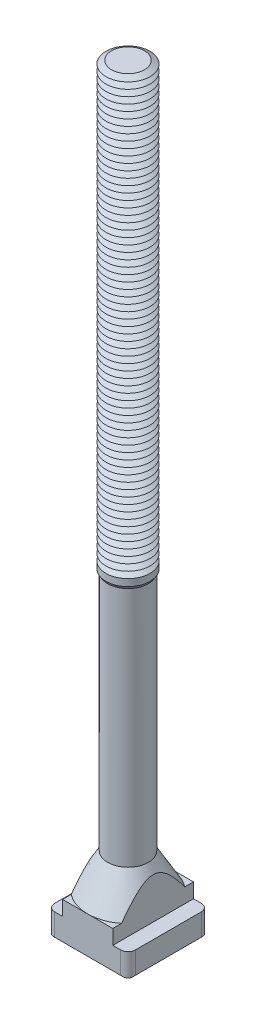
ISO-10303-21;
HEADER;
FILE_DESCRIPTION(('STEP AP214'),'2;1');
FILE_NAME('part.step','',(''),(''),'','','');
FILE_SCHEMA(('AUTOMOTIVE_DESIGN { 1 0 10303 214 1 1 1 1 }'));
ENDSEC;
DATA;
#1=APPLICATION_CONTEXT('core data for automotive mechanical design processes');
#2=APPLICATION_PROTOCOL_DEFINITION('international standard','automotive_design',2000,#1);
#3=PRODUCT_CONTEXT('',#1,'mechanical');
#4=PRODUCT('Part','Part','',(#3));
#5=PRODUCT_RELATED_PRODUCT_CATEGORY('part','',(#4));
#6=PRODUCT_DEFINITION_FORMATION('','',#4);
#7=PRODUCT_DEFINITION_CONTEXT('part definition',#1,'design');
#8=PRODUCT_DEFINITION('design','',#6,#7);
#9=PRODUCT_DEFINITION_SHAPE('','',#8);
#10=(LENGTH_UNIT() NAMED_UNIT(*) SI_UNIT(.MILLI.,.METRE.));
#11=(NAMED_UNIT(*) PLANE_ANGLE_UNIT() SI_UNIT($,.RADIAN.));
#12=(NAMED_UNIT(*) SI_UNIT($,.STERADIAN.) SOLID_ANGLE_UNIT());
#13=UNCERTAINTY_MEASURE_WITH_UNIT(LENGTH_MEASURE(1.E-05),#10,'distance_accuracy_value','');
#14=(GEOMETRIC_REPRESENTATION_CONTEXT(3) GLOBAL_UNCERTAINTY_ASSIGNED_CONTEXT((#13)) GLOBAL_UNIT_ASSIGNED_CONTEXT((#10,
#11,#12)) REPRESENTATION_CONTEXT('',''));
#15=CARTESIAN_POINT('',(0.,0.,0.));
#16=DIRECTION('',(0.,0.,1.));
#17=DIRECTION('',(1.,0.,0.));
#18=AXIS2_PLACEMENT_3D('',#15,#16,#17);
#19=CARTESIAN_POINT('',(0.,201.,0.));
#20=DIRECTION('',(0.,-1.,0.));
#21=DIRECTION('',(0.,0.,-1.));
#22=AXIS2_PLACEMENT_3D('',#19,#20,#21);
#23=CONICAL_SURFACE('',#22,4.48445554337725,1.04719755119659);
#24=CARTESIAN_POINT('',(0.,200.125,0.));
#25=DIRECTION('',(0.,-1.,0.));
#26=DIRECTION('',(0.,0.,-1.));
#27=AXIS2_PLACEMENT_3D('',#24,#25,#26);
#28=CIRCLE('',#27,6.00000000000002);
#29=CARTESIAN_POINT('',(0.,200.125,-6.00000000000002));
#30=VERTEX_POINT('',#29);
#31=EDGE_CURVE('E949',#30,#30,#28,.T.);
#32=ORIENTED_EDGE('',*,*,#31,.F.);
#33=EDGE_LOOP('',(#32));
#34=FACE_BOUND('',#33,.T.);
#35=CARTESIAN_POINT('',(0.,201.,0.));
#36=DIRECTION('',(0.,-1.,0.));
#37=DIRECTION('',(0.,0.,-1.));
#38=AXIS2_PLACEMENT_3D('',#35,#36,#37);
#39=CIRCLE('',#38,4.48445554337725);
#40=CARTESIAN_POINT('',(0.,201.,-4.48445554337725));
#41=VERTEX_POINT('',#40);
#42=EDGE_CURVE('E952',#41,#41,#39,.T.);
#43=ORIENTED_EDGE('',*,*,#42,.T.);
#44=EDGE_LOOP('',(#43));
#45=FACE_BOUND('',#44,.T.);
#46=ADVANCED_FACE('F39',(#34,#45),#23,.T.);
#47=CARTESIAN_POINT('',(0.,201.875,0.));
#48=DIRECTION('',(0.,1.,0.));
#49=DIRECTION('',(0.,0.,1.));
#50=AXIS2_PLACEMENT_3D('',#47,#48,#49);
#51=CONICAL_SURFACE('',#50,6.00000000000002,1.0471975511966);
#52=ORIENTED_EDGE('',*,*,#42,.F.);
#53=EDGE_LOOP('',(#52));
#54=FACE_BOUND('',#53,.T.);
#55=CARTESIAN_POINT('',(0.,201.875,0.));
#56=DIRECTION('',(0.,-1.,0.));
#57=DIRECTION('',(0.,0.,-1.));
#58=AXIS2_PLACEMENT_3D('',#55,#56,#57);
#59=CIRCLE('',#58,6.00000000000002);
#60=CARTESIAN_POINT('',(0.,201.875,-6.00000000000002));
#61=VERTEX_POINT('',#60);
#62=EDGE_CURVE('E1012',#61,#61,#59,.T.);
#63=ORIENTED_EDGE('',*,*,#62,.T.);
#64=EDGE_LOOP('',(#63));
#65=FACE_BOUND('',#64,.T.);
#66=ADVANCED_FACE('F448',(#54,#65),#51,.T.);
#67=CARTESIAN_POINT('',(2.99974228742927,208.,0.));
#68=DIRECTION('',(0.,-1.,0.));
#69=DIRECTION('',(1.,0.,0.));
#70=AXIS2_PLACEMENT_3D('',#67,#68,#69);
#71=PLANE('',#70);
#72=CARTESIAN_POINT('',(0.,208.,0.));
#73=DIRECTION('',(0.,-1.,0.));
#74=DIRECTION('',(0.,0.,-1.));
#75=AXIS2_PLACEMENT_3D('',#72,#73,#74);
#76=CIRCLE('',#75,4.48445554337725);
#77=CARTESIAN_POINT('',(0.,208.,-4.48445554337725));
#78=VERTEX_POINT('',#77);
#79=EDGE_CURVE('E956',#78,#78,#76,.T.);
#80=ORIENTED_EDGE('',*,*,#79,.F.);
#81=EDGE_LOOP('',(#80));
#82=FACE_BOUND('',#81,.T.);
#83=ADVANCED_FACE('F454',(#82),#71,.F.);
#84=CARTESIAN_POINT('',(0.,208.,0.));
#85=DIRECTION('',(0.,-1.,0.));
#86=DIRECTION('',(0.,0.,-1.));
#87=AXIS2_PLACEMENT_3D('',#84,#85,#86);
#88=CONICAL_SURFACE('',#87,4.48445554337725,1.04719755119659);
#89=CARTESIAN_POINT('',(0.,207.125,0.));
#90=DIRECTION('',(0.,-1.,0.));
#91=DIRECTION('',(0.,0.,-1.));
#92=AXIS2_PLACEMENT_3D('',#89,#90,#91);
#93=CIRCLE('',#92,6.00000000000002);
#94=CARTESIAN_POINT('',(0.,207.125,-6.00000000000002));
#95=VERTEX_POINT('',#94);
#96=EDGE_CURVE('E707',#95,#95,#93,.T.);
#97=ORIENTED_EDGE('',*,*,#96,.F.);
#98=EDGE_LOOP('',(#97));
#99=FACE_BOUND('',#98,.T.);
#100=ORIENTED_EDGE('',*,*,#79,.T.);
#101=EDGE_LOOP('',(#100));
#102=FACE_BOUND('',#101,.T.);
#103=ADVANCED_FACE('F482',(#99,#102),#88,.T.);
#104=CARTESIAN_POINT('',(0.,207.125,0.));
#105=DIRECTION('',(0.,1.,0.));
#106=DIRECTION('',(0.,0.,1.));
#107=AXIS2_PLACEMENT_3D('',#104,#105,#106);
#108=CONICAL_SURFACE('',#107,6.00000000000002,1.0471975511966);
#109=CARTESIAN_POINT('',(0.,206.25,0.));
#110=DIRECTION('',(0.,-1.,0.));
#111=DIRECTION('',(0.,0.,-1.));
#112=AXIS2_PLACEMENT_3D('',#109,#110,#111);
#113=CIRCLE('',#112,4.48445554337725);
#114=CARTESIAN_POINT('',(0.,206.25,-4.48445554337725));
#115=VERTEX_POINT('',#114);
#116=EDGE_CURVE('E704',#115,#115,#113,.T.);
#117=ORIENTED_EDGE('',*,*,#116,.F.);
#118=EDGE_LOOP('',(#117));
#119=FACE_BOUND('',#118,.T.);
#120=ORIENTED_EDGE('',*,*,#96,.T.);
#121=EDGE_LOOP('',(#120));
#122=FACE_BOUND('',#121,.T.);
#123=ADVANCED_FACE('F479',(#119,#122),#108,.T.);
#124=CARTESIAN_POINT('',(0.,206.25,0.));
#125=DIRECTION('',(0.,-1.,0.));
#126=DIRECTION('',(0.,0.,-1.));
#127=AXIS2_PLACEMENT_3D('',#124,#125,#126);
#128=CONICAL_SURFACE('',#127,4.48445554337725,1.04719755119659);
#129=CARTESIAN_POINT('',(0.,205.375,0.));
#130=DIRECTION('',(0.,-1.,0.));
#131=DIRECTION('',(0.,0.,-1.));
#132=AXIS2_PLACEMENT_3D('',#129,#130,#131);
#133=CIRCLE('',#132,6.00000000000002);
#134=CARTESIAN_POINT('',(0.,205.375,-6.00000000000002));
#135=VERTEX_POINT('',#134);
#136=EDGE_CURVE('E708',#135,#135,#133,.T.);
#137=ORIENTED_EDGE('',*,*,#136,.F.);
#138=EDGE_LOOP('',(#137));
#139=FACE_BOUND('',#138,.T.);
#140=ORIENTED_EDGE('',*,*,#116,.T.);
#141=EDGE_LOOP('',(#140));
#142=FACE_BOUND('',#141,.T.);
#143=ADVANCED_FACE('F474',(#139,#142),#128,.T.);
#144=CARTESIAN_POINT('',(0.,205.375,0.));
#145=DIRECTION('',(0.,1.,0.));
#146=DIRECTION('',(0.,0.,1.));
#147=AXIS2_PLACEMENT_3D('',#144,#145,#146);
#148=CONICAL_SURFACE('',#147,6.00000000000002,1.0471975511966);
#149=CARTESIAN_POINT('',(0.,204.5,0.));
#150=DIRECTION('',(0.,-1.,0.));
#151=DIRECTION('',(0.,0.,-1.));
#152=AXIS2_PLACEMENT_3D('',#149,#150,#151);
#153=CIRCLE('',#152,4.48445554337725);
#154=CARTESIAN_POINT('',(0.,204.5,-4.48445554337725));
#155=VERTEX_POINT('',#154);
#156=EDGE_CURVE('E849',#155,#155,#153,.T.);
#157=ORIENTED_EDGE('',*,*,#156,.F.);
#158=EDGE_LOOP('',(#157));
#159=FACE_BOUND('',#158,.T.);
#160=ORIENTED_EDGE('',*,*,#136,.T.);
#161=EDGE_LOOP('',(#160));
#162=FACE_BOUND('',#161,.T.);
#163=ADVANCED_FACE('F471',(#159,#162),#148,.T.);
#164=CARTESIAN_POINT('',(0.,204.5,0.));
#165=DIRECTION('',(0.,-1.,0.));
#166=DIRECTION('',(0.,0.,-1.));
#167=AXIS2_PLACEMENT_3D('',#164,#165,#166);
#168=CONICAL_SURFACE('',#167,4.48445554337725,1.04719755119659);
#169=CARTESIAN_POINT('',(0.,203.625,0.));
#170=DIRECTION('',(0.,-1.,0.));
#171=DIRECTION('',(0.,0.,-1.));
#172=AXIS2_PLACEMENT_3D('',#169,#170,#171);
#173=CIRCLE('',#172,6.00000000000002);
#174=CARTESIAN_POINT('',(0.,203.625,-6.00000000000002));
#175=VERTEX_POINT('',#174);
#176=EDGE_CURVE('E846',#175,#175,#173,.T.);
#177=ORIENTED_EDGE('',*,*,#176,.F.);
#178=EDGE_LOOP('',(#177));
#179=FACE_BOUND('',#178,.T.);
#180=ORIENTED_EDGE('',*,*,#156,.T.);
#181=EDGE_LOOP('',(#180));
#182=FACE_BOUND('',#181,.T.);
#183=ADVANCED_FACE('F465',(#179,#182),#168,.T.);
#184=CARTESIAN_POINT('',(0.,203.625,0.));
#185=DIRECTION('',(0.,1.,0.));
#186=DIRECTION('',(0.,0.,1.));
#187=AXIS2_PLACEMENT_3D('',#184,#185,#186);
#188=CONICAL_SURFACE('',#187,6.00000000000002,1.0471975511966);
#189=CARTESIAN_POINT('',(0.,202.75,0.));
#190=DIRECTION('',(0.,-1.,0.));
#191=DIRECTION('',(0.,0.,-1.));
#192=AXIS2_PLACEMENT_3D('',#189,#190,#191);
#193=CIRCLE('',#192,4.48445554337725);
#194=CARTESIAN_POINT('',(0.,202.75,-4.48445554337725));
#195=VERTEX_POINT('',#194);
#196=EDGE_CURVE('E850',#195,#195,#193,.T.);
#197=ORIENTED_EDGE('',*,*,#196,.F.);
#198=EDGE_LOOP('',(#197));
#199=FACE_BOUND('',#198,.T.);
#200=ORIENTED_EDGE('',*,*,#176,.T.);
#201=EDGE_LOOP('',(#200));
#202=FACE_BOUND('',#201,.T.);
#203=ADVANCED_FACE('F461',(#199,#202),#188,.T.);
#204=CARTESIAN_POINT('',(0.,202.75,0.));
#205=DIRECTION('',(0.,-1.,0.));
#206=DIRECTION('',(0.,0.,-1.));
#207=AXIS2_PLACEMENT_3D('',#204,#205,#206);
#208=CONICAL_SURFACE('',#207,4.48445554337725,1.04719755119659);
#209=ORIENTED_EDGE('',*,*,#62,.F.);
#210=EDGE_LOOP('',(#209));
#211=FACE_BOUND('',#210,.T.);
#212=ORIENTED_EDGE('',*,*,#196,.T.);
#213=EDGE_LOOP('',(#212));
#214=FACE_BOUND('',#213,.T.);
#215=ADVANCED_FACE('F464',(#211,#214),#208,.T.);
#216=CARTESIAN_POINT('',(0.,199.25,0.));
#217=DIRECTION('',(0.,-1.,0.));
#218=DIRECTION('',(0.,0.,-1.));
#219=AXIS2_PLACEMENT_3D('',#216,#217,#218);
#220=CONICAL_SURFACE('',#219,4.48445554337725,1.04719755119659);
#221=CARTESIAN_POINT('',(0.,198.375,0.));
#222=DIRECTION('',(0.,-1.,0.));
#223=DIRECTION('',(0.,0.,-1.));
#224=AXIS2_PLACEMENT_3D('',#221,#222,#223);
#225=CIRCLE('',#224,6.00000000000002);
#226=CARTESIAN_POINT('',(0.,198.375,-6.00000000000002));
#227=VERTEX_POINT('',#226);
#228=EDGE_CURVE('E991',#227,#227,#225,.T.);
#229=ORIENTED_EDGE('',*,*,#228,.F.);
#230=EDGE_LOOP('',(#229));
#231=FACE_BOUND('',#230,.T.);
#232=CARTESIAN_POINT('',(0.,199.25,0.));
#233=DIRECTION('',(0.,-1.,0.));
#234=DIRECTION('',(0.,0.,-1.));
#235=AXIS2_PLACEMENT_3D('',#232,#233,#234);
#236=CIRCLE('',#235,4.48445554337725);
#237=CARTESIAN_POINT('',(0.,199.25,-4.48445554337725));
#238=VERTEX_POINT('',#237);
#239=EDGE_CURVE('E953',#238,#238,#236,.T.);
#240=ORIENTED_EDGE('',*,*,#239,.T.);
#241=EDGE_LOOP('',(#240));
#242=FACE_BOUND('',#241,.T.);
#243=ADVANCED_FACE('F469',(#231,#242),#220,.T.);
#244=CARTESIAN_POINT('',(0.,200.125,0.));
#245=DIRECTION('',(0.,1.,0.));
#246=DIRECTION('',(0.,0.,1.));
#247=AXIS2_PLACEMENT_3D('',#244,#245,#246);
#248=CONICAL_SURFACE('',#247,6.00000000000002,1.0471975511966);
#249=ORIENTED_EDGE('',*,*,#239,.F.);
#250=EDGE_LOOP('',(#249));
#251=FACE_BOUND('',#250,.T.);
#252=ORIENTED_EDGE('',*,*,#31,.T.);
#253=EDGE_LOOP('',(#252));
#254=FACE_BOUND('',#253,.T.);
#255=ADVANCED_FACE('F1095',(#251,#254),#248,.T.);
#256=CARTESIAN_POINT('',(0.,197.5,0.));
#257=DIRECTION('',(0.,-1.,0.));
#258=DIRECTION('',(0.,0.,-1.));
#259=AXIS2_PLACEMENT_3D('',#256,#257,#258);
#260=CONICAL_SURFACE('',#259,4.48445554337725,1.04719755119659);
#261=CARTESIAN_POINT('',(0.,196.625,0.));
#262=DIRECTION('',(0.,-1.,0.));
#263=DIRECTION('',(0.,0.,-1.));
#264=AXIS2_PLACEMENT_3D('',#261,#262,#263);
#265=CIRCLE('',#264,6.00000000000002);
#266=CARTESIAN_POINT('',(0.,196.625,-6.00000000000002));
#267=VERTEX_POINT('',#266);
#268=EDGE_CURVE('E747',#267,#267,#265,.T.);
#269=ORIENTED_EDGE('',*,*,#268,.F.);
#270=EDGE_LOOP('',(#269));
#271=FACE_BOUND('',#270,.T.);
#272=CARTESIAN_POINT('',(0.,197.5,0.));
#273=DIRECTION('',(0.,-1.,0.));
#274=DIRECTION('',(0.,0.,-1.));
#275=AXIS2_PLACEMENT_3D('',#272,#273,#274);
#276=CIRCLE('',#275,4.48445554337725);
#277=CARTESIAN_POINT('',(0.,197.5,-4.48445554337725));
#278=VERTEX_POINT('',#277);
#279=EDGE_CURVE('E817',#278,#278,#276,.T.);
#280=ORIENTED_EDGE('',*,*,#279,.T.);
#281=EDGE_LOOP('',(#280));
#282=FACE_BOUND('',#281,.T.);
#283=ADVANCED_FACE('F1098',(#271,#282),#260,.T.);
#284=CARTESIAN_POINT('',(0.,198.375,0.));
#285=DIRECTION('',(0.,1.,0.));
#286=DIRECTION('',(0.,0.,1.));
#287=AXIS2_PLACEMENT_3D('',#284,#285,#286);
#288=CONICAL_SURFACE('',#287,6.00000000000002,1.0471975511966);
#289=ORIENTED_EDGE('',*,*,#279,.F.);
#290=EDGE_LOOP('',(#289));
#291=FACE_BOUND('',#290,.T.);
#292=ORIENTED_EDGE('',*,*,#228,.T.);
#293=EDGE_LOOP('',(#292));
#294=FACE_BOUND('',#293,.T.);
#295=ADVANCED_FACE('F1104',(#291,#294),#288,.T.);
#296=CARTESIAN_POINT('',(0.,195.75,0.));
#297=DIRECTION('',(0.,-1.,0.));
#298=DIRECTION('',(0.,0.,-1.));
#299=AXIS2_PLACEMENT_3D('',#296,#297,#298);
#300=CONICAL_SURFACE('',#299,4.48445554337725,1.04719755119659);
#301=CARTESIAN_POINT('',(0.,194.875,0.));
#302=DIRECTION('',(0.,-1.,0.));
#303=DIRECTION('',(0.,0.,-1.));
#304=AXIS2_PLACEMENT_3D('',#301,#302,#303);
#305=CIRCLE('',#304,6.00000000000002);
#306=CARTESIAN_POINT('',(0.,194.875,-6.00000000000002));
#307=VERTEX_POINT('',#306);
#308=EDGE_CURVE('E748',#307,#307,#305,.T.);
#309=ORIENTED_EDGE('',*,*,#308,.F.);
#310=EDGE_LOOP('',(#309));
#311=FACE_BOUND('',#310,.T.);
#312=CARTESIAN_POINT('',(0.,195.75,0.));
#313=DIRECTION('',(0.,-1.,0.));
#314=DIRECTION('',(0.,0.,-1.));
#315=AXIS2_PLACEMENT_3D('',#312,#313,#314);
#316=CIRCLE('',#315,4.48445554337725);
#317=CARTESIAN_POINT('',(0.,195.75,-4.48445554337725));
#318=VERTEX_POINT('',#317);
#319=EDGE_CURVE('E745',#318,#318,#316,.T.);
#320=ORIENTED_EDGE('',*,*,#319,.T.);
#321=EDGE_LOOP('',(#320));
#322=FACE_BOUND('',#321,.T.);
#323=ADVANCED_FACE('F1111',(#311,#322),#300,.T.);
#324=CARTESIAN_POINT('',(0.,196.625,0.));
#325=DIRECTION('',(0.,1.,0.));
#326=DIRECTION('',(0.,0.,1.));
#327=AXIS2_PLACEMENT_3D('',#324,#325,#326);
#328=CONICAL_SURFACE('',#327,6.00000000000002,1.0471975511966);
#329=ORIENTED_EDGE('',*,*,#319,.F.);
#330=EDGE_LOOP('',(#329));
#331=FACE_BOUND('',#330,.T.);
#332=ORIENTED_EDGE('',*,*,#268,.T.);
#333=EDGE_LOOP('',(#332));
#334=FACE_BOUND('',#333,.T.);
#335=ADVANCED_FACE('F1115',(#331,#334),#328,.T.);
#336=CARTESIAN_POINT('',(0.,194.,0.));
#337=DIRECTION('',(0.,-1.,0.));
#338=DIRECTION('',(0.,0.,-1.));
#339=AXIS2_PLACEMENT_3D('',#336,#337,#338);
#340=CONICAL_SURFACE('',#339,4.48445554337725,1.04719755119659);
#341=CARTESIAN_POINT('',(0.,193.125,0.));
#342=DIRECTION('',(0.,-1.,0.));
#343=DIRECTION('',(0.,0.,-1.));
#344=AXIS2_PLACEMENT_3D('',#341,#342,#343);
#345=CIRCLE('',#344,6.00000000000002);
#346=CARTESIAN_POINT('',(0.,193.125,-6.00000000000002));
#347=VERTEX_POINT('',#346);
#348=EDGE_CURVE('E843',#347,#347,#345,.T.);
#349=ORIENTED_EDGE('',*,*,#348,.F.);
#350=EDGE_LOOP('',(#349));
#351=FACE_BOUND('',#350,.T.);
#352=CARTESIAN_POINT('',(0.,194.,0.));
#353=DIRECTION('',(0.,-1.,0.));
#354=DIRECTION('',(0.,0.,-1.));
#355=AXIS2_PLACEMENT_3D('',#352,#353,#354);
#356=CIRCLE('',#355,4.48445554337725);
#357=CARTESIAN_POINT('',(0.,194.,-4.48445554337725));
#358=VERTEX_POINT('',#357);
#359=EDGE_CURVE('E921',#358,#358,#356,.T.);
#360=ORIENTED_EDGE('',*,*,#359,.T.);
#361=EDGE_LOOP('',(#360));
#362=FACE_BOUND('',#361,.T.);
#363=ADVANCED_FACE('F1119',(#351,#362),#340,.T.);
#364=CARTESIAN_POINT('',(0.,194.875,0.));
#365=DIRECTION('',(0.,1.,0.));
#366=DIRECTION('',(0.,0.,1.));
#367=AXIS2_PLACEMENT_3D('',#364,#365,#366);
#368=CONICAL_SURFACE('',#367,6.00000000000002,1.0471975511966);
#369=ORIENTED_EDGE('',*,*,#359,.F.);
#370=EDGE_LOOP('',(#369));
#371=FACE_BOUND('',#370,.T.);
#372=ORIENTED_EDGE('',*,*,#308,.T.);
#373=EDGE_LOOP('',(#372));
#374=FACE_BOUND('',#373,.T.);
#375=ADVANCED_FACE('F1123',(#371,#374),#368,.T.);
#376=CARTESIAN_POINT('',(0.,192.25,0.));
#377=DIRECTION('',(0.,-1.,0.));
#378=DIRECTION('',(0.,0.,-1.));
#379=AXIS2_PLACEMENT_3D('',#376,#377,#378);
#380=CONICAL_SURFACE('',#379,4.48445554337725,1.04719755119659);
#381=CARTESIAN_POINT('',(0.,191.375,0.));
#382=DIRECTION('',(0.,-1.,0.));
#383=DIRECTION('',(0.,0.,-1.));
#384=AXIS2_PLACEMENT_3D('',#381,#382,#383);
#385=CIRCLE('',#384,6.00000000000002);
#386=CARTESIAN_POINT('',(0.,191.375,-6.00000000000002));
#387=VERTEX_POINT('',#386);
#388=EDGE_CURVE('E844',#387,#387,#385,.T.);
#389=ORIENTED_EDGE('',*,*,#388,.F.);
#390=EDGE_LOOP('',(#389));
#391=FACE_BOUND('',#390,.T.);
#392=CARTESIAN_POINT('',(0.,192.25,0.));
#393=DIRECTION('',(0.,-1.,0.));
#394=DIRECTION('',(0.,0.,-1.));
#395=AXIS2_PLACEMENT_3D('',#392,#393,#394);
#396=CIRCLE('',#395,4.48445554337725);
#397=CARTESIAN_POINT('',(0.,192.25,-4.48445554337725));
#398=VERTEX_POINT('',#397);
#399=EDGE_CURVE('E840',#398,#398,#396,.T.);
#400=ORIENTED_EDGE('',*,*,#399,.T.);
#401=EDGE_LOOP('',(#400));
#402=FACE_BOUND('',#401,.T.);
#403=ADVANCED_FACE('F1127',(#391,#402),#380,.T.);
#404=CARTESIAN_POINT('',(0.,193.125,0.));
#405=DIRECTION('',(0.,1.,0.));
#406=DIRECTION('',(0.,0.,1.));
#407=AXIS2_PLACEMENT_3D('',#404,#405,#406);
#408=CONICAL_SURFACE('',#407,6.00000000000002,1.0471975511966);
#409=ORIENTED_EDGE('',*,*,#399,.F.);
#410=EDGE_LOOP('',(#409));
#411=FACE_BOUND('',#410,.T.);
#412=ORIENTED_EDGE('',*,*,#348,.T.);
#413=EDGE_LOOP('',(#412));
#414=FACE_BOUND('',#413,.T.);
#415=ADVANCED_FACE('F1131',(#411,#414),#408,.T.);
#416=CARTESIAN_POINT('',(0.,190.5,0.));
#417=DIRECTION('',(0.,-1.,0.));
#418=DIRECTION('',(0.,0.,-1.));
#419=AXIS2_PLACEMENT_3D('',#416,#417,#418);
#420=CONICAL_SURFACE('',#419,4.48445554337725,1.04719755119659);
#421=CARTESIAN_POINT('',(0.,189.625,0.));
#422=DIRECTION('',(0.,-1.,0.));
#423=DIRECTION('',(0.,0.,-1.));
#424=AXIS2_PLACEMENT_3D('',#421,#422,#423);
#425=CIRCLE('',#424,6.00000000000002);
#426=CARTESIAN_POINT('',(0.,189.625,-6.00000000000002));
#427=VERTEX_POINT('',#426);
#428=EDGE_CURVE('E810',#427,#427,#425,.T.);
#429=ORIENTED_EDGE('',*,*,#428,.F.);
#430=EDGE_LOOP('',(#429));
#431=FACE_BOUND('',#430,.T.);
#432=CARTESIAN_POINT('',(0.,190.5,0.));
#433=DIRECTION('',(0.,-1.,0.));
#434=DIRECTION('',(0.,0.,-1.));
#435=AXIS2_PLACEMENT_3D('',#432,#433,#434);
#436=CIRCLE('',#435,4.48445554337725);
#437=CARTESIAN_POINT('',(0.,190.5,-4.48445554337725));
#438=VERTEX_POINT('',#437);
#439=EDGE_CURVE('E813',#438,#438,#436,.T.);
#440=ORIENTED_EDGE('',*,*,#439,.T.);
#441=EDGE_LOOP('',(#440));
#442=FACE_BOUND('',#441,.T.);
#443=ADVANCED_FACE('F1135',(#431,#442),#420,.T.);
#444=CARTESIAN_POINT('',(0.,191.375,0.));
#445=DIRECTION('',(0.,1.,0.));
#446=DIRECTION('',(0.,0.,1.));
#447=AXIS2_PLACEMENT_3D('',#444,#445,#446);
#448=CONICAL_SURFACE('',#447,6.00000000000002,1.0471975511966);
#449=ORIENTED_EDGE('',*,*,#439,.F.);
#450=EDGE_LOOP('',(#449));
#451=FACE_BOUND('',#450,.T.);
#452=ORIENTED_EDGE('',*,*,#388,.T.);
#453=EDGE_LOOP('',(#452));
#454=FACE_BOUND('',#453,.T.);
#455=ADVANCED_FACE('F1139',(#451,#454),#448,.T.);
#456=CARTESIAN_POINT('',(0.,188.75,0.));
#457=DIRECTION('',(0.,-1.,0.));
#458=DIRECTION('',(0.,0.,-1.));
#459=AXIS2_PLACEMENT_3D('',#456,#457,#458);
#460=CONICAL_SURFACE('',#459,4.48445554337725,1.04719755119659);
#461=CARTESIAN_POINT('',(0.,187.875,0.));
#462=DIRECTION('',(0.,-1.,0.));
#463=DIRECTION('',(0.,0.,-1.));
#464=AXIS2_PLACEMENT_3D('',#461,#462,#463);
#465=CIRCLE('',#464,6.00000000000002);
#466=CARTESIAN_POINT('',(0.,187.875,-6.00000000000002));
#467=VERTEX_POINT('',#466);
#468=EDGE_CURVE('E918',#467,#467,#465,.T.);
#469=ORIENTED_EDGE('',*,*,#468,.F.);
#470=EDGE_LOOP('',(#469));
#471=FACE_BOUND('',#470,.T.);
#472=CARTESIAN_POINT('',(0.,188.75,0.));
#473=DIRECTION('',(0.,-1.,0.));
#474=DIRECTION('',(0.,0.,-1.));
#475=AXIS2_PLACEMENT_3D('',#472,#473,#474);
#476=CIRCLE('',#475,4.48445554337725);
#477=CARTESIAN_POINT('',(0.,188.75,-4.48445554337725));
#478=VERTEX_POINT('',#477);
#479=EDGE_CURVE('E814',#478,#478,#476,.T.);
#480=ORIENTED_EDGE('',*,*,#479,.T.);
#481=EDGE_LOOP('',(#480));
#482=FACE_BOUND('',#481,.T.);
#483=ADVANCED_FACE('F1143',(#471,#482),#460,.T.);
#484=CARTESIAN_POINT('',(0.,189.625,0.));
#485=DIRECTION('',(0.,1.,0.));
#486=DIRECTION('',(0.,0.,1.));
#487=AXIS2_PLACEMENT_3D('',#484,#485,#486);
#488=CONICAL_SURFACE('',#487,6.00000000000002,1.0471975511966);
#489=ORIENTED_EDGE('',*,*,#479,.F.);
#490=EDGE_LOOP('',(#489));
#491=FACE_BOUND('',#490,.T.);
#492=ORIENTED_EDGE('',*,*,#428,.T.);
#493=EDGE_LOOP('',(#492));
#494=FACE_BOUND('',#493,.T.);
#495=ADVANCED_FACE('F1147',(#491,#494),#488,.T.);
#496=CARTESIAN_POINT('',(0.,187.,0.));
#497=DIRECTION('',(0.,-1.,0.));
#498=DIRECTION('',(0.,0.,-1.));
#499=AXIS2_PLACEMENT_3D('',#496,#497,#498);
#500=CONICAL_SURFACE('',#499,4.48445554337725,1.04719755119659);
#501=CARTESIAN_POINT('',(0.,186.125,0.));
#502=DIRECTION('',(0.,-1.,0.));
#503=DIRECTION('',(0.,0.,-1.));
#504=AXIS2_PLACEMENT_3D('',#501,#502,#503);
#505=CIRCLE('',#504,6.00000000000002);
#506=CARTESIAN_POINT('',(0.,186.125,-6.00000000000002));
#507=VERTEX_POINT('',#506);
#508=EDGE_CURVE('E1073',#507,#507,#505,.T.);
#509=ORIENTED_EDGE('',*,*,#508,.F.);
#510=EDGE_LOOP('',(#509));
#511=FACE_BOUND('',#510,.T.);
#512=CARTESIAN_POINT('',(0.,187.,0.));
#513=DIRECTION('',(0.,-1.,0.));
#514=DIRECTION('',(0.,0.,-1.));
#515=AXIS2_PLACEMENT_3D('',#512,#513,#514);
#516=CIRCLE('',#515,4.48445554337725);
#517=CARTESIAN_POINT('',(0.,187.,-4.48445554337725));
#518=VERTEX_POINT('',#517);
#519=EDGE_CURVE('E1070',#518,#518,#516,.T.);
#520=ORIENTED_EDGE('',*,*,#519,.T.);
#521=EDGE_LOOP('',(#520));
#522=FACE_BOUND('',#521,.T.);
#523=ADVANCED_FACE('F1151',(#511,#522),#500,.T.);
#524=CARTESIAN_POINT('',(0.,187.875,0.));
#525=DIRECTION('',(0.,1.,0.));
#526=DIRECTION('',(0.,0.,1.));
#527=AXIS2_PLACEMENT_3D('',#524,#525,#526);
#528=CONICAL_SURFACE('',#527,6.00000000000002,1.0471975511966);
#529=ORIENTED_EDGE('',*,*,#519,.F.);
#530=EDGE_LOOP('',(#529));
#531=FACE_BOUND('',#530,.T.);
#532=ORIENTED_EDGE('',*,*,#468,.T.);
#533=EDGE_LOOP('',(#532));
#534=FACE_BOUND('',#533,.T.);
#535=ADVANCED_FACE('F1155',(#531,#534),#528,.T.);
#536=CARTESIAN_POINT('',(0.,185.25,0.));
#537=DIRECTION('',(0.,-1.,0.));
#538=DIRECTION('',(0.,0.,-1.));
#539=AXIS2_PLACEMENT_3D('',#536,#537,#538);
#540=CONICAL_SURFACE('',#539,4.48445554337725,1.04719755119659);
#541=CARTESIAN_POINT('',(0.,184.375,0.));
#542=DIRECTION('',(0.,-1.,0.));
#543=DIRECTION('',(0.,0.,-1.));
#544=AXIS2_PLACEMENT_3D('',#541,#542,#543);
#545=CIRCLE('',#544,6.00000000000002);
#546=CARTESIAN_POINT('',(0.,184.375,-6.00000000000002));
#547=VERTEX_POINT('',#546);
#548=EDGE_CURVE('E944',#547,#547,#545,.T.);
#549=ORIENTED_EDGE('',*,*,#548,.F.);
#550=EDGE_LOOP('',(#549));
#551=FACE_BOUND('',#550,.T.);
#552=CARTESIAN_POINT('',(0.,185.25,0.));
#553=DIRECTION('',(0.,-1.,0.));
#554=DIRECTION('',(0.,0.,-1.));
#555=AXIS2_PLACEMENT_3D('',#552,#553,#554);
#556=CIRCLE('',#555,4.48445554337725);
#557=CARTESIAN_POINT('',(0.,185.25,-4.48445554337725));
#558=VERTEX_POINT('',#557);
#559=EDGE_CURVE('E947',#558,#558,#556,.T.);
#560=ORIENTED_EDGE('',*,*,#559,.T.);
#561=EDGE_LOOP('',(#560));
#562=FACE_BOUND('',#561,.T.);
#563=ADVANCED_FACE('F1159',(#551,#562),#540,.T.);
#564=CARTESIAN_POINT('',(0.,186.125,0.));
#565=DIRECTION('',(0.,1.,0.));
#566=DIRECTION('',(0.,0.,1.));
#567=AXIS2_PLACEMENT_3D('',#564,#565,#566);
#568=CONICAL_SURFACE('',#567,6.00000000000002,1.0471975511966);
#569=ORIENTED_EDGE('',*,*,#559,.F.);
#570=EDGE_LOOP('',(#569));
#571=FACE_BOUND('',#570,.T.);
#572=ORIENTED_EDGE('',*,*,#508,.T.);
#573=EDGE_LOOP('',(#572));
#574=FACE_BOUND('',#573,.T.);
#575=ADVANCED_FACE('F1163',(#571,#574),#568,.T.);
#576=CARTESIAN_POINT('',(0.,183.5,0.));
#577=DIRECTION('',(0.,-1.,0.));
#578=DIRECTION('',(0.,0.,-1.));
#579=AXIS2_PLACEMENT_3D('',#576,#577,#578);
#580=CONICAL_SURFACE('',#579,4.48445554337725,1.04719755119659);
#581=CARTESIAN_POINT('',(0.,182.625,0.));
#582=DIRECTION('',(0.,-1.,0.));
#583=DIRECTION('',(0.,0.,-1.));
#584=AXIS2_PLACEMENT_3D('',#581,#582,#583);
#585=CIRCLE('',#584,6.00000000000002);
#586=CARTESIAN_POINT('',(0.,182.625,-6.00000000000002));
#587=VERTEX_POINT('',#586);
#588=EDGE_CURVE('E699',#587,#587,#585,.T.);
#589=ORIENTED_EDGE('',*,*,#588,.F.);
#590=EDGE_LOOP('',(#589));
#591=FACE_BOUND('',#590,.T.);
#592=CARTESIAN_POINT('',(0.,183.5,0.));
#593=DIRECTION('',(0.,-1.,0.));
#594=DIRECTION('',(0.,0.,-1.));
#595=AXIS2_PLACEMENT_3D('',#592,#593,#594);
#596=CIRCLE('',#595,4.48445554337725);
#597=CARTESIAN_POINT('',(0.,183.5,-4.48445554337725));
#598=VERTEX_POINT('',#597);
#599=EDGE_CURVE('E702',#598,#598,#596,.T.);
#600=ORIENTED_EDGE('',*,*,#599,.T.);
#601=EDGE_LOOP('',(#600));
#602=FACE_BOUND('',#601,.T.);
#603=ADVANCED_FACE('F1167',(#591,#602),#580,.T.);
#604=CARTESIAN_POINT('',(0.,184.375,0.));
#605=DIRECTION('',(0.,1.,0.));
#606=DIRECTION('',(0.,0.,1.));
#607=AXIS2_PLACEMENT_3D('',#604,#605,#606);
#608=CONICAL_SURFACE('',#607,6.00000000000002,1.0471975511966);
#609=ORIENTED_EDGE('',*,*,#599,.F.);
#610=EDGE_LOOP('',(#609));
#611=FACE_BOUND('',#610,.T.);
#612=ORIENTED_EDGE('',*,*,#548,.T.);
#613=EDGE_LOOP('',(#612));
#614=FACE_BOUND('',#613,.T.);
#615=ADVANCED_FACE('F1171',(#611,#614),#608,.T.);
#616=CARTESIAN_POINT('',(0.,181.75,0.));
#617=DIRECTION('',(0.,-1.,0.));
#618=DIRECTION('',(0.,0.,-1.));
#619=AXIS2_PLACEMENT_3D('',#616,#617,#618);
#620=CONICAL_SURFACE('',#619,4.48445554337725,1.04719755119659);
#621=CARTESIAN_POINT('',(0.,180.875,0.));
#622=DIRECTION('',(0.,-1.,0.));
#623=DIRECTION('',(0.,0.,-1.));
#624=AXIS2_PLACEMENT_3D('',#621,#622,#623);
#625=CIRCLE('',#624,6.00000000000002);
#626=CARTESIAN_POINT('',(0.,180.875,-6.00000000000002));
#627=VERTEX_POINT('',#626);
#628=EDGE_CURVE('E692',#627,#627,#625,.T.);
#629=ORIENTED_EDGE('',*,*,#628,.F.);
#630=EDGE_LOOP('',(#629));
#631=FACE_BOUND('',#630,.T.);
#632=CARTESIAN_POINT('',(0.,181.75,0.));
#633=DIRECTION('',(0.,-1.,0.));
#634=DIRECTION('',(0.,0.,-1.));
#635=AXIS2_PLACEMENT_3D('',#632,#633,#634);
#636=CIRCLE('',#635,4.48445554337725);
#637=CARTESIAN_POINT('',(0.,181.75,-4.48445554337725));
#638=VERTEX_POINT('',#637);
#639=EDGE_CURVE('E697',#638,#638,#636,.T.);
#640=ORIENTED_EDGE('',*,*,#639,.T.);
#641=EDGE_LOOP('',(#640));
#642=FACE_BOUND('',#641,.T.);
#643=ADVANCED_FACE('F1175',(#631,#642),#620,.T.);
#644=CARTESIAN_POINT('',(0.,182.625,0.));
#645=DIRECTION('',(0.,1.,0.));
#646=DIRECTION('',(0.,0.,1.));
#647=AXIS2_PLACEMENT_3D('',#644,#645,#646);
#648=CONICAL_SURFACE('',#647,6.00000000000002,1.0471975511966);
#649=ORIENTED_EDGE('',*,*,#639,.F.);
#650=EDGE_LOOP('',(#649));
#651=FACE_BOUND('',#650,.T.);
#652=ORIENTED_EDGE('',*,*,#588,.T.);
#653=EDGE_LOOP('',(#652));
#654=FACE_BOUND('',#653,.T.);
#655=ADVANCED_FACE('F1179',(#651,#654),#648,.T.);
#656=CARTESIAN_POINT('',(0.,180.,0.));
#657=DIRECTION('',(0.,-1.,0.));
#658=DIRECTION('',(0.,0.,-1.));
#659=AXIS2_PLACEMENT_3D('',#656,#657,#658);
#660=CONICAL_SURFACE('',#659,4.48445554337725,1.04719755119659);
#661=CARTESIAN_POINT('',(0.,179.125,0.));
#662=DIRECTION('',(0.,-1.,0.));
#663=DIRECTION('',(0.,0.,-1.));
#664=AXIS2_PLACEMENT_3D('',#661,#662,#663);
#665=CIRCLE('',#664,6.00000000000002);
#666=CARTESIAN_POINT('',(0.,179.125,-6.00000000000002));
#667=VERTEX_POINT('',#666);
#668=EDGE_CURVE('E693',#667,#667,#665,.T.);
#669=ORIENTED_EDGE('',*,*,#668,.F.);
#670=EDGE_LOOP('',(#669));
#671=FACE_BOUND('',#670,.T.);
#672=CARTESIAN_POINT('',(0.,180.,0.));
#673=DIRECTION('',(0.,-1.,0.));
#674=DIRECTION('',(0.,0.,-1.));
#675=AXIS2_PLACEMENT_3D('',#672,#673,#674);
#676=CIRCLE('',#675,4.48445554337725);
#677=CARTESIAN_POINT('',(0.,180.,-4.48445554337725));
#678=VERTEX_POINT('',#677);
#679=EDGE_CURVE('E689',#678,#678,#676,.T.);
#680=ORIENTED_EDGE('',*,*,#679,.T.);
#681=EDGE_LOOP('',(#680));
#682=FACE_BOUND('',#681,.T.);
#683=ADVANCED_FACE('F1183',(#671,#682),#660,.T.);
#684=CARTESIAN_POINT('',(0.,180.875,0.));
#685=DIRECTION('',(0.,1.,0.));
#686=DIRECTION('',(0.,0.,1.));
#687=AXIS2_PLACEMENT_3D('',#684,#685,#686);
#688=CONICAL_SURFACE('',#687,6.00000000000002,1.0471975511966);
#689=ORIENTED_EDGE('',*,*,#679,.F.);
#690=EDGE_LOOP('',(#689));
#691=FACE_BOUND('',#690,.T.);
#692=ORIENTED_EDGE('',*,*,#628,.T.);
#693=EDGE_LOOP('',(#692));
#694=FACE_BOUND('',#693,.T.);
#695=ADVANCED_FACE('F1187',(#691,#694),#688,.T.);
#696=CARTESIAN_POINT('',(0.,178.25,0.));
#697=DIRECTION('',(0.,-1.,0.));
#698=DIRECTION('',(0.,0.,-1.));
#699=AXIS2_PLACEMENT_3D('',#696,#697,#698);
#700=CONICAL_SURFACE('',#699,4.48445554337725,1.04719755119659);
#701=CARTESIAN_POINT('',(0.,177.375,0.));
#702=DIRECTION('',(0.,-1.,0.));
#703=DIRECTION('',(0.,0.,-1.));
#704=AXIS2_PLACEMENT_3D('',#701,#702,#703);
#705=CIRCLE('',#704,6.00000000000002);
#706=CARTESIAN_POINT('',(0.,177.375,-6.00000000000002));
#707=VERTEX_POINT('',#706);
#708=EDGE_CURVE('E808',#707,#707,#705,.T.);
#709=ORIENTED_EDGE('',*,*,#708,.F.);
#710=EDGE_LOOP('',(#709));
#711=FACE_BOUND('',#710,.T.);
#712=CARTESIAN_POINT('',(0.,178.25,0.));
#713=DIRECTION('',(0.,-1.,0.));
#714=DIRECTION('',(0.,0.,-1.));
#715=AXIS2_PLACEMENT_3D('',#712,#713,#714);
#716=CIRCLE('',#715,4.48445554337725);
#717=CARTESIAN_POINT('',(0.,178.25,-4.48445554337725));
#718=VERTEX_POINT('',#717);
#719=EDGE_CURVE('E805',#718,#718,#716,.T.);
#720=ORIENTED_EDGE('',*,*,#719,.T.);
#721=EDGE_LOOP('',(#720));
#722=FACE_BOUND('',#721,.T.);
#723=ADVANCED_FACE('F1191',(#711,#722),#700,.T.);
#724=CARTESIAN_POINT('',(0.,179.125,0.));
#725=DIRECTION('',(0.,1.,0.));
#726=DIRECTION('',(0.,0.,1.));
#727=AXIS2_PLACEMENT_3D('',#724,#725,#726);
#728=CONICAL_SURFACE('',#727,6.00000000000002,1.0471975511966);
#729=ORIENTED_EDGE('',*,*,#719,.F.);
#730=EDGE_LOOP('',(#729));
#731=FACE_BOUND('',#730,.T.);
#732=ORIENTED_EDGE('',*,*,#668,.T.);
#733=EDGE_LOOP('',(#732));
#734=FACE_BOUND('',#733,.T.);
#735=ADVANCED_FACE('F1195',(#731,#734),#728,.T.);
#736=CARTESIAN_POINT('',(0.,176.5,0.));
#737=DIRECTION('',(0.,-1.,0.));
#738=DIRECTION('',(0.,0.,-1.));
#739=AXIS2_PLACEMENT_3D('',#736,#737,#738);
#740=CONICAL_SURFACE('',#739,4.48445554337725,1.04719755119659);
#741=CARTESIAN_POINT('',(0.,175.625,0.));
#742=DIRECTION('',(0.,-1.,0.));
#743=DIRECTION('',(0.,0.,-1.));
#744=AXIS2_PLACEMENT_3D('',#741,#742,#743);
#745=CIRCLE('',#744,6.00000000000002);
#746=CARTESIAN_POINT('',(0.,175.625,-6.00000000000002));
#747=VERTEX_POINT('',#746);
#748=EDGE_CURVE('E914',#747,#747,#745,.T.);
#749=ORIENTED_EDGE('',*,*,#748,.F.);
#750=EDGE_LOOP('',(#749));
#751=FACE_BOUND('',#750,.T.);
#752=CARTESIAN_POINT('',(0.,176.5,0.));
#753=DIRECTION('',(0.,-1.,0.));
#754=DIRECTION('',(0.,0.,-1.));
#755=AXIS2_PLACEMENT_3D('',#752,#753,#754);
#756=CIRCLE('',#755,4.48445554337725);
#757=CARTESIAN_POINT('',(0.,176.5,-4.48445554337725));
#758=VERTEX_POINT('',#757);
#759=EDGE_CURVE('E988',#758,#758,#756,.T.);
#760=ORIENTED_EDGE('',*,*,#759,.T.);
#761=EDGE_LOOP('',(#760));
#762=FACE_BOUND('',#761,.T.);
#763=ADVANCED_FACE('F1199',(#751,#762),#740,.T.);
#764=CARTESIAN_POINT('',(0.,177.375,0.));
#765=DIRECTION('',(0.,1.,0.));
#766=DIRECTION('',(0.,0.,1.));
#767=AXIS2_PLACEMENT_3D('',#764,#765,#766);
#768=CONICAL_SURFACE('',#767,6.00000000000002,1.0471975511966);
#769=ORIENTED_EDGE('',*,*,#759,.F.);
#770=EDGE_LOOP('',(#769));
#771=FACE_BOUND('',#770,.T.);
#772=ORIENTED_EDGE('',*,*,#708,.T.);
#773=EDGE_LOOP('',(#772));
#774=FACE_BOUND('',#773,.T.);
#775=ADVANCED_FACE('F1203',(#771,#774),#768,.T.);
#776=CARTESIAN_POINT('',(0.,174.75,0.));
#777=DIRECTION('',(0.,-1.,0.));
#778=DIRECTION('',(0.,0.,-1.));
#779=AXIS2_PLACEMENT_3D('',#776,#777,#778);
#780=CONICAL_SURFACE('',#779,4.48445554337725,1.04719755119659);
#781=CARTESIAN_POINT('',(0.,173.875,0.));
#782=DIRECTION('',(0.,-1.,0.));
#783=DIRECTION('',(0.,0.,-1.));
#784=AXIS2_PLACEMENT_3D('',#781,#782,#783);
#785=CIRCLE('',#784,6.00000000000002);
#786=CARTESIAN_POINT('',(0.,173.875,-6.00000000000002));
#787=VERTEX_POINT('',#786);
#788=EDGE_CURVE('E739',#787,#787,#785,.T.);
#789=ORIENTED_EDGE('',*,*,#788,.F.);
#790=EDGE_LOOP('',(#789));
#791=FACE_BOUND('',#790,.T.);
#792=CARTESIAN_POINT('',(0.,174.75,0.));
#793=DIRECTION('',(0.,-1.,0.));
#794=DIRECTION('',(0.,0.,-1.));
#795=AXIS2_PLACEMENT_3D('',#792,#793,#794);
#796=CIRCLE('',#795,4.48445554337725);
#797=CARTESIAN_POINT('',(0.,174.75,-4.48445554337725));
#798=VERTEX_POINT('',#797);
#799=EDGE_CURVE('E742',#798,#798,#796,.T.);
#800=ORIENTED_EDGE('',*,*,#799,.T.);
#801=EDGE_LOOP('',(#800));
#802=FACE_BOUND('',#801,.T.);
#803=ADVANCED_FACE('F1207',(#791,#802),#780,.T.);
#804=CARTESIAN_POINT('',(0.,175.625,0.));
#805=DIRECTION('',(0.,1.,0.));
#806=DIRECTION('',(0.,0.,1.));
#807=AXIS2_PLACEMENT_3D('',#804,#805,#806);
#808=CONICAL_SURFACE('',#807,6.00000000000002,1.0471975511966);
#809=ORIENTED_EDGE('',*,*,#799,.F.);
#810=EDGE_LOOP('',(#809));
#811=FACE_BOUND('',#810,.T.);
#812=ORIENTED_EDGE('',*,*,#748,.T.);
#813=EDGE_LOOP('',(#812));
#814=FACE_BOUND('',#813,.T.);
#815=ADVANCED_FACE('F1211',(#811,#814),#808,.T.);
#816=CARTESIAN_POINT('',(0.,173.,0.));
#817=DIRECTION('',(0.,-1.,0.));
#818=DIRECTION('',(0.,0.,-1.));
#819=AXIS2_PLACEMENT_3D('',#816,#817,#818);
#820=CONICAL_SURFACE('',#819,4.48445554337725,1.04719755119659);
#821=CARTESIAN_POINT('',(0.,172.125,0.));
#822=DIRECTION('',(0.,-1.,0.));
#823=DIRECTION('',(0.,0.,-1.));
#824=AXIS2_PLACEMENT_3D('',#821,#822,#823);
#825=CIRCLE('',#824,6.00000000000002);
#826=CARTESIAN_POINT('',(0.,172.125,-6.00000000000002));
#827=VERTEX_POINT('',#826);
#828=EDGE_CURVE('E871',#827,#827,#825,.T.);
#829=ORIENTED_EDGE('',*,*,#828,.F.);
#830=EDGE_LOOP('',(#829));
#831=FACE_BOUND('',#830,.T.);
#832=CARTESIAN_POINT('',(0.,173.,0.));
#833=DIRECTION('',(0.,-1.,0.));
#834=DIRECTION('',(0.,0.,-1.));
#835=AXIS2_PLACEMENT_3D('',#832,#833,#834);
#836=CIRCLE('',#835,4.48445554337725);
#837=CARTESIAN_POINT('',(0.,173.,-4.48445554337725));
#838=VERTEX_POINT('',#837);
#839=EDGE_CURVE('E743',#838,#838,#836,.T.);
#840=ORIENTED_EDGE('',*,*,#839,.T.);
#841=EDGE_LOOP('',(#840));
#842=FACE_BOUND('',#841,.T.);
#843=ADVANCED_FACE('F1215',(#831,#842),#820,.T.);
#844=CARTESIAN_POINT('',(0.,173.875,0.));
#845=DIRECTION('',(0.,1.,0.));
#846=DIRECTION('',(0.,0.,1.));
#847=AXIS2_PLACEMENT_3D('',#844,#845,#846);
#848=CONICAL_SURFACE('',#847,6.00000000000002,1.0471975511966);
#849=ORIENTED_EDGE('',*,*,#839,.F.);
#850=EDGE_LOOP('',(#849));
#851=FACE_BOUND('',#850,.T.);
#852=ORIENTED_EDGE('',*,*,#788,.T.);
#853=EDGE_LOOP('',(#852));
#854=FACE_BOUND('',#853,.T.);
#855=ADVANCED_FACE('F1219',(#851,#854),#848,.T.);
#856=CARTESIAN_POINT('',(0.,171.25,0.));
#857=DIRECTION('',(0.,-1.,0.));
#858=DIRECTION('',(0.,0.,-1.));
#859=AXIS2_PLACEMENT_3D('',#856,#857,#858);
#860=CONICAL_SURFACE('',#859,4.48445554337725,1.04719755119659);
#861=CARTESIAN_POINT('',(0.,170.375,0.));
#862=DIRECTION('',(0.,-1.,0.));
#863=DIRECTION('',(0.,0.,-1.));
#864=AXIS2_PLACEMENT_3D('',#861,#862,#863);
#865=CIRCLE('',#864,6.00000000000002);
#866=CARTESIAN_POINT('',(0.,170.375,-6.00000000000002));
#867=VERTEX_POINT('',#866);
#868=EDGE_CURVE('E683',#867,#867,#865,.T.);
#869=ORIENTED_EDGE('',*,*,#868,.F.);
#870=EDGE_LOOP('',(#869));
#871=FACE_BOUND('',#870,.T.);
#872=CARTESIAN_POINT('',(0.,171.25,0.));
#873=DIRECTION('',(0.,-1.,0.));
#874=DIRECTION('',(0.,0.,-1.));
#875=AXIS2_PLACEMENT_3D('',#872,#873,#874);
#876=CIRCLE('',#875,4.48445554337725);
#877=CARTESIAN_POINT('',(0.,171.25,-4.48445554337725));
#878=VERTEX_POINT('',#877);
#879=EDGE_CURVE('E686',#878,#878,#876,.T.);
#880=ORIENTED_EDGE('',*,*,#879,.T.);
#881=EDGE_LOOP('',(#880));
#882=FACE_BOUND('',#881,.T.);
#883=ADVANCED_FACE('F1223',(#871,#882),#860,.T.);
#884=CARTESIAN_POINT('',(0.,172.125,0.));
#885=DIRECTION('',(0.,1.,0.));
#886=DIRECTION('',(0.,0.,1.));
#887=AXIS2_PLACEMENT_3D('',#884,#885,#886);
#888=CONICAL_SURFACE('',#887,6.00000000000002,1.0471975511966);
#889=ORIENTED_EDGE('',*,*,#879,.F.);
#890=EDGE_LOOP('',(#889));
#891=FACE_BOUND('',#890,.T.);
#892=ORIENTED_EDGE('',*,*,#828,.T.);
#893=EDGE_LOOP('',(#892));
#894=FACE_BOUND('',#893,.T.);
#895=ADVANCED_FACE('F1227',(#891,#894),#888,.T.);
#896=CARTESIAN_POINT('',(0.,169.5,0.));
#897=DIRECTION('',(0.,-1.,0.));
#898=DIRECTION('',(0.,0.,-1.));
#899=AXIS2_PLACEMENT_3D('',#896,#897,#898);
#900=CONICAL_SURFACE('',#899,4.48445554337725,1.04719755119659);
#901=CARTESIAN_POINT('',(0.,168.625,0.));
#902=DIRECTION('',(0.,-1.,0.));
#903=DIRECTION('',(0.,0.,-1.));
#904=AXIS2_PLACEMENT_3D('',#901,#902,#903);
#905=CIRCLE('',#904,6.00000000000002);
#906=CARTESIAN_POINT('',(0.,168.625,-6.00000000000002));
#907=VERTEX_POINT('',#906);
#908=EDGE_CURVE('E680',#907,#907,#905,.T.);
#909=ORIENTED_EDGE('',*,*,#908,.F.);
#910=EDGE_LOOP('',(#909));
#911=FACE_BOUND('',#910,.T.);
#912=CARTESIAN_POINT('',(0.,169.5,0.));
#913=DIRECTION('',(0.,-1.,0.));
#914=DIRECTION('',(0.,0.,-1.));
#915=AXIS2_PLACEMENT_3D('',#912,#913,#914);
#916=CIRCLE('',#915,4.48445554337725);
#917=CARTESIAN_POINT('',(0.,169.5,-4.48445554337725));
#918=VERTEX_POINT('',#917);
#919=EDGE_CURVE('E687',#918,#918,#916,.T.);
#920=ORIENTED_EDGE('',*,*,#919,.T.);
#921=EDGE_LOOP('',(#920));
#922=FACE_BOUND('',#921,.T.);
#923=ADVANCED_FACE('F1231',(#911,#922),#900,.T.);
#924=CARTESIAN_POINT('',(0.,170.375,0.));
#925=DIRECTION('',(0.,1.,0.));
#926=DIRECTION('',(0.,0.,1.));
#927=AXIS2_PLACEMENT_3D('',#924,#925,#926);
#928=CONICAL_SURFACE('',#927,6.00000000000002,1.0471975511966);
#929=ORIENTED_EDGE('',*,*,#919,.F.);
#930=EDGE_LOOP('',(#929));
#931=FACE_BOUND('',#930,.T.);
#932=ORIENTED_EDGE('',*,*,#868,.T.);
#933=EDGE_LOOP('',(#932));
#934=FACE_BOUND('',#933,.T.);
#935=ADVANCED_FACE('F1235',(#931,#934),#928,.T.);
#936=CARTESIAN_POINT('',(0.,167.75,0.));
#937=DIRECTION('',(0.,-1.,0.));
#938=DIRECTION('',(0.,0.,-1.));
#939=AXIS2_PLACEMENT_3D('',#936,#937,#938);
#940=CONICAL_SURFACE('',#939,4.48445554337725,1.04719755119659);
#941=CARTESIAN_POINT('',(0.,166.875,0.));
#942=DIRECTION('',(0.,-1.,0.));
#943=DIRECTION('',(0.,0.,-1.));
#944=AXIS2_PLACEMENT_3D('',#941,#942,#943);
#945=CIRCLE('',#944,6.00000000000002);
#946=CARTESIAN_POINT('',(0.,166.875,-6.00000000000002));
#947=VERTEX_POINT('',#946);
#948=EDGE_CURVE('E681',#947,#947,#945,.T.);
#949=ORIENTED_EDGE('',*,*,#948,.F.);
#950=EDGE_LOOP('',(#949));
#951=FACE_BOUND('',#950,.T.);
#952=CARTESIAN_POINT('',(0.,167.75,0.));
#953=DIRECTION('',(0.,-1.,0.));
#954=DIRECTION('',(0.,0.,-1.));
#955=AXIS2_PLACEMENT_3D('',#952,#953,#954);
#956=CIRCLE('',#955,4.48445554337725);
#957=CARTESIAN_POINT('',(0.,167.75,-4.48445554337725));
#958=VERTEX_POINT('',#957);
#959=EDGE_CURVE('E677',#958,#958,#956,.T.);
#960=ORIENTED_EDGE('',*,*,#959,.T.);
#961=EDGE_LOOP('',(#960));
#962=FACE_BOUND('',#961,.T.);
#963=ADVANCED_FACE('F1239',(#951,#962),#940,.T.);
#964=CARTESIAN_POINT('',(0.,168.625,0.));
#965=DIRECTION('',(0.,1.,0.));
#966=DIRECTION('',(0.,0.,1.));
#967=AXIS2_PLACEMENT_3D('',#964,#965,#966);
#968=CONICAL_SURFACE('',#967,6.00000000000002,1.0471975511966);
#969=ORIENTED_EDGE('',*,*,#959,.F.);
#970=EDGE_LOOP('',(#969));
#971=FACE_BOUND('',#970,.T.);
#972=ORIENTED_EDGE('',*,*,#908,.T.);
#973=EDGE_LOOP('',(#972));
#974=FACE_BOUND('',#973,.T.);
#975=ADVANCED_FACE('F1243',(#971,#974),#968,.T.);
#976=CARTESIAN_POINT('',(0.,166.,0.));
#977=DIRECTION('',(0.,-1.,0.));
#978=DIRECTION('',(0.,0.,-1.));
#979=AXIS2_PLACEMENT_3D('',#976,#977,#978);
#980=CONICAL_SURFACE('',#979,4.48445554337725,1.04719755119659);
#981=CARTESIAN_POINT('',(0.,165.125,0.));
#982=DIRECTION('',(0.,-1.,0.));
#983=DIRECTION('',(0.,0.,-1.));
#984=AXIS2_PLACEMENT_3D('',#981,#982,#983);
#985=CIRCLE('',#984,6.00000000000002);
#986=CARTESIAN_POINT('',(0.,165.125,-6.00000000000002));
#987=VERTEX_POINT('',#986);
#988=EDGE_CURVE('E737',#987,#987,#985,.T.);
#989=ORIENTED_EDGE('',*,*,#988,.F.);
#990=EDGE_LOOP('',(#989));
#991=FACE_BOUND('',#990,.T.);
#992=CARTESIAN_POINT('',(0.,166.,0.));
#993=DIRECTION('',(0.,-1.,0.));
#994=DIRECTION('',(0.,0.,-1.));
#995=AXIS2_PLACEMENT_3D('',#992,#993,#994);
#996=CIRCLE('',#995,4.48445554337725);
#997=CARTESIAN_POINT('',(0.,166.,-4.48445554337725));
#998=VERTEX_POINT('',#997);
#999=EDGE_CURVE('E867',#998,#998,#996,.T.);
#1000=ORIENTED_EDGE('',*,*,#999,.T.);
#1001=EDGE_LOOP('',(#1000));
#1002=FACE_BOUND('',#1001,.T.);
#1003=ADVANCED_FACE('F1247',(#991,#1002),#980,.T.);
#1004=CARTESIAN_POINT('',(0.,166.875,0.));
#1005=DIRECTION('',(0.,1.,0.));
#1006=DIRECTION('',(0.,0.,1.));
#1007=AXIS2_PLACEMENT_3D('',#1004,#1005,#1006);
#1008=CONICAL_SURFACE('',#1007,6.00000000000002,1.0471975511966);
#1009=ORIENTED_EDGE('',*,*,#999,.F.);
#1010=EDGE_LOOP('',(#1009));
#1011=FACE_BOUND('',#1010,.T.);
#1012=ORIENTED_EDGE('',*,*,#948,.T.);
#1013=EDGE_LOOP('',(#1012));
#1014=FACE_BOUND('',#1013,.T.);
#1015=ADVANCED_FACE('F1251',(#1011,#1014),#1008,.T.);
#1016=CARTESIAN_POINT('',(0.,164.25,0.));
#1017=DIRECTION('',(0.,-1.,0.));
#1018=DIRECTION('',(0.,0.,-1.));
#1019=AXIS2_PLACEMENT_3D('',#1016,#1017,#1018);
#1020=CONICAL_SURFACE('',#1019,4.48445554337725,1.04719755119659);
#1021=CARTESIAN_POINT('',(0.,163.375,0.));
#1022=DIRECTION('',(0.,-1.,0.));
#1023=DIRECTION('',(0.,0.,-1.));
#1024=AXIS2_PLACEMENT_3D('',#1021,#1022,#1023);
#1025=CIRCLE('',#1024,6.00000000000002);
#1026=CARTESIAN_POINT('',(0.,163.375,-6.00000000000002));
#1027=VERTEX_POINT('',#1026);
#1028=EDGE_CURVE('E674',#1027,#1027,#1025,.T.);
#1029=ORIENTED_EDGE('',*,*,#1028,.F.);
#1030=EDGE_LOOP('',(#1029));
#1031=FACE_BOUND('',#1030,.T.);
#1032=CARTESIAN_POINT('',(0.,164.25,0.));
#1033=DIRECTION('',(0.,-1.,0.));
#1034=DIRECTION('',(0.,0.,-1.));
#1035=AXIS2_PLACEMENT_3D('',#1032,#1033,#1034);
#1036=CIRCLE('',#1035,4.48445554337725);
#1037=CARTESIAN_POINT('',(0.,164.25,-4.48445554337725));
#1038=VERTEX_POINT('',#1037);
#1039=EDGE_CURVE('E734',#1038,#1038,#1036,.T.);
#1040=ORIENTED_EDGE('',*,*,#1039,.T.);
#1041=EDGE_LOOP('',(#1040));
#1042=FACE_BOUND('',#1041,.T.);
#1043=ADVANCED_FACE('F1255',(#1031,#1042),#1020,.T.);
#1044=CARTESIAN_POINT('',(0.,165.125,0.));
#1045=DIRECTION('',(0.,1.,0.));
#1046=DIRECTION('',(0.,0.,1.));
#1047=AXIS2_PLACEMENT_3D('',#1044,#1045,#1046);
#1048=CONICAL_SURFACE('',#1047,6.00000000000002,1.0471975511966);
#1049=ORIENTED_EDGE('',*,*,#1039,.F.);
#1050=EDGE_LOOP('',(#1049));
#1051=FACE_BOUND('',#1050,.T.);
#1052=ORIENTED_EDGE('',*,*,#988,.T.);
#1053=EDGE_LOOP('',(#1052));
#1054=FACE_BOUND('',#1053,.T.);
#1055=ADVANCED_FACE('F1259',(#1051,#1054),#1048,.T.);
#1056=CARTESIAN_POINT('',(0.,162.5,0.));
#1057=DIRECTION('',(0.,-1.,0.));
#1058=DIRECTION('',(0.,0.,-1.));
#1059=AXIS2_PLACEMENT_3D('',#1056,#1057,#1058);
#1060=CONICAL_SURFACE('',#1059,4.48445554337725,1.04719755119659);
#1061=CARTESIAN_POINT('',(0.,161.625,0.));
#1062=DIRECTION('',(0.,-1.,0.));
#1063=DIRECTION('',(0.,0.,-1.));
#1064=AXIS2_PLACEMENT_3D('',#1061,#1062,#1063);
#1065=CIRCLE('',#1064,6.00000000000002);
#1066=CARTESIAN_POINT('',(0.,161.625,-6.00000000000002));
#1067=VERTEX_POINT('',#1066);
#1068=EDGE_CURVE('E675',#1067,#1067,#1065,.T.);
#1069=ORIENTED_EDGE('',*,*,#1068,.F.);
#1070=EDGE_LOOP('',(#1069));
#1071=FACE_BOUND('',#1070,.T.);
#1072=CARTESIAN_POINT('',(0.,162.5,0.));
#1073=DIRECTION('',(0.,-1.,0.));
#1074=DIRECTION('',(0.,0.,-1.));
#1075=AXIS2_PLACEMENT_3D('',#1072,#1073,#1074);
#1076=CIRCLE('',#1075,4.48445554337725);
#1077=CARTESIAN_POINT('',(0.,162.5,-4.48445554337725));
#1078=VERTEX_POINT('',#1077);
#1079=EDGE_CURVE('E671',#1078,#1078,#1076,.T.);
#1080=ORIENTED_EDGE('',*,*,#1079,.T.);
#1081=EDGE_LOOP('',(#1080));
#1082=FACE_BOUND('',#1081,.T.);
#1083=ADVANCED_FACE('F1263',(#1071,#1082),#1060,.T.);
#1084=CARTESIAN_POINT('',(0.,163.375,0.));
#1085=DIRECTION('',(0.,1.,0.));
#1086=DIRECTION('',(0.,0.,1.));
#1087=AXIS2_PLACEMENT_3D('',#1084,#1085,#1086);
#1088=CONICAL_SURFACE('',#1087,6.00000000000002,1.0471975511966);
#1089=ORIENTED_EDGE('',*,*,#1079,.F.);
#1090=EDGE_LOOP('',(#1089));
#1091=FACE_BOUND('',#1090,.T.);
#1092=ORIENTED_EDGE('',*,*,#1028,.T.);
#1093=EDGE_LOOP('',(#1092));
#1094=FACE_BOUND('',#1093,.T.);
#1095=ADVANCED_FACE('F1267',(#1091,#1094),#1088,.T.);
#1096=CARTESIAN_POINT('',(0.,160.75,0.));
#1097=DIRECTION('',(0.,-1.,0.));
#1098=DIRECTION('',(0.,0.,-1.));
#1099=AXIS2_PLACEMENT_3D('',#1096,#1097,#1098);
#1100=CONICAL_SURFACE('',#1099,4.48445554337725,1.04719755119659);
#1101=CARTESIAN_POINT('',(0.,159.875,0.));
#1102=DIRECTION('',(0.,-1.,0.));
#1103=DIRECTION('',(0.,0.,-1.));
#1104=AXIS2_PLACEMENT_3D('',#1101,#1102,#1103);
#1105=CIRCLE('',#1104,6.00000000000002);
#1106=CARTESIAN_POINT('',(0.,159.875,-6.00000000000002));
#1107=VERTEX_POINT('',#1106);
#1108=EDGE_CURVE('E860',#1107,#1107,#1105,.T.);
#1109=ORIENTED_EDGE('',*,*,#1108,.F.);
#1110=EDGE_LOOP('',(#1109));
#1111=FACE_BOUND('',#1110,.T.);
#1112=CARTESIAN_POINT('',(0.,160.75,0.));
#1113=DIRECTION('',(0.,-1.,0.));
#1114=DIRECTION('',(0.,0.,-1.));
#1115=AXIS2_PLACEMENT_3D('',#1112,#1113,#1114);
#1116=CIRCLE('',#1115,4.48445554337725);
#1117=CARTESIAN_POINT('',(0.,160.75,-4.48445554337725));
#1118=VERTEX_POINT('',#1117);
#1119=EDGE_CURVE('E863',#1118,#1118,#1116,.T.);
#1120=ORIENTED_EDGE('',*,*,#1119,.T.);
#1121=EDGE_LOOP('',(#1120));
#1122=FACE_BOUND('',#1121,.T.);
#1123=ADVANCED_FACE('F1271',(#1111,#1122),#1100,.T.);
#1124=CARTESIAN_POINT('',(0.,161.625,0.));
#1125=DIRECTION('',(0.,1.,0.));
#1126=DIRECTION('',(0.,0.,1.));
#1127=AXIS2_PLACEMENT_3D('',#1124,#1125,#1126);
#1128=CONICAL_SURFACE('',#1127,6.00000000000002,1.0471975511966);
#1129=ORIENTED_EDGE('',*,*,#1119,.F.);
#1130=EDGE_LOOP('',(#1129));
#1131=FACE_BOUND('',#1130,.T.);
#1132=ORIENTED_EDGE('',*,*,#1068,.T.);
#1133=EDGE_LOOP('',(#1132));
#1134=FACE_BOUND('',#1133,.T.);
#1135=ADVANCED_FACE('F1275',(#1131,#1134),#1128,.T.);
#1136=CARTESIAN_POINT('',(0.,159.,0.));
#1137=DIRECTION('',(0.,-1.,0.));
#1138=DIRECTION('',(0.,0.,-1.));
#1139=AXIS2_PLACEMENT_3D('',#1136,#1137,#1138);
#1140=CONICAL_SURFACE('',#1139,4.48445554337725,1.04719755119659);
#1141=CARTESIAN_POINT('',(0.,158.125,0.));
#1142=DIRECTION('',(0.,-1.,0.));
#1143=DIRECTION('',(0.,0.,-1.));
#1144=AXIS2_PLACEMENT_3D('',#1141,#1142,#1143);
#1145=CIRCLE('',#1144,6.00000000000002);
#1146=CARTESIAN_POINT('',(0.,158.125,-6.00000000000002));
#1147=VERTEX_POINT('',#1146);
#1148=EDGE_CURVE('E773',#1147,#1147,#1145,.T.);
#1149=ORIENTED_EDGE('',*,*,#1148,.F.);
#1150=EDGE_LOOP('',(#1149));
#1151=FACE_BOUND('',#1150,.T.);
#1152=CARTESIAN_POINT('',(0.,159.,0.));
#1153=DIRECTION('',(0.,-1.,0.));
#1154=DIRECTION('',(0.,0.,-1.));
#1155=AXIS2_PLACEMENT_3D('',#1152,#1153,#1154);
#1156=CIRCLE('',#1155,4.48445554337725);
#1157=CARTESIAN_POINT('',(0.,159.,-4.48445554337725));
#1158=VERTEX_POINT('',#1157);
#1159=EDGE_CURVE('E803',#1158,#1158,#1156,.T.);
#1160=ORIENTED_EDGE('',*,*,#1159,.T.);
#1161=EDGE_LOOP('',(#1160));
#1162=FACE_BOUND('',#1161,.T.);
#1163=ADVANCED_FACE('F1279',(#1151,#1162),#1140,.T.);
#1164=CARTESIAN_POINT('',(0.,159.875,0.));
#1165=DIRECTION('',(0.,1.,0.));
#1166=DIRECTION('',(0.,0.,1.));
#1167=AXIS2_PLACEMENT_3D('',#1164,#1165,#1166);
#1168=CONICAL_SURFACE('',#1167,6.00000000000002,1.0471975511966);
#1169=ORIENTED_EDGE('',*,*,#1159,.F.);
#1170=EDGE_LOOP('',(#1169));
#1171=FACE_BOUND('',#1170,.T.);
#1172=ORIENTED_EDGE('',*,*,#1108,.T.);
#1173=EDGE_LOOP('',(#1172));
#1174=FACE_BOUND('',#1173,.T.);
#1175=ADVANCED_FACE('F1283',(#1171,#1174),#1168,.T.);
#1176=CARTESIAN_POINT('',(0.,157.25,0.));
#1177=DIRECTION('',(0.,-1.,0.));
#1178=DIRECTION('',(0.,0.,-1.));
#1179=AXIS2_PLACEMENT_3D('',#1176,#1177,#1178);
#1180=CONICAL_SURFACE('',#1179,4.48445554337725,1.04719755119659);
#1181=CARTESIAN_POINT('',(0.,156.375,0.));
#1182=DIRECTION('',(0.,-1.,0.));
#1183=DIRECTION('',(0.,0.,-1.));
#1184=AXIS2_PLACEMENT_3D('',#1181,#1182,#1183);
#1185=CIRCLE('',#1184,6.00000000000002);
#1186=CARTESIAN_POINT('',(0.,156.375,-6.00000000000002));
#1187=VERTEX_POINT('',#1186);
#1188=EDGE_CURVE('E774',#1187,#1187,#1185,.T.);
#1189=ORIENTED_EDGE('',*,*,#1188,.F.);
#1190=EDGE_LOOP('',(#1189));
#1191=FACE_BOUND('',#1190,.T.);
#1192=CARTESIAN_POINT('',(0.,157.25,0.));
#1193=DIRECTION('',(0.,-1.,0.));
#1194=DIRECTION('',(0.,0.,-1.));
#1195=AXIS2_PLACEMENT_3D('',#1192,#1193,#1194);
#1196=CIRCLE('',#1195,4.48445554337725);
#1197=CARTESIAN_POINT('',(0.,157.25,-4.48445554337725));
#1198=VERTEX_POINT('',#1197);
#1199=EDGE_CURVE('E770',#1198,#1198,#1196,.T.);
#1200=ORIENTED_EDGE('',*,*,#1199,.T.);
#1201=EDGE_LOOP('',(#1200));
#1202=FACE_BOUND('',#1201,.T.);
#1203=ADVANCED_FACE('F1287',(#1191,#1202),#1180,.T.);
#1204=CARTESIAN_POINT('',(0.,158.125,0.));
#1205=DIRECTION('',(0.,1.,0.));
#1206=DIRECTION('',(0.,0.,1.));
#1207=AXIS2_PLACEMENT_3D('',#1204,#1205,#1206);
#1208=CONICAL_SURFACE('',#1207,6.00000000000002,1.0471975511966);
#1209=ORIENTED_EDGE('',*,*,#1199,.F.);
#1210=EDGE_LOOP('',(#1209));
#1211=FACE_BOUND('',#1210,.T.);
#1212=ORIENTED_EDGE('',*,*,#1148,.T.);
#1213=EDGE_LOOP('',(#1212));
#1214=FACE_BOUND('',#1213,.T.);
#1215=ADVANCED_FACE('F1291',(#1211,#1214),#1208,.T.);
#1216=CARTESIAN_POINT('',(0.,155.5,0.));
#1217=DIRECTION('',(0.,-1.,0.));
#1218=DIRECTION('',(0.,0.,-1.));
#1219=AXIS2_PLACEMENT_3D('',#1216,#1217,#1218);
#1220=CONICAL_SURFACE('',#1219,4.48445554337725,1.04719755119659);
#1221=CARTESIAN_POINT('',(0.,154.625,0.));
#1222=DIRECTION('',(0.,-1.,0.));
#1223=DIRECTION('',(0.,0.,-1.));
#1224=AXIS2_PLACEMENT_3D('',#1221,#1222,#1223);
#1225=CIRCLE('',#1224,6.00000000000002);
#1226=CARTESIAN_POINT('',(0.,154.625,-6.00000000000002));
#1227=VERTEX_POINT('',#1226);
#1228=EDGE_CURVE('E731',#1227,#1227,#1225,.T.);
#1229=ORIENTED_EDGE('',*,*,#1228,.F.);
#1230=EDGE_LOOP('',(#1229));
#1231=FACE_BOUND('',#1230,.T.);
#1232=CARTESIAN_POINT('',(0.,155.5,0.));
#1233=DIRECTION('',(0.,-1.,0.));
#1234=DIRECTION('',(0.,0.,-1.));
#1235=AXIS2_PLACEMENT_3D('',#1232,#1233,#1234);
#1236=CIRCLE('',#1235,4.48445554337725);
#1237=CARTESIAN_POINT('',(0.,155.5,-4.48445554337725));
#1238=VERTEX_POINT('',#1237);
#1239=EDGE_CURVE('E797',#1238,#1238,#1236,.T.);
#1240=ORIENTED_EDGE('',*,*,#1239,.T.);
#1241=EDGE_LOOP('',(#1240));
#1242=FACE_BOUND('',#1241,.T.);
#1243=ADVANCED_FACE('F1295',(#1231,#1242),#1220,.T.);
#1244=CARTESIAN_POINT('',(0.,156.375,0.));
#1245=DIRECTION('',(0.,1.,0.));
#1246=DIRECTION('',(0.,0.,1.));
#1247=AXIS2_PLACEMENT_3D('',#1244,#1245,#1246);
#1248=CONICAL_SURFACE('',#1247,6.00000000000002,1.0471975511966);
#1249=ORIENTED_EDGE('',*,*,#1239,.F.);
#1250=EDGE_LOOP('',(#1249));
#1251=FACE_BOUND('',#1250,.T.);
#1252=ORIENTED_EDGE('',*,*,#1188,.T.);
#1253=EDGE_LOOP('',(#1252));
#1254=FACE_BOUND('',#1253,.T.);
#1255=ADVANCED_FACE('F1299',(#1251,#1254),#1248,.T.);
#1256=CARTESIAN_POINT('',(0.,153.75,0.));
#1257=DIRECTION('',(0.,-1.,0.));
#1258=DIRECTION('',(0.,0.,-1.));
#1259=AXIS2_PLACEMENT_3D('',#1256,#1257,#1258);
#1260=CONICAL_SURFACE('',#1259,4.48445554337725,1.04719755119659);
#1261=CARTESIAN_POINT('',(0.,152.875,0.));
#1262=DIRECTION('',(0.,-1.,0.));
#1263=DIRECTION('',(0.,0.,-1.));
#1264=AXIS2_PLACEMENT_3D('',#1261,#1262,#1263);
#1265=CIRCLE('',#1264,6.00000000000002);
#1266=CARTESIAN_POINT('',(0.,152.875,-6.00000000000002));
#1267=VERTEX_POINT('',#1266);
#1268=EDGE_CURVE('E732',#1267,#1267,#1265,.T.);
#1269=ORIENTED_EDGE('',*,*,#1268,.F.);
#1270=EDGE_LOOP('',(#1269));
#1271=FACE_BOUND('',#1270,.T.);
#1272=CARTESIAN_POINT('',(0.,153.75,0.));
#1273=DIRECTION('',(0.,-1.,0.));
#1274=DIRECTION('',(0.,0.,-1.));
#1275=AXIS2_PLACEMENT_3D('',#1272,#1273,#1274);
#1276=CIRCLE('',#1275,4.48445554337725);
#1277=CARTESIAN_POINT('',(0.,153.75,-4.48445554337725));
#1278=VERTEX_POINT('',#1277);
#1279=EDGE_CURVE('E728',#1278,#1278,#1276,.T.);
#1280=ORIENTED_EDGE('',*,*,#1279,.T.);
#1281=EDGE_LOOP('',(#1280));
#1282=FACE_BOUND('',#1281,.T.);
#1283=ADVANCED_FACE('F1303',(#1271,#1282),#1260,.T.);
#1284=CARTESIAN_POINT('',(0.,154.625,0.));
#1285=DIRECTION('',(0.,1.,0.));
#1286=DIRECTION('',(0.,0.,1.));
#1287=AXIS2_PLACEMENT_3D('',#1284,#1285,#1286);
#1288=CONICAL_SURFACE('',#1287,6.00000000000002,1.0471975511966);
#1289=ORIENTED_EDGE('',*,*,#1279,.F.);
#1290=EDGE_LOOP('',(#1289));
#1291=FACE_BOUND('',#1290,.T.);
#1292=ORIENTED_EDGE('',*,*,#1228,.T.);
#1293=EDGE_LOOP('',(#1292));
#1294=FACE_BOUND('',#1293,.T.);
#1295=ADVANCED_FACE('F1307',(#1291,#1294),#1288,.T.);
#1296=CARTESIAN_POINT('',(0.,152.,0.));
#1297=DIRECTION('',(0.,-1.,0.));
#1298=DIRECTION('',(0.,0.,-1.));
#1299=AXIS2_PLACEMENT_3D('',#1296,#1297,#1298);
#1300=CONICAL_SURFACE('',#1299,4.48445554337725,1.04719755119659);
#1301=CARTESIAN_POINT('',(0.,151.125,0.));
#1302=DIRECTION('',(0.,-1.,0.));
#1303=DIRECTION('',(0.,0.,-1.));
#1304=AXIS2_PLACEMENT_3D('',#1301,#1302,#1303);
#1305=CIRCLE('',#1304,6.00000000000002);
#1306=CARTESIAN_POINT('',(0.,151.125,-6.00000000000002));
#1307=VERTEX_POINT('',#1306);
#1308=EDGE_CURVE('E767',#1307,#1307,#1305,.T.);
#1309=ORIENTED_EDGE('',*,*,#1308,.F.);
#1310=EDGE_LOOP('',(#1309));
#1311=FACE_BOUND('',#1310,.T.);
#1312=CARTESIAN_POINT('',(0.,152.,0.));
#1313=DIRECTION('',(0.,-1.,0.));
#1314=DIRECTION('',(0.,0.,-1.));
#1315=AXIS2_PLACEMENT_3D('',#1312,#1313,#1314);
#1316=CIRCLE('',#1315,4.48445554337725);
#1317=CARTESIAN_POINT('',(0.,152.,-4.48445554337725));
#1318=VERTEX_POINT('',#1317);
#1319=EDGE_CURVE('E910',#1318,#1318,#1316,.T.);
#1320=ORIENTED_EDGE('',*,*,#1319,.T.);
#1321=EDGE_LOOP('',(#1320));
#1322=FACE_BOUND('',#1321,.T.);
#1323=ADVANCED_FACE('F1311',(#1311,#1322),#1300,.T.);
#1324=CARTESIAN_POINT('',(0.,152.875,0.));
#1325=DIRECTION('',(0.,1.,0.));
#1326=DIRECTION('',(0.,0.,1.));
#1327=AXIS2_PLACEMENT_3D('',#1324,#1325,#1326);
#1328=CONICAL_SURFACE('',#1327,6.00000000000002,1.0471975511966);
#1329=ORIENTED_EDGE('',*,*,#1319,.F.);
#1330=EDGE_LOOP('',(#1329));
#1331=FACE_BOUND('',#1330,.T.);
#1332=ORIENTED_EDGE('',*,*,#1268,.T.);
#1333=EDGE_LOOP('',(#1332));
#1334=FACE_BOUND('',#1333,.T.);
#1335=ADVANCED_FACE('F1315',(#1331,#1334),#1328,.T.);
#1336=CARTESIAN_POINT('',(0.,150.25,0.));
#1337=DIRECTION('',(0.,-1.,0.));
#1338=DIRECTION('',(0.,0.,-1.));
#1339=AXIS2_PLACEMENT_3D('',#1336,#1337,#1338);
#1340=CONICAL_SURFACE('',#1339,4.48445554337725,1.04719755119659);
#1341=CARTESIAN_POINT('',(0.,149.375,0.));
#1342=DIRECTION('',(0.,-1.,0.));
#1343=DIRECTION('',(0.,0.,-1.));
#1344=AXIS2_PLACEMENT_3D('',#1341,#1342,#1343);
#1345=CIRCLE('',#1344,6.00000000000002);
#1346=CARTESIAN_POINT('',(0.,149.375,-6.00000000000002));
#1347=VERTEX_POINT('',#1346);
#1348=EDGE_CURVE('E768',#1347,#1347,#1345,.T.);
#1349=ORIENTED_EDGE('',*,*,#1348,.F.);
#1350=EDGE_LOOP('',(#1349));
#1351=FACE_BOUND('',#1350,.T.);
#1352=CARTESIAN_POINT('',(0.,150.25,0.));
#1353=DIRECTION('',(0.,-1.,0.));
#1354=DIRECTION('',(0.,0.,-1.));
#1355=AXIS2_PLACEMENT_3D('',#1352,#1353,#1354);
#1356=CIRCLE('',#1355,4.48445554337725);
#1357=CARTESIAN_POINT('',(0.,150.25,-4.48445554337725));
#1358=VERTEX_POINT('',#1357);
#1359=EDGE_CURVE('E764',#1358,#1358,#1356,.T.);
#1360=ORIENTED_EDGE('',*,*,#1359,.T.);
#1361=EDGE_LOOP('',(#1360));
#1362=FACE_BOUND('',#1361,.T.);
#1363=ADVANCED_FACE('F1319',(#1351,#1362),#1340,.T.);
#1364=CARTESIAN_POINT('',(0.,151.125,0.));
#1365=DIRECTION('',(0.,1.,0.));
#1366=DIRECTION('',(0.,0.,1.));
#1367=AXIS2_PLACEMENT_3D('',#1364,#1365,#1366);
#1368=CONICAL_SURFACE('',#1367,6.00000000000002,1.0471975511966);
#1369=ORIENTED_EDGE('',*,*,#1359,.F.);
#1370=EDGE_LOOP('',(#1369));
#1371=FACE_BOUND('',#1370,.T.);
#1372=ORIENTED_EDGE('',*,*,#1308,.T.);
#1373=EDGE_LOOP('',(#1372));
#1374=FACE_BOUND('',#1373,.T.);
#1375=ADVANCED_FACE('F1323',(#1371,#1374),#1368,.T.);
#1376=CARTESIAN_POINT('',(0.,148.5,0.));
#1377=DIRECTION('',(0.,-1.,0.));
#1378=DIRECTION('',(0.,0.,-1.));
#1379=AXIS2_PLACEMENT_3D('',#1376,#1377,#1378);
#1380=CONICAL_SURFACE('',#1379,4.48445554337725,1.04719755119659);
#1381=CARTESIAN_POINT('',(0.,147.625,0.));
#1382=DIRECTION('',(0.,-1.,0.));
#1383=DIRECTION('',(0.,0.,-1.));
#1384=AXIS2_PLACEMENT_3D('',#1381,#1382,#1383);
#1385=CIRCLE('',#1384,6.00000000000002);
#1386=CARTESIAN_POINT('',(0.,147.625,-6.00000000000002));
#1387=VERTEX_POINT('',#1386);
#1388=EDGE_CURVE('E722',#1387,#1387,#1385,.T.);
#1389=ORIENTED_EDGE('',*,*,#1388,.F.);
#1390=EDGE_LOOP('',(#1389));
#1391=FACE_BOUND('',#1390,.T.);
#1392=CARTESIAN_POINT('',(0.,148.5,0.));
#1393=DIRECTION('',(0.,-1.,0.));
#1394=DIRECTION('',(0.,0.,-1.));
#1395=AXIS2_PLACEMENT_3D('',#1392,#1393,#1394);
#1396=CIRCLE('',#1395,4.48445554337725);
#1397=CARTESIAN_POINT('',(0.,148.5,-4.48445554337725));
#1398=VERTEX_POINT('',#1397);
#1399=EDGE_CURVE('E725',#1398,#1398,#1396,.T.);
#1400=ORIENTED_EDGE('',*,*,#1399,.T.);
#1401=EDGE_LOOP('',(#1400));
#1402=FACE_BOUND('',#1401,.T.);
#1403=ADVANCED_FACE('F1327',(#1391,#1402),#1380,.T.);
#1404=CARTESIAN_POINT('',(0.,149.375,0.));
#1405=DIRECTION('',(0.,1.,0.));
#1406=DIRECTION('',(0.,0.,1.));
#1407=AXIS2_PLACEMENT_3D('',#1404,#1405,#1406);
#1408=CONICAL_SURFACE('',#1407,6.00000000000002,1.0471975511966);
#1409=ORIENTED_EDGE('',*,*,#1399,.F.);
#1410=EDGE_LOOP('',(#1409));
#1411=FACE_BOUND('',#1410,.T.);
#1412=ORIENTED_EDGE('',*,*,#1348,.T.);
#1413=EDGE_LOOP('',(#1412));
#1414=FACE_BOUND('',#1413,.T.);
#1415=ADVANCED_FACE('F1331',(#1411,#1414),#1408,.T.);
#1416=CARTESIAN_POINT('',(0.,146.75,0.));
#1417=DIRECTION('',(0.,-1.,0.));
#1418=DIRECTION('',(0.,0.,-1.));
#1419=AXIS2_PLACEMENT_3D('',#1416,#1417,#1418);
#1420=CONICAL_SURFACE('',#1419,4.48445554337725,1.04719755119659);
#1421=CARTESIAN_POINT('',(0.,145.875,0.));
#1422=DIRECTION('',(0.,-1.,0.));
#1423=DIRECTION('',(0.,0.,-1.));
#1424=AXIS2_PLACEMENT_3D('',#1421,#1422,#1423);
#1425=CIRCLE('',#1424,6.00000000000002);
#1426=CARTESIAN_POINT('',(0.,145.875,-6.00000000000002));
#1427=VERTEX_POINT('',#1426);
#1428=EDGE_CURVE('E794',#1427,#1427,#1425,.T.);
#1429=ORIENTED_EDGE('',*,*,#1428,.F.);
#1430=EDGE_LOOP('',(#1429));
#1431=FACE_BOUND('',#1430,.T.);
#1432=CARTESIAN_POINT('',(0.,146.75,0.));
#1433=DIRECTION('',(0.,-1.,0.));
#1434=DIRECTION('',(0.,0.,-1.));
#1435=AXIS2_PLACEMENT_3D('',#1432,#1433,#1434);
#1436=CIRCLE('',#1435,4.48445554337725);
#1437=CARTESIAN_POINT('',(0.,146.75,-4.48445554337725));
#1438=VERTEX_POINT('',#1437);
#1439=EDGE_CURVE('E726',#1438,#1438,#1436,.T.);
#1440=ORIENTED_EDGE('',*,*,#1439,.T.);
#1441=EDGE_LOOP('',(#1440));
#1442=FACE_BOUND('',#1441,.T.);
#1443=ADVANCED_FACE('F1335',(#1431,#1442),#1420,.T.);
#1444=CARTESIAN_POINT('',(0.,147.625,0.));
#1445=DIRECTION('',(0.,1.,0.));
#1446=DIRECTION('',(0.,0.,1.));
#1447=AXIS2_PLACEMENT_3D('',#1444,#1445,#1446);
#1448=CONICAL_SURFACE('',#1447,6.00000000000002,1.0471975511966);
#1449=ORIENTED_EDGE('',*,*,#1439,.F.);
#1450=EDGE_LOOP('',(#1449));
#1451=FACE_BOUND('',#1450,.T.);
#1452=ORIENTED_EDGE('',*,*,#1388,.T.);
#1453=EDGE_LOOP('',(#1452));
#1454=FACE_BOUND('',#1453,.T.);
#1455=ADVANCED_FACE('F1339',(#1451,#1454),#1448,.T.);
#1456=CARTESIAN_POINT('',(0.,145.,0.));
#1457=DIRECTION('',(0.,-1.,0.));
#1458=DIRECTION('',(0.,0.,-1.));
#1459=AXIS2_PLACEMENT_3D('',#1456,#1457,#1458);
#1460=CONICAL_SURFACE('',#1459,4.48445554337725,1.04719755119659);
#1461=CARTESIAN_POINT('',(0.,144.125,0.));
#1462=DIRECTION('',(0.,-1.,0.));
#1463=DIRECTION('',(0.,0.,-1.));
#1464=AXIS2_PLACEMENT_3D('',#1461,#1462,#1463);
#1465=CIRCLE('',#1464,6.00000000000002);
#1466=CARTESIAN_POINT('',(0.,144.125,-6.00000000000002));
#1467=VERTEX_POINT('',#1466);
#1468=EDGE_CURVE('E795',#1467,#1467,#1465,.T.);
#1469=ORIENTED_EDGE('',*,*,#1468,.F.);
#1470=EDGE_LOOP('',(#1469));
#1471=FACE_BOUND('',#1470,.T.);
#1472=CARTESIAN_POINT('',(0.,145.,0.));
#1473=DIRECTION('',(0.,-1.,0.));
#1474=DIRECTION('',(0.,0.,-1.));
#1475=AXIS2_PLACEMENT_3D('',#1472,#1473,#1474);
#1476=CIRCLE('',#1475,4.48445554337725);
#1477=CARTESIAN_POINT('',(0.,145.,-4.48445554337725));
#1478=VERTEX_POINT('',#1477);
#1479=EDGE_CURVE('E791',#1478,#1478,#1476,.T.);
#1480=ORIENTED_EDGE('',*,*,#1479,.T.);
#1481=EDGE_LOOP('',(#1480));
#1482=FACE_BOUND('',#1481,.T.);
#1483=ADVANCED_FACE('F1343',(#1471,#1482),#1460,.T.);
#1484=CARTESIAN_POINT('',(0.,145.875,0.));
#1485=DIRECTION('',(0.,1.,0.));
#1486=DIRECTION('',(0.,0.,1.));
#1487=AXIS2_PLACEMENT_3D('',#1484,#1485,#1486);
#1488=CONICAL_SURFACE('',#1487,6.00000000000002,1.0471975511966);
#1489=ORIENTED_EDGE('',*,*,#1479,.F.);
#1490=EDGE_LOOP('',(#1489));
#1491=FACE_BOUND('',#1490,.T.);
#1492=ORIENTED_EDGE('',*,*,#1428,.T.);
#1493=EDGE_LOOP('',(#1492));
#1494=FACE_BOUND('',#1493,.T.);
#1495=ADVANCED_FACE('F1347',(#1491,#1494),#1488,.T.);
#1496=CARTESIAN_POINT('',(0.,143.25,0.));
#1497=DIRECTION('',(0.,-1.,0.));
#1498=DIRECTION('',(0.,0.,-1.));
#1499=AXIS2_PLACEMENT_3D('',#1496,#1497,#1498);
#1500=CONICAL_SURFACE('',#1499,4.48445554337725,1.04719755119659);
#1501=CARTESIAN_POINT('',(0.,142.375,0.));
#1502=DIRECTION('',(0.,-1.,0.));
#1503=DIRECTION('',(0.,0.,-1.));
#1504=AXIS2_PLACEMENT_3D('',#1501,#1502,#1503);
#1505=CIRCLE('',#1504,6.00000000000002);
#1506=CARTESIAN_POINT('',(0.,142.375,-6.00000000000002));
#1507=VERTEX_POINT('',#1506);
#1508=EDGE_CURVE('E788',#1507,#1507,#1505,.T.);
#1509=ORIENTED_EDGE('',*,*,#1508,.F.);
#1510=EDGE_LOOP('',(#1509));
#1511=FACE_BOUND('',#1510,.T.);
#1512=CARTESIAN_POINT('',(0.,143.25,0.));
#1513=DIRECTION('',(0.,-1.,0.));
#1514=DIRECTION('',(0.,0.,-1.));
#1515=AXIS2_PLACEMENT_3D('',#1512,#1513,#1514);
#1516=CIRCLE('',#1515,4.48445554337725);
#1517=CARTESIAN_POINT('',(0.,143.25,-4.48445554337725));
#1518=VERTEX_POINT('',#1517);
#1519=EDGE_CURVE('E903',#1518,#1518,#1516,.T.);
#1520=ORIENTED_EDGE('',*,*,#1519,.T.);
#1521=EDGE_LOOP('',(#1520));
#1522=FACE_BOUND('',#1521,.T.);
#1523=ADVANCED_FACE('F1351',(#1511,#1522),#1500,.T.);
#1524=CARTESIAN_POINT('',(0.,144.125,0.));
#1525=DIRECTION('',(0.,1.,0.));
#1526=DIRECTION('',(0.,0.,1.));
#1527=AXIS2_PLACEMENT_3D('',#1524,#1525,#1526);
#1528=CONICAL_SURFACE('',#1527,6.00000000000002,1.0471975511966);
#1529=ORIENTED_EDGE('',*,*,#1519,.F.);
#1530=EDGE_LOOP('',(#1529));
#1531=FACE_BOUND('',#1530,.T.);
#1532=ORIENTED_EDGE('',*,*,#1468,.T.);
#1533=EDGE_LOOP('',(#1532));
#1534=FACE_BOUND('',#1533,.T.);
#1535=ADVANCED_FACE('F1355',(#1531,#1534),#1528,.T.);
#1536=CARTESIAN_POINT('',(0.,141.5,0.));
#1537=DIRECTION('',(0.,-1.,0.));
#1538=DIRECTION('',(0.,0.,-1.));
#1539=AXIS2_PLACEMENT_3D('',#1536,#1537,#1538);
#1540=CONICAL_SURFACE('',#1539,4.48445554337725,1.04719755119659);
#1541=CARTESIAN_POINT('',(0.,140.625,0.));
#1542=DIRECTION('',(0.,-1.,0.));
#1543=DIRECTION('',(0.,0.,-1.));
#1544=AXIS2_PLACEMENT_3D('',#1541,#1542,#1543);
#1545=CIRCLE('',#1544,6.00000000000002);
#1546=CARTESIAN_POINT('',(0.,140.625,-6.00000000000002));
#1547=VERTEX_POINT('',#1546);
#1548=EDGE_CURVE('E789',#1547,#1547,#1545,.T.);
#1549=ORIENTED_EDGE('',*,*,#1548,.F.);
#1550=EDGE_LOOP('',(#1549));
#1551=FACE_BOUND('',#1550,.T.);
#1552=CARTESIAN_POINT('',(0.,141.5,0.));
#1553=DIRECTION('',(0.,-1.,0.));
#1554=DIRECTION('',(0.,0.,-1.));
#1555=AXIS2_PLACEMENT_3D('',#1552,#1553,#1554);
#1556=CIRCLE('',#1555,4.48445554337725);
#1557=CARTESIAN_POINT('',(0.,141.5,-4.48445554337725));
#1558=VERTEX_POINT('',#1557);
#1559=EDGE_CURVE('E785',#1558,#1558,#1556,.T.);
#1560=ORIENTED_EDGE('',*,*,#1559,.T.);
#1561=EDGE_LOOP('',(#1560));
#1562=FACE_BOUND('',#1561,.T.);
#1563=ADVANCED_FACE('F1359',(#1551,#1562),#1540,.T.);
#1564=CARTESIAN_POINT('',(0.,142.375,0.));
#1565=DIRECTION('',(0.,1.,0.));
#1566=DIRECTION('',(0.,0.,1.));
#1567=AXIS2_PLACEMENT_3D('',#1564,#1565,#1566);
#1568=CONICAL_SURFACE('',#1567,6.00000000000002,1.0471975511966);
#1569=ORIENTED_EDGE('',*,*,#1559,.F.);
#1570=EDGE_LOOP('',(#1569));
#1571=FACE_BOUND('',#1570,.T.);
#1572=ORIENTED_EDGE('',*,*,#1508,.T.);
#1573=EDGE_LOOP('',(#1572));
#1574=FACE_BOUND('',#1573,.T.);
#1575=ADVANCED_FACE('F1363',(#1571,#1574),#1568,.T.);
#1576=CARTESIAN_POINT('',(0.,139.75,0.));
#1577=DIRECTION('',(0.,-1.,0.));
#1578=DIRECTION('',(0.,0.,-1.));
#1579=AXIS2_PLACEMENT_3D('',#1576,#1577,#1578);
#1580=CONICAL_SURFACE('',#1579,4.48445554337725,1.04719755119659);
#1581=CARTESIAN_POINT('',(0.,138.875,0.));
#1582=DIRECTION('',(0.,-1.,0.));
#1583=DIRECTION('',(0.,0.,-1.));
#1584=AXIS2_PLACEMENT_3D('',#1581,#1582,#1583);
#1585=CIRCLE('',#1584,6.00000000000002);
#1586=CARTESIAN_POINT('',(0.,138.875,-6.00000000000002));
#1587=VERTEX_POINT('',#1586);
#1588=EDGE_CURVE('E974',#1587,#1587,#1585,.T.);
#1589=ORIENTED_EDGE('',*,*,#1588,.F.);
#1590=EDGE_LOOP('',(#1589));
#1591=FACE_BOUND('',#1590,.T.);
#1592=CARTESIAN_POINT('',(0.,139.75,0.));
#1593=DIRECTION('',(0.,-1.,0.));
#1594=DIRECTION('',(0.,0.,-1.));
#1595=AXIS2_PLACEMENT_3D('',#1592,#1593,#1594);
#1596=CIRCLE('',#1595,4.48445554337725);
#1597=CARTESIAN_POINT('',(0.,139.75,-4.48445554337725));
#1598=VERTEX_POINT('',#1597);
#1599=EDGE_CURVE('E977',#1598,#1598,#1596,.T.);
#1600=ORIENTED_EDGE('',*,*,#1599,.T.);
#1601=EDGE_LOOP('',(#1600));
#1602=FACE_BOUND('',#1601,.T.);
#1603=ADVANCED_FACE('F1367',(#1591,#1602),#1580,.T.);
#1604=CARTESIAN_POINT('',(0.,140.625,0.));
#1605=DIRECTION('',(0.,1.,0.));
#1606=DIRECTION('',(0.,0.,1.));
#1607=AXIS2_PLACEMENT_3D('',#1604,#1605,#1606);
#1608=CONICAL_SURFACE('',#1607,6.00000000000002,1.0471975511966);
#1609=ORIENTED_EDGE('',*,*,#1599,.F.);
#1610=EDGE_LOOP('',(#1609));
#1611=FACE_BOUND('',#1610,.T.);
#1612=ORIENTED_EDGE('',*,*,#1548,.T.);
#1613=EDGE_LOOP('',(#1612));
#1614=FACE_BOUND('',#1613,.T.);
#1615=ADVANCED_FACE('F1371',(#1611,#1614),#1608,.T.);
#1616=CARTESIAN_POINT('',(0.,138.,0.));
#1617=DIRECTION('',(0.,-1.,0.));
#1618=DIRECTION('',(0.,0.,-1.));
#1619=AXIS2_PLACEMENT_3D('',#1616,#1617,#1618);
#1620=CONICAL_SURFACE('',#1619,4.48445554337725,1.04719755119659);
#1621=CARTESIAN_POINT('',(0.,137.125,0.));
#1622=DIRECTION('',(0.,-1.,0.));
#1623=DIRECTION('',(0.,0.,-1.));
#1624=AXIS2_PLACEMENT_3D('',#1621,#1622,#1623);
#1625=CIRCLE('',#1624,6.00000000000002);
#1626=CARTESIAN_POINT('',(0.,137.125,-6.00000000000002));
#1627=VERTEX_POINT('',#1626);
#1628=EDGE_CURVE('E898',#1627,#1627,#1625,.T.);
#1629=ORIENTED_EDGE('',*,*,#1628,.F.);
#1630=EDGE_LOOP('',(#1629));
#1631=FACE_BOUND('',#1630,.T.);
#1632=CARTESIAN_POINT('',(0.,138.,0.));
#1633=DIRECTION('',(0.,-1.,0.));
#1634=DIRECTION('',(0.,0.,-1.));
#1635=AXIS2_PLACEMENT_3D('',#1632,#1633,#1634);
#1636=CIRCLE('',#1635,4.48445554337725);
#1637=CARTESIAN_POINT('',(0.,138.,-4.48445554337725));
#1638=VERTEX_POINT('',#1637);
#1639=EDGE_CURVE('E978',#1638,#1638,#1636,.T.);
#1640=ORIENTED_EDGE('',*,*,#1639,.T.);
#1641=EDGE_LOOP('',(#1640));
#1642=FACE_BOUND('',#1641,.T.);
#1643=ADVANCED_FACE('F1375',(#1631,#1642),#1620,.T.);
#1644=CARTESIAN_POINT('',(0.,138.875,0.));
#1645=DIRECTION('',(0.,1.,0.));
#1646=DIRECTION('',(0.,0.,1.));
#1647=AXIS2_PLACEMENT_3D('',#1644,#1645,#1646);
#1648=CONICAL_SURFACE('',#1647,6.00000000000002,1.0471975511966);
#1649=ORIENTED_EDGE('',*,*,#1639,.F.);
#1650=EDGE_LOOP('',(#1649));
#1651=FACE_BOUND('',#1650,.T.);
#1652=ORIENTED_EDGE('',*,*,#1588,.T.);
#1653=EDGE_LOOP('',(#1652));
#1654=FACE_BOUND('',#1653,.T.);
#1655=ADVANCED_FACE('F1379',(#1651,#1654),#1648,.T.);
#1656=CARTESIAN_POINT('',(0.,136.25,0.));
#1657=DIRECTION('',(0.,-1.,0.));
#1658=DIRECTION('',(0.,0.,-1.));
#1659=AXIS2_PLACEMENT_3D('',#1656,#1657,#1658);
#1660=CONICAL_SURFACE('',#1659,4.48445554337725,1.04719755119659);
#1661=CARTESIAN_POINT('',(0.,135.375,0.));
#1662=DIRECTION('',(0.,-1.,0.));
#1663=DIRECTION('',(0.,0.,-1.));
#1664=AXIS2_PLACEMENT_3D('',#1661,#1662,#1663);
#1665=CIRCLE('',#1664,6.00000000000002);
#1666=CARTESIAN_POINT('',(0.,135.375,-6.00000000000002));
#1667=VERTEX_POINT('',#1666);
#1668=EDGE_CURVE('E899',#1667,#1667,#1665,.T.);
#1669=ORIENTED_EDGE('',*,*,#1668,.F.);
#1670=EDGE_LOOP('',(#1669));
#1671=FACE_BOUND('',#1670,.T.);
#1672=CARTESIAN_POINT('',(0.,136.25,0.));
#1673=DIRECTION('',(0.,-1.,0.));
#1674=DIRECTION('',(0.,0.,-1.));
#1675=AXIS2_PLACEMENT_3D('',#1672,#1673,#1674);
#1676=CIRCLE('',#1675,4.48445554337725);
#1677=CARTESIAN_POINT('',(0.,136.25,-4.48445554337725));
#1678=VERTEX_POINT('',#1677);
#1679=EDGE_CURVE('E895',#1678,#1678,#1676,.T.);
#1680=ORIENTED_EDGE('',*,*,#1679,.T.);
#1681=EDGE_LOOP('',(#1680));
#1682=FACE_BOUND('',#1681,.T.);
#1683=ADVANCED_FACE('F1383',(#1671,#1682),#1660,.T.);
#1684=CARTESIAN_POINT('',(0.,137.125,0.));
#1685=DIRECTION('',(0.,1.,0.));
#1686=DIRECTION('',(0.,0.,1.));
#1687=AXIS2_PLACEMENT_3D('',#1684,#1685,#1686);
#1688=CONICAL_SURFACE('',#1687,6.00000000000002,1.0471975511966);
#1689=ORIENTED_EDGE('',*,*,#1679,.F.);
#1690=EDGE_LOOP('',(#1689));
#1691=FACE_BOUND('',#1690,.T.);
#1692=ORIENTED_EDGE('',*,*,#1628,.T.);
#1693=EDGE_LOOP('',(#1692));
#1694=FACE_BOUND('',#1693,.T.);
#1695=ADVANCED_FACE('F1387',(#1691,#1694),#1688,.T.);
#1696=CARTESIAN_POINT('',(0.,134.5,0.));
#1697=DIRECTION('',(0.,-1.,0.));
#1698=DIRECTION('',(0.,0.,-1.));
#1699=AXIS2_PLACEMENT_3D('',#1696,#1697,#1698);
#1700=CONICAL_SURFACE('',#1699,4.48445554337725,1.04719755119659);
#1701=CARTESIAN_POINT('',(0.,133.625,0.));
#1702=DIRECTION('',(0.,-1.,0.));
#1703=DIRECTION('',(0.,0.,-1.));
#1704=AXIS2_PLACEMENT_3D('',#1701,#1702,#1703);
#1705=CIRCLE('',#1704,6.00000000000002);
#1706=CARTESIAN_POINT('',(0.,133.625,-6.00000000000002));
#1707=VERTEX_POINT('',#1706);
#1708=EDGE_CURVE('E761',#1707,#1707,#1705,.T.);
#1709=ORIENTED_EDGE('',*,*,#1708,.F.);
#1710=EDGE_LOOP('',(#1709));
#1711=FACE_BOUND('',#1710,.T.);
#1712=CARTESIAN_POINT('',(0.,134.5,0.));
#1713=DIRECTION('',(0.,-1.,0.));
#1714=DIRECTION('',(0.,0.,-1.));
#1715=AXIS2_PLACEMENT_3D('',#1712,#1713,#1714);
#1716=CIRCLE('',#1715,4.48445554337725);
#1717=CARTESIAN_POINT('',(0.,134.5,-4.48445554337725));
#1718=VERTEX_POINT('',#1717);
#1719=EDGE_CURVE('E1060',#1718,#1718,#1716,.T.);
#1720=ORIENTED_EDGE('',*,*,#1719,.T.);
#1721=EDGE_LOOP('',(#1720));
#1722=FACE_BOUND('',#1721,.T.);
#1723=ADVANCED_FACE('F1391',(#1711,#1722),#1700,.T.);
#1724=CARTESIAN_POINT('',(0.,135.375,0.));
#1725=DIRECTION('',(0.,1.,0.));
#1726=DIRECTION('',(0.,0.,1.));
#1727=AXIS2_PLACEMENT_3D('',#1724,#1725,#1726);
#1728=CONICAL_SURFACE('',#1727,6.00000000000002,1.0471975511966);
#1729=ORIENTED_EDGE('',*,*,#1719,.F.);
#1730=EDGE_LOOP('',(#1729));
#1731=FACE_BOUND('',#1730,.T.);
#1732=ORIENTED_EDGE('',*,*,#1668,.T.);
#1733=EDGE_LOOP('',(#1732));
#1734=FACE_BOUND('',#1733,.T.);
#1735=ADVANCED_FACE('F1395',(#1731,#1734),#1728,.T.);
#1736=CARTESIAN_POINT('',(0.,132.75,0.));
#1737=DIRECTION('',(0.,-1.,0.));
#1738=DIRECTION('',(0.,0.,-1.));
#1739=AXIS2_PLACEMENT_3D('',#1736,#1737,#1738);
#1740=CONICAL_SURFACE('',#1739,4.48445554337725,1.04719755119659);
#1741=CARTESIAN_POINT('',(0.,131.875,0.));
#1742=DIRECTION('',(0.,-1.,0.));
#1743=DIRECTION('',(0.,0.,-1.));
#1744=AXIS2_PLACEMENT_3D('',#1741,#1742,#1743);
#1745=CIRCLE('',#1744,6.00000000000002);
#1746=CARTESIAN_POINT('',(0.,131.875,-6.00000000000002));
#1747=VERTEX_POINT('',#1746);
#1748=EDGE_CURVE('E762',#1747,#1747,#1745,.T.);
#1749=ORIENTED_EDGE('',*,*,#1748,.F.);
#1750=EDGE_LOOP('',(#1749));
#1751=FACE_BOUND('',#1750,.T.);
#1752=CARTESIAN_POINT('',(0.,132.75,0.));
#1753=DIRECTION('',(0.,-1.,0.));
#1754=DIRECTION('',(0.,0.,-1.));
#1755=AXIS2_PLACEMENT_3D('',#1752,#1753,#1754);
#1756=CIRCLE('',#1755,4.48445554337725);
#1757=CARTESIAN_POINT('',(0.,132.75,-4.48445554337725));
#1758=VERTEX_POINT('',#1757);
#1759=EDGE_CURVE('E758',#1758,#1758,#1756,.T.);
#1760=ORIENTED_EDGE('',*,*,#1759,.T.);
#1761=EDGE_LOOP('',(#1760));
#1762=FACE_BOUND('',#1761,.T.);
#1763=ADVANCED_FACE('F1399',(#1751,#1762),#1740,.T.);
#1764=CARTESIAN_POINT('',(0.,133.625,0.));
#1765=DIRECTION('',(0.,1.,0.));
#1766=DIRECTION('',(0.,0.,1.));
#1767=AXIS2_PLACEMENT_3D('',#1764,#1765,#1766);
#1768=CONICAL_SURFACE('',#1767,6.00000000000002,1.0471975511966);
#1769=ORIENTED_EDGE('',*,*,#1759,.F.);
#1770=EDGE_LOOP('',(#1769));
#1771=FACE_BOUND('',#1770,.T.);
#1772=ORIENTED_EDGE('',*,*,#1708,.T.);
#1773=EDGE_LOOP('',(#1772));
#1774=FACE_BOUND('',#1773,.T.);
#1775=ADVANCED_FACE('F1403',(#1771,#1774),#1768,.T.);
#1776=CARTESIAN_POINT('',(0.,131.,0.));
#1777=DIRECTION('',(0.,-1.,0.));
#1778=DIRECTION('',(0.,0.,-1.));
#1779=AXIS2_PLACEMENT_3D('',#1776,#1777,#1778);
#1780=CONICAL_SURFACE('',#1779,4.48445554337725,1.04719755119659);
#1781=CARTESIAN_POINT('',(0.,130.125,0.));
#1782=DIRECTION('',(0.,-1.,0.));
#1783=DIRECTION('',(0.,0.,-1.));
#1784=AXIS2_PLACEMENT_3D('',#1781,#1782,#1783);
#1785=CIRCLE('',#1784,6.00000000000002);
#1786=CARTESIAN_POINT('',(0.,130.125,-6.00000000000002));
#1787=VERTEX_POINT('',#1786);
#1788=EDGE_CURVE('E783',#1787,#1787,#1785,.T.);
#1789=ORIENTED_EDGE('',*,*,#1788,.F.);
#1790=EDGE_LOOP('',(#1789));
#1791=FACE_BOUND('',#1790,.T.);
#1792=CARTESIAN_POINT('',(0.,131.,0.));
#1793=DIRECTION('',(0.,-1.,0.));
#1794=DIRECTION('',(0.,0.,-1.));
#1795=AXIS2_PLACEMENT_3D('',#1792,#1793,#1794);
#1796=CIRCLE('',#1795,4.48445554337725);
#1797=CARTESIAN_POINT('',(0.,131.,-4.48445554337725));
#1798=VERTEX_POINT('',#1797);
#1799=EDGE_CURVE('E838',#1798,#1798,#1796,.T.);
#1800=ORIENTED_EDGE('',*,*,#1799,.T.);
#1801=EDGE_LOOP('',(#1800));
#1802=FACE_BOUND('',#1801,.T.);
#1803=ADVANCED_FACE('F1407',(#1791,#1802),#1780,.T.);
#1804=CARTESIAN_POINT('',(0.,131.875,0.));
#1805=DIRECTION('',(0.,1.,0.));
#1806=DIRECTION('',(0.,0.,1.));
#1807=AXIS2_PLACEMENT_3D('',#1804,#1805,#1806);
#1808=CONICAL_SURFACE('',#1807,6.00000000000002,1.0471975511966);
#1809=ORIENTED_EDGE('',*,*,#1799,.F.);
#1810=EDGE_LOOP('',(#1809));
#1811=FACE_BOUND('',#1810,.T.);
#1812=ORIENTED_EDGE('',*,*,#1748,.T.);
#1813=EDGE_LOOP('',(#1812));
#1814=FACE_BOUND('',#1813,.T.);
#1815=ADVANCED_FACE('F1411',(#1811,#1814),#1808,.T.);
#1816=CARTESIAN_POINT('',(0.,129.25,0.));
#1817=DIRECTION('',(0.,-1.,0.));
#1818=DIRECTION('',(0.,0.,-1.));
#1819=AXIS2_PLACEMENT_3D('',#1816,#1817,#1818);
#1820=CONICAL_SURFACE('',#1819,4.48445554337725,1.04719755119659);
#1821=CARTESIAN_POINT('',(0.,128.375,0.));
#1822=DIRECTION('',(0.,-1.,0.));
#1823=DIRECTION('',(0.,0.,-1.));
#1824=AXIS2_PLACEMENT_3D('',#1821,#1822,#1823);
#1825=CIRCLE('',#1824,6.00000000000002);
#1826=CARTESIAN_POINT('',(0.,128.375,-6.00000000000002));
#1827=VERTEX_POINT('',#1826);
#1828=EDGE_CURVE('E665',#1827,#1827,#1825,.T.);
#1829=ORIENTED_EDGE('',*,*,#1828,.F.);
#1830=EDGE_LOOP('',(#1829));
#1831=FACE_BOUND('',#1830,.T.);
#1832=CARTESIAN_POINT('',(0.,129.25,0.));
#1833=DIRECTION('',(0.,-1.,0.));
#1834=DIRECTION('',(0.,0.,-1.));
#1835=AXIS2_PLACEMENT_3D('',#1832,#1833,#1834);
#1836=CIRCLE('',#1835,4.48445554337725);
#1837=CARTESIAN_POINT('',(0.,129.25,-4.48445554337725));
#1838=VERTEX_POINT('',#1837);
#1839=EDGE_CURVE('E668',#1838,#1838,#1836,.T.);
#1840=ORIENTED_EDGE('',*,*,#1839,.T.);
#1841=EDGE_LOOP('',(#1840));
#1842=FACE_BOUND('',#1841,.T.);
#1843=ADVANCED_FACE('F1415',(#1831,#1842),#1820,.T.);
#1844=CARTESIAN_POINT('',(0.,130.125,0.));
#1845=DIRECTION('',(0.,1.,0.));
#1846=DIRECTION('',(0.,0.,1.));
#1847=AXIS2_PLACEMENT_3D('',#1844,#1845,#1846);
#1848=CONICAL_SURFACE('',#1847,6.00000000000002,1.0471975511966);
#1849=ORIENTED_EDGE('',*,*,#1839,.F.);
#1850=EDGE_LOOP('',(#1849));
#1851=FACE_BOUND('',#1850,.T.);
#1852=ORIENTED_EDGE('',*,*,#1788,.T.);
#1853=EDGE_LOOP('',(#1852));
#1854=FACE_BOUND('',#1853,.T.);
#1855=ADVANCED_FACE('F1419',(#1851,#1854),#1848,.T.);
#1856=CARTESIAN_POINT('',(0.,127.5,0.));
#1857=DIRECTION('',(0.,-1.,0.));
#1858=DIRECTION('',(0.,0.,-1.));
#1859=AXIS2_PLACEMENT_3D('',#1856,#1857,#1858);
#1860=CONICAL_SURFACE('',#1859,4.48445554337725,1.04719755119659);
#1861=CARTESIAN_POINT('',(0.,126.625,0.));
#1862=DIRECTION('',(0.,-1.,0.));
#1863=DIRECTION('',(0.,0.,-1.));
#1864=AXIS2_PLACEMENT_3D('',#1861,#1862,#1863);
#1865=CIRCLE('',#1864,6.00000000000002);
#1866=CARTESIAN_POINT('',(0.,126.625,-6.00000000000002));
#1867=VERTEX_POINT('',#1866);
#1868=EDGE_CURVE('E756',#1867,#1867,#1865,.T.);
#1869=ORIENTED_EDGE('',*,*,#1868,.F.);
#1870=EDGE_LOOP('',(#1869));
#1871=FACE_BOUND('',#1870,.T.);
#1872=CARTESIAN_POINT('',(0.,127.5,0.));
#1873=DIRECTION('',(0.,-1.,0.));
#1874=DIRECTION('',(0.,0.,-1.));
#1875=AXIS2_PLACEMENT_3D('',#1872,#1873,#1874);
#1876=CIRCLE('',#1875,4.48445554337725);
#1877=CARTESIAN_POINT('',(0.,127.5,-4.48445554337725));
#1878=VERTEX_POINT('',#1877);
#1879=EDGE_CURVE('E669',#1878,#1878,#1876,.T.);
#1880=ORIENTED_EDGE('',*,*,#1879,.T.);
#1881=EDGE_LOOP('',(#1880));
#1882=FACE_BOUND('',#1881,.T.);
#1883=ADVANCED_FACE('F1423',(#1871,#1882),#1860,.T.);
#1884=CARTESIAN_POINT('',(0.,128.375,0.));
#1885=DIRECTION('',(0.,1.,0.));
#1886=DIRECTION('',(0.,0.,1.));
#1887=AXIS2_PLACEMENT_3D('',#1884,#1885,#1886);
#1888=CONICAL_SURFACE('',#1887,6.00000000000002,1.0471975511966);
#1889=ORIENTED_EDGE('',*,*,#1879,.F.);
#1890=EDGE_LOOP('',(#1889));
#1891=FACE_BOUND('',#1890,.T.);
#1892=ORIENTED_EDGE('',*,*,#1828,.T.);
#1893=EDGE_LOOP('',(#1892));
#1894=FACE_BOUND('',#1893,.T.);
#1895=ADVANCED_FACE('F1427',(#1891,#1894),#1888,.T.);
#1896=CARTESIAN_POINT('',(0.,125.75,0.));
#1897=DIRECTION('',(0.,-1.,0.));
#1898=DIRECTION('',(0.,0.,-1.));
#1899=AXIS2_PLACEMENT_3D('',#1896,#1897,#1898);
#1900=CONICAL_SURFACE('',#1899,4.48445554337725,1.04719755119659);
#1901=CARTESIAN_POINT('',(0.,124.875,0.));
#1902=DIRECTION('',(0.,-1.,0.));
#1903=DIRECTION('',(0.,0.,-1.));
#1904=AXIS2_PLACEMENT_3D('',#1901,#1902,#1903);
#1905=CIRCLE('',#1904,6.00000000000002);
#1906=CARTESIAN_POINT('',(0.,124.875,-6.00000000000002));
#1907=VERTEX_POINT('',#1906);
#1908=EDGE_CURVE('E834',#1907,#1907,#1905,.T.);
#1909=ORIENTED_EDGE('',*,*,#1908,.F.);
#1910=EDGE_LOOP('',(#1909));
#1911=FACE_BOUND('',#1910,.T.);
#1912=CARTESIAN_POINT('',(0.,125.75,0.));
#1913=DIRECTION('',(0.,-1.,0.));
#1914=DIRECTION('',(0.,0.,-1.));
#1915=AXIS2_PLACEMENT_3D('',#1912,#1913,#1914);
#1916=CIRCLE('',#1915,4.48445554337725);
#1917=CARTESIAN_POINT('',(0.,125.75,-4.48445554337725));
#1918=VERTEX_POINT('',#1917);
#1919=EDGE_CURVE('E831',#1918,#1918,#1916,.T.);
#1920=ORIENTED_EDGE('',*,*,#1919,.T.);
#1921=EDGE_LOOP('',(#1920));
#1922=FACE_BOUND('',#1921,.T.);
#1923=ADVANCED_FACE('F1431',(#1911,#1922),#1900,.T.);
#1924=CARTESIAN_POINT('',(0.,126.625,0.));
#1925=DIRECTION('',(0.,1.,0.));
#1926=DIRECTION('',(0.,0.,1.));
#1927=AXIS2_PLACEMENT_3D('',#1924,#1925,#1926);
#1928=CONICAL_SURFACE('',#1927,6.00000000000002,1.0471975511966);
#1929=ORIENTED_EDGE('',*,*,#1919,.F.);
#1930=EDGE_LOOP('',(#1929));
#1931=FACE_BOUND('',#1930,.T.);
#1932=ORIENTED_EDGE('',*,*,#1868,.T.);
#1933=EDGE_LOOP('',(#1932));
#1934=FACE_BOUND('',#1933,.T.);
#1935=ADVANCED_FACE('F1435',(#1931,#1934),#1928,.T.);
#1936=CARTESIAN_POINT('',(0.,124.,0.));
#1937=DIRECTION('',(0.,-1.,0.));
#1938=DIRECTION('',(0.,0.,-1.));
#1939=AXIS2_PLACEMENT_3D('',#1936,#1937,#1938);
#1940=CONICAL_SURFACE('',#1939,4.48445554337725,1.04719755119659);
#1941=CARTESIAN_POINT('',(0.,123.125,0.));
#1942=DIRECTION('',(0.,-1.,0.));
#1943=DIRECTION('',(0.,0.,-1.));
#1944=AXIS2_PLACEMENT_3D('',#1941,#1942,#1943);
#1945=CIRCLE('',#1944,6.00000000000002);
#1946=CARTESIAN_POINT('',(0.,123.125,-6.00000000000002));
#1947=VERTEX_POINT('',#1946);
#1948=EDGE_CURVE('E972',#1947,#1947,#1945,.T.);
#1949=ORIENTED_EDGE('',*,*,#1948,.F.);
#1950=EDGE_LOOP('',(#1949));
#1951=FACE_BOUND('',#1950,.T.);
#1952=CARTESIAN_POINT('',(0.,124.,0.));
#1953=DIRECTION('',(0.,-1.,0.));
#1954=DIRECTION('',(0.,0.,-1.));
#1955=AXIS2_PLACEMENT_3D('',#1952,#1953,#1954);
#1956=CIRCLE('',#1955,4.48445554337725);
#1957=CARTESIAN_POINT('',(0.,124.,-4.48445554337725));
#1958=VERTEX_POINT('',#1957);
#1959=EDGE_CURVE('E1002',#1958,#1958,#1956,.T.);
#1960=ORIENTED_EDGE('',*,*,#1959,.T.);
#1961=EDGE_LOOP('',(#1960));
#1962=FACE_BOUND('',#1961,.T.);
#1963=ADVANCED_FACE('F1439',(#1951,#1962),#1940,.T.);
#1964=CARTESIAN_POINT('',(0.,124.875,0.));
#1965=DIRECTION('',(0.,1.,0.));
#1966=DIRECTION('',(0.,0.,1.));
#1967=AXIS2_PLACEMENT_3D('',#1964,#1965,#1966);
#1968=CONICAL_SURFACE('',#1967,6.00000000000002,1.0471975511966);
#1969=ORIENTED_EDGE('',*,*,#1959,.F.);
#1970=EDGE_LOOP('',(#1969));
#1971=FACE_BOUND('',#1970,.T.);
#1972=ORIENTED_EDGE('',*,*,#1908,.T.);
#1973=EDGE_LOOP('',(#1972));
#1974=FACE_BOUND('',#1973,.T.);
#1975=ADVANCED_FACE('F1443',(#1971,#1974),#1968,.T.);
#1976=CARTESIAN_POINT('',(0.,122.25,0.));
#1977=DIRECTION('',(0.,-1.,0.));
#1978=DIRECTION('',(0.,0.,-1.));
#1979=AXIS2_PLACEMENT_3D('',#1976,#1977,#1978);
#1980=CONICAL_SURFACE('',#1979,4.48445554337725,1.04719755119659);
#1981=CARTESIAN_POINT('',(0.,121.375,0.));
#1982=DIRECTION('',(0.,-1.,0.));
#1983=DIRECTION('',(0.,0.,-1.));
#1984=AXIS2_PLACEMENT_3D('',#1981,#1982,#1983);
#1985=CIRCLE('',#1984,6.00000000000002);
#1986=CARTESIAN_POINT('',(0.,121.375,-6.00000000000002));
#1987=VERTEX_POINT('',#1986);
#1988=EDGE_CURVE('E932',#1987,#1987,#1985,.T.);
#1989=ORIENTED_EDGE('',*,*,#1988,.F.);
#1990=EDGE_LOOP('',(#1989));
#1991=FACE_BOUND('',#1990,.T.);
#1992=CARTESIAN_POINT('',(0.,122.25,0.));
#1993=DIRECTION('',(0.,-1.,0.));
#1994=DIRECTION('',(0.,0.,-1.));
#1995=AXIS2_PLACEMENT_3D('',#1992,#1993,#1994);
#1996=CIRCLE('',#1995,4.48445554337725);
#1997=CARTESIAN_POINT('',(0.,122.25,-4.48445554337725));
#1998=VERTEX_POINT('',#1997);
#1999=EDGE_CURVE('E935',#1998,#1998,#1996,.T.);
#2000=ORIENTED_EDGE('',*,*,#1999,.T.);
#2001=EDGE_LOOP('',(#2000));
#2002=FACE_BOUND('',#2001,.T.);
#2003=ADVANCED_FACE('F1447',(#1991,#2002),#1980,.T.);
#2004=CARTESIAN_POINT('',(0.,123.125,0.));
#2005=DIRECTION('',(0.,1.,0.));
#2006=DIRECTION('',(0.,0.,1.));
#2007=AXIS2_PLACEMENT_3D('',#2004,#2005,#2006);
#2008=CONICAL_SURFACE('',#2007,6.00000000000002,1.0471975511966);
#2009=ORIENTED_EDGE('',*,*,#1999,.F.);
#2010=EDGE_LOOP('',(#2009));
#2011=FACE_BOUND('',#2010,.T.);
#2012=ORIENTED_EDGE('',*,*,#1948,.T.);
#2013=EDGE_LOOP('',(#2012));
#2014=FACE_BOUND('',#2013,.T.);
#2015=ADVANCED_FACE('F1451',(#2011,#2014),#2008,.T.);
#2016=CARTESIAN_POINT('',(0.,120.5,0.));
#2017=DIRECTION('',(0.,-1.,0.));
#2018=DIRECTION('',(0.,0.,-1.));
#2019=AXIS2_PLACEMENT_3D('',#2016,#2017,#2018);
#2020=CONICAL_SURFACE('',#2019,4.48445554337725,1.04719755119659);
#2021=CARTESIAN_POINT('',(0.,119.625,0.));
#2022=DIRECTION('',(0.,-1.,0.));
#2023=DIRECTION('',(0.,0.,-1.));
#2024=AXIS2_PLACEMENT_3D('',#2021,#2022,#2023);
#2025=CIRCLE('',#2024,6.00000000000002);
#2026=CARTESIAN_POINT('',(0.,119.625,-6.00000000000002));
#2027=VERTEX_POINT('',#2026);
#2028=EDGE_CURVE('E893',#2027,#2027,#2025,.T.);
#2029=ORIENTED_EDGE('',*,*,#2028,.F.);
#2030=EDGE_LOOP('',(#2029));
#2031=FACE_BOUND('',#2030,.T.);
#2032=CARTESIAN_POINT('',(0.,120.5,0.));
#2033=DIRECTION('',(0.,-1.,0.));
#2034=DIRECTION('',(0.,0.,-1.));
#2035=AXIS2_PLACEMENT_3D('',#2032,#2033,#2034);
#2036=CIRCLE('',#2035,4.48445554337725);
#2037=CARTESIAN_POINT('',(0.,120.5,-4.48445554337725));
#2038=VERTEX_POINT('',#2037);
#2039=EDGE_CURVE('E936',#2038,#2038,#2036,.T.);
#2040=ORIENTED_EDGE('',*,*,#2039,.T.);
#2041=EDGE_LOOP('',(#2040));
#2042=FACE_BOUND('',#2041,.T.);
#2043=ADVANCED_FACE('F1455',(#2031,#2042),#2020,.T.);
#2044=CARTESIAN_POINT('',(0.,121.375,0.));
#2045=DIRECTION('',(0.,1.,0.));
#2046=DIRECTION('',(0.,0.,1.));
#2047=AXIS2_PLACEMENT_3D('',#2044,#2045,#2046);
#2048=CONICAL_SURFACE('',#2047,6.00000000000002,1.0471975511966);
#2049=ORIENTED_EDGE('',*,*,#2039,.F.);
#2050=EDGE_LOOP('',(#2049));
#2051=FACE_BOUND('',#2050,.T.);
#2052=ORIENTED_EDGE('',*,*,#1988,.T.);
#2053=EDGE_LOOP('',(#2052));
#2054=FACE_BOUND('',#2053,.T.);
#2055=ADVANCED_FACE('F1459',(#2051,#2054),#2048,.T.);
#2056=CARTESIAN_POINT('',(0.,118.75,0.));
#2057=DIRECTION('',(0.,-1.,0.));
#2058=DIRECTION('',(0.,0.,-1.));
#2059=AXIS2_PLACEMENT_3D('',#2056,#2057,#2058);
#2060=CONICAL_SURFACE('',#2059,4.48445554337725,1.04719755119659);
#2061=CARTESIAN_POINT('',(0.,117.875,0.));
#2062=DIRECTION('',(0.,-1.,0.));
#2063=DIRECTION('',(0.,0.,-1.));
#2064=AXIS2_PLACEMENT_3D('',#2061,#2062,#2063);
#2065=CIRCLE('',#2064,6.00000000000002);
#2066=CARTESIAN_POINT('',(0.,117.875,-6.00000000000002));
#2067=VERTEX_POINT('',#2066);
#2068=EDGE_CURVE('E659',#2067,#2067,#2065,.T.);
#2069=ORIENTED_EDGE('',*,*,#2068,.F.);
#2070=EDGE_LOOP('',(#2069));
#2071=FACE_BOUND('',#2070,.T.);
#2072=CARTESIAN_POINT('',(0.,118.75,0.));
#2073=DIRECTION('',(0.,-1.,0.));
#2074=DIRECTION('',(0.,0.,-1.));
#2075=AXIS2_PLACEMENT_3D('',#2072,#2073,#2074);
#2076=CIRCLE('',#2075,4.48445554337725);
#2077=CARTESIAN_POINT('',(0.,118.75,-4.48445554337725));
#2078=VERTEX_POINT('',#2077);
#2079=EDGE_CURVE('E662',#2078,#2078,#2076,.T.);
#2080=ORIENTED_EDGE('',*,*,#2079,.T.);
#2081=EDGE_LOOP('',(#2080));
#2082=FACE_BOUND('',#2081,.T.);
#2083=ADVANCED_FACE('F1463',(#2071,#2082),#2060,.T.);
#2084=CARTESIAN_POINT('',(0.,119.625,0.));
#2085=DIRECTION('',(0.,1.,0.));
#2086=DIRECTION('',(0.,0.,1.));
#2087=AXIS2_PLACEMENT_3D('',#2084,#2085,#2086);
#2088=CONICAL_SURFACE('',#2087,6.00000000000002,1.0471975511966);
#2089=ORIENTED_EDGE('',*,*,#2079,.F.);
#2090=EDGE_LOOP('',(#2089));
#2091=FACE_BOUND('',#2090,.T.);
#2092=ORIENTED_EDGE('',*,*,#2028,.T.);
#2093=EDGE_LOOP('',(#2092));
#2094=FACE_BOUND('',#2093,.T.);
#2095=ADVANCED_FACE('F1467',(#2091,#2094),#2088,.T.);
#2096=CARTESIAN_POINT('',(0.,117.,0.));
#2097=DIRECTION('',(0.,-1.,0.));
#2098=DIRECTION('',(0.,0.,-1.));
#2099=AXIS2_PLACEMENT_3D('',#2096,#2097,#2098);
#2100=CONICAL_SURFACE('',#2099,4.48445554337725,1.04719755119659);
#2101=CARTESIAN_POINT('',(0.,116.125,0.));
#2102=DIRECTION('',(0.,-1.,0.));
#2103=DIRECTION('',(0.,0.,-1.));
#2104=AXIS2_PLACEMENT_3D('',#2101,#2102,#2103);
#2105=CIRCLE('',#2104,6.00000000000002);
#2106=CARTESIAN_POINT('',(0.,116.125,-6.00000000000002));
#2107=VERTEX_POINT('',#2106);
#2108=EDGE_CURVE('E965',#2107,#2107,#2105,.T.);
#2109=ORIENTED_EDGE('',*,*,#2108,.F.);
#2110=EDGE_LOOP('',(#2109));
#2111=FACE_BOUND('',#2110,.T.);
#2112=CARTESIAN_POINT('',(0.,117.,0.));
#2113=DIRECTION('',(0.,-1.,0.));
#2114=DIRECTION('',(0.,0.,-1.));
#2115=AXIS2_PLACEMENT_3D('',#2112,#2113,#2114);
#2116=CIRCLE('',#2115,4.48445554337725);
#2117=CARTESIAN_POINT('',(0.,117.,-4.48445554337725));
#2118=VERTEX_POINT('',#2117);
#2119=EDGE_CURVE('E663',#2118,#2118,#2116,.T.);
#2120=ORIENTED_EDGE('',*,*,#2119,.T.);
#2121=EDGE_LOOP('',(#2120));
#2122=FACE_BOUND('',#2121,.T.);
#2123=ADVANCED_FACE('F1471',(#2111,#2122),#2100,.T.);
#2124=CARTESIAN_POINT('',(0.,117.875,0.));
#2125=DIRECTION('',(0.,1.,0.));
#2126=DIRECTION('',(0.,0.,1.));
#2127=AXIS2_PLACEMENT_3D('',#2124,#2125,#2126);
#2128=CONICAL_SURFACE('',#2127,6.00000000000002,1.0471975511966);
#2129=ORIENTED_EDGE('',*,*,#2119,.F.);
#2130=EDGE_LOOP('',(#2129));
#2131=FACE_BOUND('',#2130,.T.);
#2132=ORIENTED_EDGE('',*,*,#2068,.T.);
#2133=EDGE_LOOP('',(#2132));
#2134=FACE_BOUND('',#2133,.T.);
#2135=ADVANCED_FACE('F1475',(#2131,#2134),#2128,.T.);
#2136=CARTESIAN_POINT('',(0.,115.25,0.));
#2137=DIRECTION('',(0.,-1.,0.));
#2138=DIRECTION('',(0.,0.,-1.));
#2139=AXIS2_PLACEMENT_3D('',#2136,#2137,#2138);
#2140=CONICAL_SURFACE('',#2139,4.48445554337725,1.04719755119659);
#2141=CARTESIAN_POINT('',(0.,114.375,0.));
#2142=DIRECTION('',(0.,-1.,0.));
#2143=DIRECTION('',(0.,0.,-1.));
#2144=AXIS2_PLACEMENT_3D('',#2141,#2142,#2143);
#2145=CIRCLE('',#2144,6.00000000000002);
#2146=CARTESIAN_POINT('',(0.,114.375,-6.00000000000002));
#2147=VERTEX_POINT('',#2146);
#2148=EDGE_CURVE('E656',#2147,#2147,#2145,.T.);
#2149=ORIENTED_EDGE('',*,*,#2148,.F.);
#2150=EDGE_LOOP('',(#2149));
#2151=FACE_BOUND('',#2150,.T.);
#2152=CARTESIAN_POINT('',(0.,115.25,0.));
#2153=DIRECTION('',(0.,-1.,0.));
#2154=DIRECTION('',(0.,0.,-1.));
#2155=AXIS2_PLACEMENT_3D('',#2152,#2153,#2154);
#2156=CIRCLE('',#2155,4.48445554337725);
#2157=CARTESIAN_POINT('',(0.,115.25,-4.48445554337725));
#2158=VERTEX_POINT('',#2157);
#2159=EDGE_CURVE('E720',#2158,#2158,#2156,.T.);
#2160=ORIENTED_EDGE('',*,*,#2159,.T.);
#2161=EDGE_LOOP('',(#2160));
#2162=FACE_BOUND('',#2161,.T.);
#2163=ADVANCED_FACE('F1479',(#2151,#2162),#2140,.T.);
#2164=CARTESIAN_POINT('',(0.,116.125,0.));
#2165=DIRECTION('',(0.,1.,0.));
#2166=DIRECTION('',(0.,0.,1.));
#2167=AXIS2_PLACEMENT_3D('',#2164,#2165,#2166);
#2168=CONICAL_SURFACE('',#2167,6.00000000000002,1.0471975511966);
#2169=ORIENTED_EDGE('',*,*,#2159,.F.);
#2170=EDGE_LOOP('',(#2169));
#2171=FACE_BOUND('',#2170,.T.);
#2172=ORIENTED_EDGE('',*,*,#2108,.T.);
#2173=EDGE_LOOP('',(#2172));
#2174=FACE_BOUND('',#2173,.T.);
#2175=ADVANCED_FACE('F1483',(#2171,#2174),#2168,.T.);
#2176=CARTESIAN_POINT('',(0.,113.5,0.));
#2177=DIRECTION('',(0.,-1.,0.));
#2178=DIRECTION('',(0.,0.,-1.));
#2179=AXIS2_PLACEMENT_3D('',#2176,#2177,#2178);
#2180=CONICAL_SURFACE('',#2179,4.48445554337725,1.04719755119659);
#2181=CARTESIAN_POINT('',(0.,112.625,0.));
#2182=DIRECTION('',(0.,-1.,0.));
#2183=DIRECTION('',(0.,0.,-1.));
#2184=AXIS2_PLACEMENT_3D('',#2181,#2182,#2183);
#2185=CIRCLE('',#2184,6.00000000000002);
#2186=CARTESIAN_POINT('',(0.,112.625,-6.00000000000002));
#2187=VERTEX_POINT('',#2186);
#2188=EDGE_CURVE('E657',#2187,#2187,#2185,.T.);
#2189=ORIENTED_EDGE('',*,*,#2188,.F.);
#2190=EDGE_LOOP('',(#2189));
#2191=FACE_BOUND('',#2190,.T.);
#2192=CARTESIAN_POINT('',(0.,113.5,0.));
#2193=DIRECTION('',(0.,-1.,0.));
#2194=DIRECTION('',(0.,0.,-1.));
#2195=AXIS2_PLACEMENT_3D('',#2192,#2193,#2194);
#2196=CIRCLE('',#2195,4.48445554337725);
#2197=CARTESIAN_POINT('',(0.,113.5,-4.48445554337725));
#2198=VERTEX_POINT('',#2197);
#2199=EDGE_CURVE('E653',#2198,#2198,#2196,.T.);
#2200=ORIENTED_EDGE('',*,*,#2199,.T.);
#2201=EDGE_LOOP('',(#2200));
#2202=FACE_BOUND('',#2201,.T.);
#2203=ADVANCED_FACE('F1487',(#2191,#2202),#2180,.T.);
#2204=CARTESIAN_POINT('',(0.,114.375,0.));
#2205=DIRECTION('',(0.,1.,0.));
#2206=DIRECTION('',(0.,0.,1.));
#2207=AXIS2_PLACEMENT_3D('',#2204,#2205,#2206);
#2208=CONICAL_SURFACE('',#2207,6.00000000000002,1.0471975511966);
#2209=ORIENTED_EDGE('',*,*,#2199,.F.);
#2210=EDGE_LOOP('',(#2209));
#2211=FACE_BOUND('',#2210,.T.);
#2212=ORIENTED_EDGE('',*,*,#2148,.T.);
#2213=EDGE_LOOP('',(#2212));
#2214=FACE_BOUND('',#2213,.T.);
#2215=ADVANCED_FACE('F1491',(#2211,#2214),#2208,.T.);
#2216=CARTESIAN_POINT('',(0.,111.75,0.));
#2217=DIRECTION('',(0.,-1.,0.));
#2218=DIRECTION('',(0.,0.,-1.));
#2219=AXIS2_PLACEMENT_3D('',#2216,#2217,#2218);
#2220=CONICAL_SURFACE('',#2219,4.48445554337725,1.04719755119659);
#2221=CARTESIAN_POINT('',(0.,110.875,0.));
#2222=DIRECTION('',(0.,-1.,0.));
#2223=DIRECTION('',(0.,0.,-1.));
#2224=AXIS2_PLACEMENT_3D('',#2221,#2222,#2223);
#2225=CIRCLE('',#2224,6.00000000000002);
#2226=CARTESIAN_POINT('',(0.,110.875,-6.00000000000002));
#2227=VERTEX_POINT('',#2226);
#2228=EDGE_CURVE('E825',#2227,#2227,#2225,.T.);
#2229=ORIENTED_EDGE('',*,*,#2228,.F.);
#2230=EDGE_LOOP('',(#2229));
#2231=FACE_BOUND('',#2230,.T.);
#2232=CARTESIAN_POINT('',(0.,111.75,0.));
#2233=DIRECTION('',(0.,-1.,0.));
#2234=DIRECTION('',(0.,0.,-1.));
#2235=AXIS2_PLACEMENT_3D('',#2232,#2233,#2234);
#2236=CIRCLE('',#2235,4.48445554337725);
#2237=CARTESIAN_POINT('',(0.,111.75,-4.48445554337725));
#2238=VERTEX_POINT('',#2237);
#2239=EDGE_CURVE('E828',#2238,#2238,#2236,.T.);
#2240=ORIENTED_EDGE('',*,*,#2239,.T.);
#2241=EDGE_LOOP('',(#2240));
#2242=FACE_BOUND('',#2241,.T.);
#2243=ADVANCED_FACE('F1495',(#2231,#2242),#2220,.T.);
#2244=CARTESIAN_POINT('',(0.,112.625,0.));
#2245=DIRECTION('',(0.,1.,0.));
#2246=DIRECTION('',(0.,0.,1.));
#2247=AXIS2_PLACEMENT_3D('',#2244,#2245,#2246);
#2248=CONICAL_SURFACE('',#2247,6.00000000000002,1.0471975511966);
#2249=ORIENTED_EDGE('',*,*,#2239,.F.);
#2250=EDGE_LOOP('',(#2249));
#2251=FACE_BOUND('',#2250,.T.);
#2252=ORIENTED_EDGE('',*,*,#2188,.T.);
#2253=EDGE_LOOP('',(#2252));
#2254=FACE_BOUND('',#2253,.T.);
#2255=ADVANCED_FACE('F1499',(#2251,#2254),#2248,.T.);
#2256=CARTESIAN_POINT('',(0.,110.,0.));
#2257=DIRECTION('',(0.,-1.,0.));
#2258=DIRECTION('',(0.,0.,-1.));
#2259=AXIS2_PLACEMENT_3D('',#2256,#2257,#2258);
#2260=CONICAL_SURFACE('',#2259,4.48445554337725,1.04719755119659);
#2261=CARTESIAN_POINT('',(0.,109.125,0.));
#2262=DIRECTION('',(0.,-1.,0.));
#2263=DIRECTION('',(0.,0.,-1.));
#2264=AXIS2_PLACEMENT_3D('',#2261,#2262,#2263);
#2265=CIRCLE('',#2264,6.00000000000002);
#2266=CARTESIAN_POINT('',(0.,109.125,-6.00000000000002));
#2267=VERTEX_POINT('',#2266);
#2268=EDGE_CURVE('E886',#2267,#2267,#2265,.T.);
#2269=ORIENTED_EDGE('',*,*,#2268,.F.);
#2270=EDGE_LOOP('',(#2269));
#2271=FACE_BOUND('',#2270,.T.);
#2272=CARTESIAN_POINT('',(0.,110.,0.));
#2273=DIRECTION('',(0.,-1.,0.));
#2274=DIRECTION('',(0.,0.,-1.));
#2275=AXIS2_PLACEMENT_3D('',#2272,#2273,#2274);
#2276=CIRCLE('',#2275,4.48445554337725);
#2277=CARTESIAN_POINT('',(0.,110.,-4.48445554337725));
#2278=VERTEX_POINT('',#2277);
#2279=EDGE_CURVE('E829',#2278,#2278,#2276,.T.);
#2280=ORIENTED_EDGE('',*,*,#2279,.T.);
#2281=EDGE_LOOP('',(#2280));
#2282=FACE_BOUND('',#2281,.T.);
#2283=ADVANCED_FACE('F1503',(#2271,#2282),#2260,.T.);
#2284=CARTESIAN_POINT('',(0.,110.875,0.));
#2285=DIRECTION('',(0.,1.,0.));
#2286=DIRECTION('',(0.,0.,1.));
#2287=AXIS2_PLACEMENT_3D('',#2284,#2285,#2286);
#2288=CONICAL_SURFACE('',#2287,6.00000000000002,1.0471975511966);
#2289=ORIENTED_EDGE('',*,*,#2279,.F.);
#2290=EDGE_LOOP('',(#2289));
#2291=FACE_BOUND('',#2290,.T.);
#2292=ORIENTED_EDGE('',*,*,#2228,.T.);
#2293=EDGE_LOOP('',(#2292));
#2294=FACE_BOUND('',#2293,.T.);
#2295=ADVANCED_FACE('F1507',(#2291,#2294),#2288,.T.);
#2296=CARTESIAN_POINT('',(0.,108.25,0.));
#2297=DIRECTION('',(0.,-1.,0.));
#2298=DIRECTION('',(0.,0.,-1.));
#2299=AXIS2_PLACEMENT_3D('',#2296,#2297,#2298);
#2300=CONICAL_SURFACE('',#2299,4.48445554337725,1.04719755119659);
#2301=CARTESIAN_POINT('',(0.,107.375,0.));
#2302=DIRECTION('',(0.,-1.,0.));
#2303=DIRECTION('',(0.,0.,-1.));
#2304=AXIS2_PLACEMENT_3D('',#2301,#2302,#2303);
#2305=CIRCLE('',#2304,6.00000000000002);
#2306=CARTESIAN_POINT('',(0.,107.375,-6.00000000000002));
#2307=VERTEX_POINT('',#2306);
#2308=EDGE_CURVE('E650',#2307,#2307,#2305,.T.);
#2309=ORIENTED_EDGE('',*,*,#2308,.F.);
#2310=EDGE_LOOP('',(#2309));
#2311=FACE_BOUND('',#2310,.T.);
#2312=CARTESIAN_POINT('',(0.,108.25,0.));
#2313=DIRECTION('',(0.,-1.,0.));
#2314=DIRECTION('',(0.,0.,-1.));
#2315=AXIS2_PLACEMENT_3D('',#2312,#2313,#2314);
#2316=CIRCLE('',#2315,4.48445554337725);
#2317=CARTESIAN_POINT('',(0.,108.25,-4.48445554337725));
#2318=VERTEX_POINT('',#2317);
#2319=EDGE_CURVE('E883',#2318,#2318,#2316,.T.);
#2320=ORIENTED_EDGE('',*,*,#2319,.T.);
#2321=EDGE_LOOP('',(#2320));
#2322=FACE_BOUND('',#2321,.T.);
#2323=ADVANCED_FACE('F1511',(#2311,#2322),#2300,.T.);
#2324=CARTESIAN_POINT('',(0.,109.125,0.));
#2325=DIRECTION('',(0.,1.,0.));
#2326=DIRECTION('',(0.,0.,1.));
#2327=AXIS2_PLACEMENT_3D('',#2324,#2325,#2326);
#2328=CONICAL_SURFACE('',#2327,6.00000000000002,1.0471975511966);
#2329=ORIENTED_EDGE('',*,*,#2319,.F.);
#2330=EDGE_LOOP('',(#2329));
#2331=FACE_BOUND('',#2330,.T.);
#2332=ORIENTED_EDGE('',*,*,#2268,.T.);
#2333=EDGE_LOOP('',(#2332));
#2334=FACE_BOUND('',#2333,.T.);
#2335=ADVANCED_FACE('F1515',(#2331,#2334),#2328,.T.);
#2336=CARTESIAN_POINT('',(0.,106.5,0.));
#2337=DIRECTION('',(0.,-1.,0.));
#2338=DIRECTION('',(0.,0.,-1.));
#2339=AXIS2_PLACEMENT_3D('',#2336,#2337,#2338);
#2340=CONICAL_SURFACE('',#2339,4.48445554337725,1.04719755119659);
#2341=CARTESIAN_POINT('',(0.,105.625,0.));
#2342=DIRECTION('',(0.,-1.,0.));
#2343=DIRECTION('',(0.,0.,-1.));
#2344=AXIS2_PLACEMENT_3D('',#2341,#2342,#2343);
#2345=CIRCLE('',#2344,6.00000000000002);
#2346=CARTESIAN_POINT('',(0.,105.625,-6.00000000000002));
#2347=VERTEX_POINT('',#2346);
#2348=EDGE_CURVE('E651',#2347,#2347,#2345,.T.);
#2349=ORIENTED_EDGE('',*,*,#2348,.F.);
#2350=EDGE_LOOP('',(#2349));
#2351=FACE_BOUND('',#2350,.T.);
#2352=CARTESIAN_POINT('',(0.,106.5,0.));
#2353=DIRECTION('',(0.,-1.,0.));
#2354=DIRECTION('',(0.,0.,-1.));
#2355=AXIS2_PLACEMENT_3D('',#2352,#2353,#2354);
#2356=CIRCLE('',#2355,4.48445554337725);
#2357=CARTESIAN_POINT('',(0.,106.5,-4.48445554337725));
#2358=VERTEX_POINT('',#2357);
#2359=EDGE_CURVE('E647',#2358,#2358,#2356,.T.);
#2360=ORIENTED_EDGE('',*,*,#2359,.T.);
#2361=EDGE_LOOP('',(#2360));
#2362=FACE_BOUND('',#2361,.T.);
#2363=ADVANCED_FACE('F1519',(#2351,#2362),#2340,.T.);
#2364=CARTESIAN_POINT('',(0.,107.375,0.));
#2365=DIRECTION('',(0.,1.,0.));
#2366=DIRECTION('',(0.,0.,1.));
#2367=AXIS2_PLACEMENT_3D('',#2364,#2365,#2366);
#2368=CONICAL_SURFACE('',#2367,6.00000000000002,1.0471975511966);
#2369=ORIENTED_EDGE('',*,*,#2359,.F.);
#2370=EDGE_LOOP('',(#2369));
#2371=FACE_BOUND('',#2370,.T.);
#2372=ORIENTED_EDGE('',*,*,#2308,.T.);
#2373=EDGE_LOOP('',(#2372));
#2374=FACE_BOUND('',#2373,.T.);
#2375=ADVANCED_FACE('F1523',(#2371,#2374),#2368,.T.);
#2376=CARTESIAN_POINT('',(0.,104.75,0.));
#2377=DIRECTION('',(0.,-1.,0.));
#2378=DIRECTION('',(0.,0.,-1.));
#2379=AXIS2_PLACEMENT_3D('',#2376,#2377,#2378);
#2380=CONICAL_SURFACE('',#2379,4.48445554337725,1.04719755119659);
#2381=CARTESIAN_POINT('',(0.,103.875,0.));
#2382=DIRECTION('',(0.,-1.,0.));
#2383=DIRECTION('',(0.,0.,-1.));
#2384=AXIS2_PLACEMENT_3D('',#2381,#2382,#2383);
#2385=CIRCLE('',#2384,6.00000000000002);
#2386=CARTESIAN_POINT('',(0.,103.875,-6.00000000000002));
#2387=VERTEX_POINT('',#2386);
#2388=EDGE_CURVE('E854',#2387,#2387,#2385,.T.);
#2389=ORIENTED_EDGE('',*,*,#2388,.F.);
#2390=EDGE_LOOP('',(#2389));
#2391=FACE_BOUND('',#2390,.T.);
#2392=CARTESIAN_POINT('',(0.,104.75,0.));
#2393=DIRECTION('',(0.,-1.,0.));
#2394=DIRECTION('',(0.,0.,-1.));
#2395=AXIS2_PLACEMENT_3D('',#2392,#2393,#2394);
#2396=CIRCLE('',#2395,4.48445554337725);
#2397=CARTESIAN_POINT('',(0.,104.75,-4.48445554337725));
#2398=VERTEX_POINT('',#2397);
#2399=EDGE_CURVE('E857',#2398,#2398,#2396,.T.);
#2400=ORIENTED_EDGE('',*,*,#2399,.T.);
#2401=EDGE_LOOP('',(#2400));
#2402=FACE_BOUND('',#2401,.T.);
#2403=ADVANCED_FACE('F1527',(#2391,#2402),#2380,.T.);
#2404=CARTESIAN_POINT('',(0.,105.625,0.));
#2405=DIRECTION('',(0.,1.,0.));
#2406=DIRECTION('',(0.,0.,1.));
#2407=AXIS2_PLACEMENT_3D('',#2404,#2405,#2406);
#2408=CONICAL_SURFACE('',#2407,6.00000000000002,1.0471975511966);
#2409=ORIENTED_EDGE('',*,*,#2399,.F.);
#2410=EDGE_LOOP('',(#2409));
#2411=FACE_BOUND('',#2410,.T.);
#2412=ORIENTED_EDGE('',*,*,#2348,.T.);
#2413=EDGE_LOOP('',(#2412));
#2414=FACE_BOUND('',#2413,.T.);
#2415=ADVANCED_FACE('F1531',(#2411,#2414),#2408,.T.);
#2416=CARTESIAN_POINT('',(0.,103.,0.));
#2417=DIRECTION('',(0.,-1.,0.));
#2418=DIRECTION('',(0.,0.,-1.));
#2419=AXIS2_PLACEMENT_3D('',#2416,#2417,#2418);
#2420=CONICAL_SURFACE('',#2419,4.48445554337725,1.04719755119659);
#2421=CARTESIAN_POINT('',(0.,102.125,0.));
#2422=DIRECTION('',(0.,-1.,0.));
#2423=DIRECTION('',(0.,0.,-1.));
#2424=AXIS2_PLACEMENT_3D('',#2421,#2422,#2423);
#2425=CIRCLE('',#2424,6.00000000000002);
#2426=CARTESIAN_POINT('',(0.,102.125,-6.00000000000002));
#2427=VERTEX_POINT('',#2426);
#2428=EDGE_CURVE('E961',#2427,#2427,#2425,.T.);
#2429=ORIENTED_EDGE('',*,*,#2428,.F.);
#2430=EDGE_LOOP('',(#2429));
#2431=FACE_BOUND('',#2430,.T.);
#2432=CARTESIAN_POINT('',(0.,103.,0.));
#2433=DIRECTION('',(0.,-1.,0.));
#2434=DIRECTION('',(0.,0.,-1.));
#2435=AXIS2_PLACEMENT_3D('',#2432,#2433,#2434);
#2436=CIRCLE('',#2435,4.48445554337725);
#2437=CARTESIAN_POINT('',(0.,103.,-4.48445554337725));
#2438=VERTEX_POINT('',#2437);
#2439=EDGE_CURVE('E858',#2438,#2438,#2436,.T.);
#2440=ORIENTED_EDGE('',*,*,#2439,.T.);
#2441=EDGE_LOOP('',(#2440));
#2442=FACE_BOUND('',#2441,.T.);
#2443=ADVANCED_FACE('F1535',(#2431,#2442),#2420,.T.);
#2444=CARTESIAN_POINT('',(0.,103.875,0.));
#2445=DIRECTION('',(0.,1.,0.));
#2446=DIRECTION('',(0.,0.,1.));
#2447=AXIS2_PLACEMENT_3D('',#2444,#2445,#2446);
#2448=CONICAL_SURFACE('',#2447,6.00000000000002,1.0471975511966);
#2449=ORIENTED_EDGE('',*,*,#2439,.F.);
#2450=EDGE_LOOP('',(#2449));
#2451=FACE_BOUND('',#2450,.T.);
#2452=ORIENTED_EDGE('',*,*,#2388,.T.);
#2453=EDGE_LOOP('',(#2452));
#2454=FACE_BOUND('',#2453,.T.);
#2455=ADVANCED_FACE('F1539',(#2451,#2454),#2448,.T.);
#2456=CARTESIAN_POINT('',(0.,101.25,0.));
#2457=DIRECTION('',(0.,-1.,0.));
#2458=DIRECTION('',(0.,0.,-1.));
#2459=AXIS2_PLACEMENT_3D('',#2456,#2457,#2458);
#2460=CONICAL_SURFACE('',#2459,4.48445554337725,1.04719755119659);
#2461=CARTESIAN_POINT('',(0.,100.375,0.));
#2462=DIRECTION('',(0.,-1.,0.));
#2463=DIRECTION('',(0.,0.,-1.));
#2464=AXIS2_PLACEMENT_3D('',#2461,#2462,#2463);
#2465=CIRCLE('',#2464,6.00000000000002);
#2466=CARTESIAN_POINT('',(0.,100.375,-6.00000000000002));
#2467=VERTEX_POINT('',#2466);
#2468=EDGE_CURVE('E924',#2467,#2467,#2465,.T.);
#2469=ORIENTED_EDGE('',*,*,#2468,.F.);
#2470=EDGE_LOOP('',(#2469));
#2471=FACE_BOUND('',#2470,.T.);
#2472=CARTESIAN_POINT('',(0.,101.25,0.));
#2473=DIRECTION('',(0.,-1.,0.));
#2474=DIRECTION('',(0.,0.,-1.));
#2475=AXIS2_PLACEMENT_3D('',#2472,#2473,#2474);
#2476=CIRCLE('',#2475,4.48445554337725);
#2477=CARTESIAN_POINT('',(0.,101.25,-4.48445554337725));
#2478=VERTEX_POINT('',#2477);
#2479=EDGE_CURVE('E927',#2478,#2478,#2476,.T.);
#2480=ORIENTED_EDGE('',*,*,#2479,.T.);
#2481=EDGE_LOOP('',(#2480));
#2482=FACE_BOUND('',#2481,.T.);
#2483=ADVANCED_FACE('F1543',(#2471,#2482),#2460,.T.);
#2484=CARTESIAN_POINT('',(0.,102.125,0.));
#2485=DIRECTION('',(0.,1.,0.));
#2486=DIRECTION('',(0.,0.,1.));
#2487=AXIS2_PLACEMENT_3D('',#2484,#2485,#2486);
#2488=CONICAL_SURFACE('',#2487,6.00000000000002,1.0471975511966);
#2489=ORIENTED_EDGE('',*,*,#2479,.F.);
#2490=EDGE_LOOP('',(#2489));
#2491=FACE_BOUND('',#2490,.T.);
#2492=ORIENTED_EDGE('',*,*,#2428,.T.);
#2493=EDGE_LOOP('',(#2492));
#2494=FACE_BOUND('',#2493,.T.);
#2495=ADVANCED_FACE('F1547',(#2491,#2494),#2488,.T.);
#2496=CARTESIAN_POINT('',(0.,99.5,0.));
#2497=DIRECTION('',(0.,-1.,0.));
#2498=DIRECTION('',(0.,0.,-1.));
#2499=AXIS2_PLACEMENT_3D('',#2496,#2497,#2498);
#2500=CONICAL_SURFACE('',#2499,4.48445554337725,1.04719755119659);
#2501=CARTESIAN_POINT('',(0.,98.625,0.));
#2502=DIRECTION('',(0.,-1.,0.));
#2503=DIRECTION('',(0.,0.,-1.));
#2504=AXIS2_PLACEMENT_3D('',#2501,#2502,#2503);
#2505=CIRCLE('',#2504,6.00000000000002);
#2506=CARTESIAN_POINT('',(0.,98.625,-6.00000000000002));
#2507=VERTEX_POINT('',#2506);
#2508=EDGE_CURVE('E820',#2507,#2507,#2505,.T.);
#2509=ORIENTED_EDGE('',*,*,#2508,.F.);
#2510=EDGE_LOOP('',(#2509));
#2511=FACE_BOUND('',#2510,.T.);
#2512=CARTESIAN_POINT('',(0.,99.5,0.));
#2513=DIRECTION('',(0.,-1.,0.));
#2514=DIRECTION('',(0.,0.,-1.));
#2515=AXIS2_PLACEMENT_3D('',#2512,#2513,#2514);
#2516=CIRCLE('',#2515,4.48445554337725);
#2517=CARTESIAN_POINT('',(0.,99.5,-4.48445554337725));
#2518=VERTEX_POINT('',#2517);
#2519=EDGE_CURVE('E823',#2518,#2518,#2516,.T.);
#2520=ORIENTED_EDGE('',*,*,#2519,.T.);
#2521=EDGE_LOOP('',(#2520));
#2522=FACE_BOUND('',#2521,.T.);
#2523=ADVANCED_FACE('F1551',(#2511,#2522),#2500,.T.);
#2524=CARTESIAN_POINT('',(0.,100.375,0.));
#2525=DIRECTION('',(0.,1.,0.));
#2526=DIRECTION('',(0.,0.,1.));
#2527=AXIS2_PLACEMENT_3D('',#2524,#2525,#2526);
#2528=CONICAL_SURFACE('',#2527,6.00000000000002,1.0471975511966);
#2529=ORIENTED_EDGE('',*,*,#2519,.F.);
#2530=EDGE_LOOP('',(#2529));
#2531=FACE_BOUND('',#2530,.T.);
#2532=ORIENTED_EDGE('',*,*,#2468,.T.);
#2533=EDGE_LOOP('',(#2532));
#2534=FACE_BOUND('',#2533,.T.);
#2535=ADVANCED_FACE('F1555',(#2531,#2534),#2528,.T.);
#2536=CARTESIAN_POINT('',(0.,97.75,0.));
#2537=DIRECTION('',(0.,-1.,0.));
#2538=DIRECTION('',(0.,0.,-1.));
#2539=AXIS2_PLACEMENT_3D('',#2536,#2537,#2538);
#2540=CONICAL_SURFACE('',#2539,4.48445554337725,1.04719755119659);
#2541=CARTESIAN_POINT('',(0.,96.875,0.));
#2542=DIRECTION('',(0.,-1.,0.));
#2543=DIRECTION('',(0.,0.,-1.));
#2544=AXIS2_PLACEMENT_3D('',#2541,#2542,#2543);
#2545=CIRCLE('',#2544,6.00000000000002);
#2546=CARTESIAN_POINT('',(0.,96.875,-6.00000000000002));
#2547=VERTEX_POINT('',#2546);
#2548=EDGE_CURVE('E712',#2547,#2547,#2545,.T.);
#2549=ORIENTED_EDGE('',*,*,#2548,.F.);
#2550=EDGE_LOOP('',(#2549));
#2551=FACE_BOUND('',#2550,.T.);
#2552=CARTESIAN_POINT('',(0.,97.75,0.));
#2553=DIRECTION('',(0.,-1.,0.));
#2554=DIRECTION('',(0.,0.,-1.));
#2555=AXIS2_PLACEMENT_3D('',#2552,#2553,#2554);
#2556=CIRCLE('',#2555,4.48445554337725);
#2557=CARTESIAN_POINT('',(0.,97.75,-4.48445554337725));
#2558=VERTEX_POINT('',#2557);
#2559=EDGE_CURVE('E715',#2558,#2558,#2556,.T.);
#2560=ORIENTED_EDGE('',*,*,#2559,.T.);
#2561=EDGE_LOOP('',(#2560));
#2562=FACE_BOUND('',#2561,.T.);
#2563=ADVANCED_FACE('F1559',(#2551,#2562),#2540,.T.);
#2564=CARTESIAN_POINT('',(0.,98.625,0.));
#2565=DIRECTION('',(0.,1.,0.));
#2566=DIRECTION('',(0.,0.,1.));
#2567=AXIS2_PLACEMENT_3D('',#2564,#2565,#2566);
#2568=CONICAL_SURFACE('',#2567,6.00000000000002,1.0471975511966);
#2569=ORIENTED_EDGE('',*,*,#2559,.F.);
#2570=EDGE_LOOP('',(#2569));
#2571=FACE_BOUND('',#2570,.T.);
#2572=ORIENTED_EDGE('',*,*,#2508,.T.);
#2573=EDGE_LOOP('',(#2572));
#2574=FACE_BOUND('',#2573,.T.);
#2575=ADVANCED_FACE('F1563',(#2571,#2574),#2568,.T.);
#2576=CARTESIAN_POINT('',(0.,96.,0.));
#2577=DIRECTION('',(0.,-1.,0.));
#2578=DIRECTION('',(0.,0.,-1.));
#2579=AXIS2_PLACEMENT_3D('',#2576,#2577,#2578);
#2580=CONICAL_SURFACE('',#2579,4.48445554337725,1.04719755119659);
#2581=CARTESIAN_POINT('',(0.,95.125,0.));
#2582=DIRECTION('',(0.,-1.,0.));
#2583=DIRECTION('',(0.,0.,-1.));
#2584=AXIS2_PLACEMENT_3D('',#2581,#2582,#2583);
#2585=CIRCLE('',#2584,6.00000000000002);
#2586=CARTESIAN_POINT('',(0.,95.125,-6.00000000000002));
#2587=VERTEX_POINT('',#2586);
#2588=EDGE_CURVE('E645',#2587,#2587,#2585,.T.);
#2589=ORIENTED_EDGE('',*,*,#2588,.F.);
#2590=EDGE_LOOP('',(#2589));
#2591=FACE_BOUND('',#2590,.T.);
#2592=CARTESIAN_POINT('',(0.,96.,0.));
#2593=DIRECTION('',(0.,-1.,0.));
#2594=DIRECTION('',(0.,0.,-1.));
#2595=AXIS2_PLACEMENT_3D('',#2592,#2593,#2594);
#2596=CIRCLE('',#2595,4.48445554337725);
#2597=CARTESIAN_POINT('',(0.,96.,-4.48445554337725));
#2598=VERTEX_POINT('',#2597);
#2599=EDGE_CURVE('E716',#2598,#2598,#2596,.T.);
#2600=ORIENTED_EDGE('',*,*,#2599,.T.);
#2601=EDGE_LOOP('',(#2600));
#2602=FACE_BOUND('',#2601,.T.);
#2603=ADVANCED_FACE('F1567',(#2591,#2602),#2580,.T.);
#2604=CARTESIAN_POINT('',(0.,96.875,0.));
#2605=DIRECTION('',(0.,1.,0.));
#2606=DIRECTION('',(0.,0.,1.));
#2607=AXIS2_PLACEMENT_3D('',#2604,#2605,#2606);
#2608=CONICAL_SURFACE('',#2607,6.00000000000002,1.0471975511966);
#2609=ORIENTED_EDGE('',*,*,#2599,.F.);
#2610=EDGE_LOOP('',(#2609));
#2611=FACE_BOUND('',#2610,.T.);
#2612=ORIENTED_EDGE('',*,*,#2548,.T.);
#2613=EDGE_LOOP('',(#2612));
#2614=FACE_BOUND('',#2613,.T.);
#2615=ADVANCED_FACE('F1571',(#2611,#2614),#2608,.T.);
#2616=CARTESIAN_POINT('',(0.,94.25,0.));
#2617=DIRECTION('',(0.,-1.,0.));
#2618=DIRECTION('',(0.,0.,-1.));
#2619=AXIS2_PLACEMENT_3D('',#2616,#2617,#2618);
#2620=CONICAL_SURFACE('',#2619,4.48445554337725,1.04719755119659);
#2621=CARTESIAN_POINT('',(0.,93.375,0.));
#2622=DIRECTION('',(0.,-1.,0.));
#2623=DIRECTION('',(0.,0.,-1.));
#2624=AXIS2_PLACEMENT_3D('',#2621,#2622,#2623);
#2625=CIRCLE('',#2624,6.00000000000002);
#2626=CARTESIAN_POINT('',(0.,93.375,-6.00000000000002));
#2627=VERTEX_POINT('',#2626);
#2628=EDGE_CURVE('E634',#2627,#2627,#2625,.T.);
#2629=ORIENTED_EDGE('',*,*,#2628,.F.);
#2630=EDGE_LOOP('',(#2629));
#2631=FACE_BOUND('',#2630,.T.);
#2632=CARTESIAN_POINT('',(0.,94.25,0.));
#2633=DIRECTION('',(0.,-1.,0.));
#2634=DIRECTION('',(0.,0.,-1.));
#2635=AXIS2_PLACEMENT_3D('',#2632,#2633,#2634);
#2636=CIRCLE('',#2635,4.48445554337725);
#2637=CARTESIAN_POINT('',(0.,94.25,-4.48445554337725));
#2638=VERTEX_POINT('',#2637);
#2639=EDGE_CURVE('E642',#2638,#2638,#2636,.T.);
#2640=ORIENTED_EDGE('',*,*,#2639,.T.);
#2641=EDGE_LOOP('',(#2640));
#2642=FACE_BOUND('',#2641,.T.);
#2643=ADVANCED_FACE('F1575',(#2631,#2642),#2620,.T.);
#2644=CARTESIAN_POINT('',(0.,95.125,0.));
#2645=DIRECTION('',(0.,1.,0.));
#2646=DIRECTION('',(0.,0.,1.));
#2647=AXIS2_PLACEMENT_3D('',#2644,#2645,#2646);
#2648=CONICAL_SURFACE('',#2647,6.00000000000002,1.0471975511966);
#2649=ORIENTED_EDGE('',*,*,#2639,.F.);
#2650=EDGE_LOOP('',(#2649));
#2651=FACE_BOUND('',#2650,.T.);
#2652=ORIENTED_EDGE('',*,*,#2588,.T.);
#2653=EDGE_LOOP('',(#2652));
#2654=FACE_BOUND('',#2653,.T.);
#2655=ADVANCED_FACE('F1579',(#2651,#2654),#2648,.T.);
#2656=CARTESIAN_POINT('',(0.,92.5,0.));
#2657=DIRECTION('',(0.,-1.,0.));
#2658=DIRECTION('',(0.,0.,-1.));
#2659=AXIS2_PLACEMENT_3D('',#2656,#2657,#2658);
#2660=CONICAL_SURFACE('',#2659,4.48445554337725,1.04719755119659);
#2661=CARTESIAN_POINT('',(0.,91.625,0.));
#2662=DIRECTION('',(0.,-1.,0.));
#2663=DIRECTION('',(0.,0.,-1.));
#2664=AXIS2_PLACEMENT_3D('',#2661,#2662,#2663);
#2665=CIRCLE('',#2664,6.00000000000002);
#2666=CARTESIAN_POINT('',(0.,91.625,-6.00000000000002));
#2667=VERTEX_POINT('',#2666);
#2668=EDGE_CURVE('E637',#2667,#2667,#2665,.T.);
#2669=ORIENTED_EDGE('',*,*,#2668,.F.);
#2670=EDGE_LOOP('',(#2669));
#2671=FACE_BOUND('',#2670,.T.);
#2672=CARTESIAN_POINT('',(0.,92.5,0.));
#2673=DIRECTION('',(0.,-1.,0.));
#2674=DIRECTION('',(0.,0.,-1.));
#2675=AXIS2_PLACEMENT_3D('',#2672,#2673,#2674);
#2676=CIRCLE('',#2675,4.48445554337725);
#2677=CARTESIAN_POINT('',(0.,92.5,-4.48445554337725));
#2678=VERTEX_POINT('',#2677);
#2679=EDGE_CURVE('E631',#2678,#2678,#2676,.T.);
#2680=ORIENTED_EDGE('',*,*,#2679,.T.);
#2681=EDGE_LOOP('',(#2680));
#2682=FACE_BOUND('',#2681,.T.);
#2683=ADVANCED_FACE('F1583',(#2671,#2682),#2660,.T.);
#2684=CARTESIAN_POINT('',(0.,93.375,0.));
#2685=DIRECTION('',(0.,1.,0.));
#2686=DIRECTION('',(0.,0.,1.));
#2687=AXIS2_PLACEMENT_3D('',#2684,#2685,#2686);
#2688=CONICAL_SURFACE('',#2687,6.00000000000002,1.0471975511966);
#2689=ORIENTED_EDGE('',*,*,#2679,.F.);
#2690=EDGE_LOOP('',(#2689));
#2691=FACE_BOUND('',#2690,.T.);
#2692=ORIENTED_EDGE('',*,*,#2628,.T.);
#2693=EDGE_LOOP('',(#2692));
#2694=FACE_BOUND('',#2693,.T.);
#2695=ADVANCED_FACE('F1587',(#2691,#2694),#2688,.T.);
#2696=CARTESIAN_POINT('',(0.,90.75,0.));
#2697=DIRECTION('',(0.,-1.,0.));
#2698=DIRECTION('',(0.,0.,-1.));
#2699=AXIS2_PLACEMENT_3D('',#2696,#2697,#2698);
#2700=CONICAL_SURFACE('',#2699,4.48445554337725,1.04719755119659);
#2701=CARTESIAN_POINT('',(0.,89.875,0.));
#2702=DIRECTION('',(0.,-1.,0.));
#2703=DIRECTION('',(0.,0.,-1.));
#2704=AXIS2_PLACEMENT_3D('',#2701,#2702,#2703);
#2705=CIRCLE('',#2704,6.00000000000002);
#2706=CARTESIAN_POINT('',(0.,89.875,-6.00000000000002));
#2707=VERTEX_POINT('',#2706);
#2708=EDGE_CURVE('E635',#2707,#2707,#2705,.T.);
#2709=ORIENTED_EDGE('',*,*,#2708,.F.);
#2710=EDGE_LOOP('',(#2709));
#2711=FACE_BOUND('',#2710,.T.);
#2712=CARTESIAN_POINT('',(0.,90.75,0.));
#2713=DIRECTION('',(0.,-1.,0.));
#2714=DIRECTION('',(0.,0.,-1.));
#2715=AXIS2_PLACEMENT_3D('',#2712,#2713,#2714);
#2716=CIRCLE('',#2715,4.48445554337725);
#2717=CARTESIAN_POINT('',(0.,90.75,-4.48445554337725));
#2718=VERTEX_POINT('',#2717);
#2719=EDGE_CURVE('E640',#2718,#2718,#2716,.T.);
#2720=ORIENTED_EDGE('',*,*,#2719,.T.);
#2721=EDGE_LOOP('',(#2720));
#2722=FACE_BOUND('',#2721,.T.);
#2723=ADVANCED_FACE('F566',(#2711,#2722),#2700,.T.);
#2724=CARTESIAN_POINT('',(0.,91.625,0.));
#2725=DIRECTION('',(0.,1.,0.));
#2726=DIRECTION('',(0.,0.,1.));
#2727=AXIS2_PLACEMENT_3D('',#2724,#2725,#2726);
#2728=CONICAL_SURFACE('',#2727,6.00000000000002,1.0471975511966);
#2729=ORIENTED_EDGE('',*,*,#2719,.F.);
#2730=EDGE_LOOP('',(#2729));
#2731=FACE_BOUND('',#2730,.T.);
#2732=ORIENTED_EDGE('',*,*,#2668,.T.);
#2733=EDGE_LOOP('',(#2732));
#2734=FACE_BOUND('',#2733,.T.);
#2735=ADVANCED_FACE('F561',(#2731,#2734),#2728,.T.);
#2736=CARTESIAN_POINT('',(-10.0571909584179,3.88561808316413,-10.0571909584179));
#2737=DIRECTION('',(-0.577350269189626,0.577350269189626,-0.577350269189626));
#2738=DIRECTION('',(-0.707106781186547,0.,0.707106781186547));
#2739=AXIS2_PLACEMENT_3D('',#2736,#2737,#2738);
#2740=CYLINDRICAL_SURFACE('',#2739,2.);
#2741=CARTESIAN_POINT('',(-6.17157287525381,0.,-6.17157287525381));
#2742=DIRECTION('',(0.,1.,0.));
#2743=DIRECTION('',(-0.707106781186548,0.,-0.707106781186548));
#2744=AXIS2_PLACEMENT_3D('',#2741,#2742,#2743);
#2745=ELLIPSE('',#2744,3.46410161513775,2.);
#2746=CARTESIAN_POINT('',(-9.,0.,-7.5857864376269));
#2747=VERTEX_POINT('',#2746);
#2748=CARTESIAN_POINT('',(-7.5857864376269,0.,-9.));
#2749=VERTEX_POINT('',#2748);
#2750=EDGE_CURVE('E324',#2747,#2749,#2745,.F.);
#2751=ORIENTED_EDGE('',*,*,#2750,.F.);
#2752=DIRECTION('',(0.577350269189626,-0.577350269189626,0.577350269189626));
#2753=VECTOR('',#2752,1.);
#2754=CARTESIAN_POINT('',(-4.1380711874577,-4.8619288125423,-2.72385762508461));
#2755=LINE('',#2754,#2753);
#2756=CARTESIAN_POINT('',(-10.9318516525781,1.93185165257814,-9.51763809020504));
#2757=VERTEX_POINT('',#2756);
#2758=EDGE_CURVE('E365',#2757,#2747,#2755,.T.);
#2759=ORIENTED_EDGE('',*,*,#2758,.F.);
#2760=CARTESIAN_POINT('',(-9.,2.82842712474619,-9.));
#2761=DIRECTION('',(0.325057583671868,-0.888073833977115,0.325057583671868));
#2762=DIRECTION('',(-0.627963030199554,-0.459700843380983,-0.627963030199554));
#2763=AXIS2_PLACEMENT_3D('',#2760,#2761,#2762);
#2764=ELLIPSE('',#2763,2.25206500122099,2.);
#2765=CARTESIAN_POINT('',(-9.51763809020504,1.93185165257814,-10.9318516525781));
#2766=VERTEX_POINT('',#2765);
#2767=EDGE_CURVE('E263',#2757,#2766,#2764,.T.);
#2768=ORIENTED_EDGE('',*,*,#2767,.T.);
#2769=DIRECTION('',(0.577350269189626,-0.577350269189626,0.577350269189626));
#2770=VECTOR('',#2769,1.);
#2771=CARTESIAN_POINT('',(-10.0571909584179,2.47140452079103,-11.471404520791));
#2772=LINE('',#2771,#2770);
#2773=EDGE_CURVE('E358',#2749,#2766,#2772,.F.);
#2774=ORIENTED_EDGE('',*,*,#2773,.F.);
#2775=EDGE_LOOP('',(#2751,#2759,#2768,#2774));
#2776=FACE_BOUND('',#2775,.T.);
#2777=ADVANCED_FACE('F550',(#2776),#2740,.T.);
#2778=CARTESIAN_POINT('',(2.7238576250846,-3.4477152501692,-2.7238576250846));
#2779=DIRECTION('',(0.577350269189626,0.577350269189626,-0.577350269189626));
#2780=DIRECTION('',(-0.707106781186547,0.,-0.707106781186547));
#2781=AXIS2_PLACEMENT_3D('',#2778,#2779,#2780);
#2782=CYLINDRICAL_SURFACE('',#2781,2.);
#2783=CARTESIAN_POINT('',(6.17157287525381,0.,-6.17157287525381));
#2784=DIRECTION('',(0.,1.,0.));
#2785=DIRECTION('',(0.707106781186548,0.,-0.707106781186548));
#2786=AXIS2_PLACEMENT_3D('',#2783,#2784,#2785);
#2787=ELLIPSE('',#2786,3.46410161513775,2.);
#2788=CARTESIAN_POINT('',(7.5857864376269,0.,-9.));
#2789=VERTEX_POINT('',#2788);
#2790=CARTESIAN_POINT('',(9.,0.,-7.5857864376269));
#2791=VERTEX_POINT('',#2790);
#2792=EDGE_CURVE('E330',#2789,#2791,#2787,.F.);
#2793=ORIENTED_EDGE('',*,*,#2792,.F.);
#2794=DIRECTION('',(-0.577350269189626,-0.577350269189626,0.577350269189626));
#2795=VECTOR('',#2794,1.);
#2796=CARTESIAN_POINT('',(2.72385762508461,-4.8619288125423,-4.1380711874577));
#2797=LINE('',#2796,#2795);
#2798=CARTESIAN_POINT('',(9.51763809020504,1.93185165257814,-10.9318516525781));
#2799=VERTEX_POINT('',#2798);
#2800=EDGE_CURVE('E352',#2799,#2789,#2797,.T.);
#2801=ORIENTED_EDGE('',*,*,#2800,.F.);
#2802=CARTESIAN_POINT('',(9.,2.82842712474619,-9.));
#2803=DIRECTION('',(-0.325057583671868,-0.888073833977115,0.325057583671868));
#2804=DIRECTION('',(0.627963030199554,-0.459700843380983,-0.627963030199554));
#2805=AXIS2_PLACEMENT_3D('',#2802,#2803,#2804);
#2806=ELLIPSE('',#2805,2.25206500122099,2.);
#2807=CARTESIAN_POINT('',(10.9318516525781,1.93185165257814,-9.51763809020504));
#2808=VERTEX_POINT('',#2807);
#2809=EDGE_CURVE('E406',#2799,#2808,#2806,.T.);
#2810=ORIENTED_EDGE('',*,*,#2809,.T.);
#2811=DIRECTION('',(-0.577350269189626,-0.577350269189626,0.577350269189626));
#2812=VECTOR('',#2811,1.);
#2813=CARTESIAN_POINT('',(4.1380711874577,-4.8619288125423,-2.7238576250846));
#2814=LINE('',#2813,#2812);
#2815=EDGE_CURVE('E320',#2791,#2808,#2814,.F.);
#2816=ORIENTED_EDGE('',*,*,#2815,.F.);
#2817=EDGE_LOOP('',(#2793,#2801,#2810,#2816));
#2818=FACE_BOUND('',#2817,.T.);
#2819=ADVANCED_FACE('F546',(#2818),#2782,.T.);
#2820=CARTESIAN_POINT('',(11.,0.,-11.));
#2821=DIRECTION('',(0.,1.,0.));
#2822=DIRECTION('',(0.,0.,1.));
#2823=AXIS2_PLACEMENT_3D('',#2820,#2821,#2822);
#2824=PLANE('',#2823);
#2825=DIRECTION('',(0.,0.,1.));
#2826=VECTOR('',#2825,1.);
#2827=CARTESIAN_POINT('',(9.,0.,-11.));
#2828=LINE('',#2827,#2826);
#2829=CARTESIAN_POINT('',(9.,0.,7.5857864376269));
#2830=VERTEX_POINT('',#2829);
#2831=EDGE_CURVE('E295',#2791,#2830,#2828,.T.);
#2832=ORIENTED_EDGE('',*,*,#2831,.T.);
#2833=CARTESIAN_POINT('',(6.17157287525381,0.,6.17157287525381));
#2834=DIRECTION('',(0.,1.,0.));
#2835=DIRECTION('',(-0.707106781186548,0.,-0.707106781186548));
#2836=AXIS2_PLACEMENT_3D('',#2833,#2834,#2835);
#2837=ELLIPSE('',#2836,3.46410161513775,2.);
#2838=CARTESIAN_POINT('',(7.5857864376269,0.,9.));
#2839=VERTEX_POINT('',#2838);
#2840=EDGE_CURVE('E333',#2830,#2839,#2837,.F.);
#2841=ORIENTED_EDGE('',*,*,#2840,.T.);
#2842=DIRECTION('',(-1.,0.,0.));
#2843=VECTOR('',#2842,1.);
#2844=CARTESIAN_POINT('',(11.,0.,9.));
#2845=LINE('',#2844,#2843);
#2846=CARTESIAN_POINT('',(-7.5857864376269,0.,9.));
#2847=VERTEX_POINT('',#2846);
#2848=EDGE_CURVE('E282',#2839,#2847,#2845,.T.);
#2849=ORIENTED_EDGE('',*,*,#2848,.T.);
#2850=CARTESIAN_POINT('',(-6.17157287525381,0.,6.17157287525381));
#2851=DIRECTION('',(0.,1.,0.));
#2852=DIRECTION('',(0.707106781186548,0.,-0.707106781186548));
#2853=AXIS2_PLACEMENT_3D('',#2850,#2851,#2852);
#2854=ELLIPSE('',#2853,3.46410161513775,2.);
#2855=CARTESIAN_POINT('',(-9.,0.,7.5857864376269));
#2856=VERTEX_POINT('',#2855);
#2857=EDGE_CURVE('E327',#2847,#2856,#2854,.F.);
#2858=ORIENTED_EDGE('',*,*,#2857,.T.);
#2859=DIRECTION('',(0.,0.,-1.));
#2860=VECTOR('',#2859,1.);
#2861=CARTESIAN_POINT('',(-9.,0.,-11.));
#2862=LINE('',#2861,#2860);
#2863=EDGE_CURVE('E287',#2856,#2747,#2862,.T.);
#2864=ORIENTED_EDGE('',*,*,#2863,.T.);
#2865=ORIENTED_EDGE('',*,*,#2750,.T.);
#2866=DIRECTION('',(1.,0.,0.));
#2867=VECTOR('',#2866,1.);
#2868=CARTESIAN_POINT('',(11.,0.,-9.));
#2869=LINE('',#2868,#2867);
#2870=EDGE_CURVE('E291',#2749,#2789,#2869,.T.);
#2871=ORIENTED_EDGE('',*,*,#2870,.T.);
#2872=ORIENTED_EDGE('',*,*,#2792,.T.);
#2873=EDGE_LOOP('',(#2832,#2841,#2849,#2858,#2864,#2865,#2871,#2872));
#2874=FACE_BOUND('',#2873,.T.);
#2875=ADVANCED_FACE('F549',(#2874),#2824,.F.);
#2876=CARTESIAN_POINT('',(-10.0571909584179,3.88561808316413,10.0571909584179));
#2877=DIRECTION('',(0.577350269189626,-0.577350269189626,-0.577350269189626));
#2878=DIRECTION('',(-0.707106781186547,0.,-0.707106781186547));
#2879=AXIS2_PLACEMENT_3D('',#2876,#2877,#2878);
#2880=CYLINDRICAL_SURFACE('',#2879,2.);
#2881=CARTESIAN_POINT('',(-9.,2.82842712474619,9.));
#2882=DIRECTION('',(0.325057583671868,-0.888073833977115,-0.325057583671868));
#2883=DIRECTION('',(-0.627963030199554,-0.459700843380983,0.627963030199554));
#2884=AXIS2_PLACEMENT_3D('',#2881,#2882,#2883);
#2885=ELLIPSE('',#2884,2.25206500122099,2.);
#2886=CARTESIAN_POINT('',(-9.51763809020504,1.93185165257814,10.9318516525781));
#2887=VERTEX_POINT('',#2886);
#2888=CARTESIAN_POINT('',(-10.9318516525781,1.93185165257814,9.51763809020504));
#2889=VERTEX_POINT('',#2888);
#2890=EDGE_CURVE('E409',#2887,#2889,#2885,.T.);
#2891=ORIENTED_EDGE('',*,*,#2890,.T.);
#2892=DIRECTION('',(-0.577350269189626,0.577350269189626,0.577350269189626));
#2893=VECTOR('',#2892,1.);
#2894=CARTESIAN_POINT('',(-11.471404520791,2.47140452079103,10.0571909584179));
#2895=LINE('',#2894,#2893);
#2896=EDGE_CURVE('E371',#2856,#2889,#2895,.T.);
#2897=ORIENTED_EDGE('',*,*,#2896,.F.);
#2898=ORIENTED_EDGE('',*,*,#2857,.F.);
#2899=DIRECTION('',(-0.577350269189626,0.577350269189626,0.577350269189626));
#2900=VECTOR('',#2899,1.);
#2901=CARTESIAN_POINT('',(-10.0571909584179,2.47140452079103,11.471404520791));
#2902=LINE('',#2901,#2900);
#2903=EDGE_CURVE('E345',#2887,#2847,#2902,.F.);
#2904=ORIENTED_EDGE('',*,*,#2903,.F.);
#2905=EDGE_LOOP('',(#2891,#2897,#2898,#2904));
#2906=FACE_BOUND('',#2905,.T.);
#2907=ADVANCED_FACE('F541',(#2906),#2880,.T.);
#2908=CARTESIAN_POINT('',(-11.,2.,11.));
#2909=DIRECTION('',(0.707106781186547,0.707106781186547,0.));
#2910=DIRECTION('',(-0.707106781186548,0.707106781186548,0.));
#2911=AXIS2_PLACEMENT_3D('',#2908,#2909,#2910);
#2912=PLANE('',#2911);
#2913=ORIENTED_EDGE('',*,*,#2863,.F.);
#2914=ORIENTED_EDGE('',*,*,#2896,.T.);
#2915=CARTESIAN_POINT('',(-9.,0.,9.));
#2916=DIRECTION('',(0.707106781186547,0.707106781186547,0.));
#2917=DIRECTION('',(0.707106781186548,-0.707106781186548,0.));
#2918=AXIS2_PLACEMENT_3D('',#2915,#2916,#2917);
#2919=ELLIPSE('',#2918,2.82842712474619,2.);
#2920=CARTESIAN_POINT('',(-11.,2.,9.));
#2921=VERTEX_POINT('',#2920);
#2922=EDGE_CURVE('E368',#2889,#2921,#2919,.F.);
#2923=ORIENTED_EDGE('',*,*,#2922,.T.);
#2924=DIRECTION('',(0.,0.,1.));
#2925=VECTOR('',#2924,1.);
#2926=CARTESIAN_POINT('',(-11.,2.,11.));
#2927=LINE('',#2926,#2925);
#2928=CARTESIAN_POINT('',(-11.,2.,-9.));
#2929=VERTEX_POINT('',#2928);
#2930=EDGE_CURVE('E302',#2929,#2921,#2927,.T.);
#2931=ORIENTED_EDGE('',*,*,#2930,.F.);
#2932=CARTESIAN_POINT('',(-9.,0.,-9.));
#2933=DIRECTION('',(0.707106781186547,0.707106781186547,0.));
#2934=DIRECTION('',(0.707106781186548,-0.707106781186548,0.));
#2935=AXIS2_PLACEMENT_3D('',#2932,#2933,#2934);
#2936=ELLIPSE('',#2935,2.82842712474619,2.);
#2937=EDGE_CURVE('E362',#2929,#2757,#2936,.F.);
#2938=ORIENTED_EDGE('',*,*,#2937,.T.);
#2939=ORIENTED_EDGE('',*,*,#2758,.T.);
#2940=EDGE_LOOP('',(#2913,#2914,#2923,#2931,#2938,#2939));
#2941=FACE_BOUND('',#2940,.T.);
#2942=ADVANCED_FACE('F528',(#2941),#2912,.F.);
#2943=CARTESIAN_POINT('',(11.,2.,11.));
#2944=DIRECTION('',(-0.707106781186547,0.707106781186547,0.));
#2945=DIRECTION('',(-0.707106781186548,-0.707106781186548,0.));
#2946=AXIS2_PLACEMENT_3D('',#2943,#2944,#2945);
#2947=PLANE('',#2946);
#2948=ORIENTED_EDGE('',*,*,#2831,.F.);
#2949=ORIENTED_EDGE('',*,*,#2815,.T.);
#2950=CARTESIAN_POINT('',(9.,0.,-9.));
#2951=DIRECTION('',(-0.707106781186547,0.707106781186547,0.));
#2952=DIRECTION('',(-0.707106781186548,-0.707106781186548,0.));
#2953=AXIS2_PLACEMENT_3D('',#2950,#2951,#2952);
#2954=ELLIPSE('',#2953,2.82842712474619,2.);
#2955=CARTESIAN_POINT('',(11.,2.,-9.));
#2956=VERTEX_POINT('',#2955);
#2957=EDGE_CURVE('E317',#2808,#2956,#2954,.F.);
#2958=ORIENTED_EDGE('',*,*,#2957,.T.);
#2959=DIRECTION('',(0.,0.,-1.));
#2960=VECTOR('',#2959,1.);
#2961=CARTESIAN_POINT('',(11.,2.,11.));
#2962=LINE('',#2961,#2960);
#2963=CARTESIAN_POINT('',(11.,2.,9.));
#2964=VERTEX_POINT('',#2963);
#2965=EDGE_CURVE('E278',#2964,#2956,#2962,.T.);
#2966=ORIENTED_EDGE('',*,*,#2965,.F.);
#2967=CARTESIAN_POINT('',(9.,0.,9.));
#2968=DIRECTION('',(-0.707106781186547,0.707106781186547,0.));
#2969=DIRECTION('',(-0.707106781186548,-0.707106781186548,0.));
#2970=AXIS2_PLACEMENT_3D('',#2967,#2968,#2969);
#2971=ELLIPSE('',#2970,2.82842712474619,2.);
#2972=CARTESIAN_POINT('',(10.9318516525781,1.93185165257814,9.51763809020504));
#2973=VERTEX_POINT('',#2972);
#2974=EDGE_CURVE('E310',#2964,#2973,#2971,.F.);
#2975=ORIENTED_EDGE('',*,*,#2974,.T.);
#2976=DIRECTION('',(0.577350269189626,0.577350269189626,0.577350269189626));
#2977=VECTOR('',#2976,1.);
#2978=CARTESIAN_POINT('',(11.471404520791,2.47140452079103,10.0571909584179));
#2979=LINE('',#2978,#2977);
#2980=EDGE_CURVE('E313',#2973,#2830,#2979,.F.);
#2981=ORIENTED_EDGE('',*,*,#2980,.T.);
#2982=EDGE_LOOP('',(#2948,#2949,#2958,#2966,#2975,#2981));
#2983=FACE_BOUND('',#2982,.T.);
#2984=ADVANCED_FACE('F525',(#2983),#2947,.F.);
#2985=CARTESIAN_POINT('',(10.0571909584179,3.88561808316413,10.0571909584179));
#2986=DIRECTION('',(-0.577350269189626,-0.577350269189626,-0.577350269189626));
#2987=DIRECTION('',(-0.707106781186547,0.,0.707106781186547));
#2988=AXIS2_PLACEMENT_3D('',#2985,#2986,#2987);
#2989=CYLINDRICAL_SURFACE('',#2988,2.);
#2990=CARTESIAN_POINT('',(9.,2.82842712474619,9.));
#2991=DIRECTION('',(-0.325057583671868,-0.888073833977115,-0.325057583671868));
#2992=DIRECTION('',(0.627963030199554,-0.459700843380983,0.627963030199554));
#2993=AXIS2_PLACEMENT_3D('',#2990,#2991,#2992);
#2994=ELLIPSE('',#2993,2.25206500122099,2.);
#2995=CARTESIAN_POINT('',(9.51763809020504,1.93185165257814,10.9318516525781));
#2996=VERTEX_POINT('',#2995);
#2997=EDGE_CURVE('E268',#2973,#2996,#2994,.T.);
#2998=ORIENTED_EDGE('',*,*,#2997,.T.);
#2999=DIRECTION('',(0.577350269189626,0.577350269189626,0.577350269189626));
#3000=VECTOR('',#2999,1.);
#3001=CARTESIAN_POINT('',(2.7238576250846,-4.8619288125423,4.1380711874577));
#3002=LINE('',#3001,#3000);
#3003=EDGE_CURVE('E339',#2839,#2996,#3002,.T.);
#3004=ORIENTED_EDGE('',*,*,#3003,.F.);
#3005=ORIENTED_EDGE('',*,*,#2840,.F.);
#3006=ORIENTED_EDGE('',*,*,#2980,.F.);
#3007=EDGE_LOOP('',(#2998,#3004,#3005,#3006));
#3008=FACE_BOUND('',#3007,.T.);
#3009=ADVANCED_FACE('F522',(#3008),#2989,.T.);
#3010=CARTESIAN_POINT('',(-11.,12.,11.));
#3011=DIRECTION('',(1.,0.,0.));
#3012=DIRECTION('',(0.,0.,-1.));
#3013=AXIS2_PLACEMENT_3D('',#3010,#3011,#3012);
#3014=PLANE('',#3013);
#3015=DIRECTION('',(0.,-1.,0.));
#3016=VECTOR('',#3015,1.);
#3017=CARTESIAN_POINT('',(-11.,12.,9.));
#3018=LINE('',#3017,#3016);
#3019=CARTESIAN_POINT('',(-11.,8.,9.));
#3020=VERTEX_POINT('',#3019);
#3021=EDGE_CURVE('E384',#2921,#3020,#3018,.F.);
#3022=ORIENTED_EDGE('',*,*,#3021,.T.);
#3023=DIRECTION('',(0.,0.,-1.));
#3024=VECTOR('',#3023,1.);
#3025=CARTESIAN_POINT('',(-11.,8.,11.));
#3026=LINE('',#3025,#3024);
#3027=CARTESIAN_POINT('',(-11.,8.,-9.));
#3028=VERTEX_POINT('',#3027);
#3029=EDGE_CURVE('E231',#3020,#3028,#3026,.T.);
#3030=ORIENTED_EDGE('',*,*,#3029,.T.);
#3031=DIRECTION('',(0.,-1.,0.));
#3032=VECTOR('',#3031,1.);
#3033=CARTESIAN_POINT('',(-11.,12.,-9.));
#3034=LINE('',#3033,#3032);
#3035=EDGE_CURVE('E381',#3028,#2929,#3034,.T.);
#3036=ORIENTED_EDGE('',*,*,#3035,.T.);
#3037=ORIENTED_EDGE('',*,*,#2930,.T.);
#3038=EDGE_LOOP('',(#3022,#3030,#3036,#3037));
#3039=FACE_BOUND('',#3038,.T.);
#3040=ADVANCED_FACE('F520',(#3039),#3014,.F.);
#3041=CARTESIAN_POINT('',(-9.,12.,-9.));
#3042=DIRECTION('',(0.,-1.,0.));
#3043=DIRECTION('',(0.,0.,-1.));
#3044=AXIS2_PLACEMENT_3D('',#3041,#3042,#3043);
#3045=CYLINDRICAL_SURFACE('',#3044,2.);
#3046=CARTESIAN_POINT('',(-9.,8.,-9.));
#3047=DIRECTION('',(0.,-1.,0.));
#3048=DIRECTION('',(0.,0.,-1.));
#3049=AXIS2_PLACEMENT_3D('',#3046,#3047,#3048);
#3050=CIRCLE('',#3049,2.);
#3051=CARTESIAN_POINT('',(-9.,8.,-11.));
#3052=VERTEX_POINT('',#3051);
#3053=EDGE_CURVE('E402',#3052,#3028,#3050,.F.);
#3054=ORIENTED_EDGE('',*,*,#3053,.F.);
#3055=DIRECTION('',(0.,-1.,0.));
#3056=VECTOR('',#3055,1.);
#3057=CARTESIAN_POINT('',(-9.,12.,-11.));
#3058=LINE('',#3057,#3056);
#3059=CARTESIAN_POINT('',(-9.,2.,-11.));
#3060=VERTEX_POINT('',#3059);
#3061=EDGE_CURVE('E391',#3060,#3052,#3058,.F.);
#3062=ORIENTED_EDGE('',*,*,#3061,.F.);
#3063=CARTESIAN_POINT('',(-9.,0.,-9.));
#3064=DIRECTION('',(0.,0.707106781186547,0.707106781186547));
#3065=DIRECTION('',(0.,-0.707106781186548,0.707106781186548));
#3066=AXIS2_PLACEMENT_3D('',#3063,#3064,#3065);
#3067=ELLIPSE('',#3066,2.82842712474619,2.);
#3068=EDGE_CURVE('E355',#2766,#3060,#3067,.F.);
#3069=ORIENTED_EDGE('',*,*,#3068,.F.);
#3070=ORIENTED_EDGE('',*,*,#2767,.F.);
#3071=ORIENTED_EDGE('',*,*,#2937,.F.);
#3072=ORIENTED_EDGE('',*,*,#3035,.F.);
#3073=EDGE_LOOP('',(#3054,#3062,#3069,#3070,#3071,#3072));
#3074=FACE_BOUND('',#3073,.T.);
#3075=ADVANCED_FACE('F41',(#3074),#3045,.T.);
#3076=CARTESIAN_POINT('',(-11.,2.,-11.));
#3077=DIRECTION('',(0.,0.707106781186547,0.707106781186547));
#3078=DIRECTION('',(0.,-0.707106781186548,0.707106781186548));
#3079=AXIS2_PLACEMENT_3D('',#3076,#3077,#3078);
#3080=PLANE('',#3079);
#3081=ORIENTED_EDGE('',*,*,#2870,.F.);
#3082=ORIENTED_EDGE('',*,*,#2773,.T.);
#3083=ORIENTED_EDGE('',*,*,#3068,.T.);
#3084=DIRECTION('',(-1.,0.,0.));
#3085=VECTOR('',#3084,1.);
#3086=CARTESIAN_POINT('',(-11.,2.,-11.));
#3087=LINE('',#3086,#3085);
#3088=CARTESIAN_POINT('',(9.,2.,-11.));
#3089=VERTEX_POINT('',#3088);
#3090=EDGE_CURVE('E299',#3089,#3060,#3087,.T.);
#3091=ORIENTED_EDGE('',*,*,#3090,.F.);
#3092=CARTESIAN_POINT('',(9.,0.,-9.));
#3093=DIRECTION('',(0.,0.707106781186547,0.707106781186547));
#3094=DIRECTION('',(0.,-0.707106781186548,0.707106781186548));
#3095=AXIS2_PLACEMENT_3D('',#3092,#3093,#3094);
#3096=ELLIPSE('',#3095,2.82842712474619,2.);
#3097=EDGE_CURVE('E349',#3089,#2799,#3096,.F.);
#3098=ORIENTED_EDGE('',*,*,#3097,.T.);
#3099=ORIENTED_EDGE('',*,*,#2800,.T.);
#3100=EDGE_LOOP('',(#3081,#3082,#3083,#3091,#3098,#3099));
#3101=FACE_BOUND('',#3100,.T.);
#3102=ADVANCED_FACE('F530',(#3101),#3080,.F.);
#3103=CARTESIAN_POINT('',(9.,12.,-9.));
#3104=DIRECTION('',(0.,-1.,0.));
#3105=DIRECTION('',(0.,0.,-1.));
#3106=AXIS2_PLACEMENT_3D('',#3103,#3104,#3105);
#3107=CYLINDRICAL_SURFACE('',#3106,2.);
#3108=CARTESIAN_POINT('',(9.,8.,-9.));
#3109=DIRECTION('',(0.,-1.,0.));
#3110=DIRECTION('',(0.,0.,-1.));
#3111=AXIS2_PLACEMENT_3D('',#3108,#3109,#3110);
#3112=CIRCLE('',#3111,2.);
#3113=CARTESIAN_POINT('',(11.,8.,-9.));
#3114=VERTEX_POINT('',#3113);
#3115=CARTESIAN_POINT('',(9.,8.,-11.));
#3116=VERTEX_POINT('',#3115);
#3117=EDGE_CURVE('E53',#3114,#3116,#3112,.F.);
#3118=ORIENTED_EDGE('',*,*,#3117,.F.);
#3119=DIRECTION('',(0.,-1.,0.));
#3120=VECTOR('',#3119,1.);
#3121=CARTESIAN_POINT('',(11.,12.,-9.));
#3122=LINE('',#3121,#3120);
#3123=EDGE_CURVE('E398',#2956,#3114,#3122,.F.);
#3124=ORIENTED_EDGE('',*,*,#3123,.F.);
#3125=ORIENTED_EDGE('',*,*,#2957,.F.);
#3126=ORIENTED_EDGE('',*,*,#2809,.F.);
#3127=ORIENTED_EDGE('',*,*,#3097,.F.);
#3128=DIRECTION('',(0.,-1.,0.));
#3129=VECTOR('',#3128,1.);
#3130=CARTESIAN_POINT('',(9.,12.,-11.));
#3131=LINE('',#3130,#3129);
#3132=EDGE_CURVE('E388',#3116,#3089,#3131,.T.);
#3133=ORIENTED_EDGE('',*,*,#3132,.F.);
#3134=EDGE_LOOP('',(#3118,#3124,#3125,#3126,#3127,#3133));
#3135=FACE_BOUND('',#3134,.T.);
#3136=ADVANCED_FACE('F533',(#3135),#3107,.T.);
#3137=CARTESIAN_POINT('',(11.,12.,11.));
#3138=DIRECTION('',(-1.,0.,0.));
#3139=DIRECTION('',(0.,0.,1.));
#3140=AXIS2_PLACEMENT_3D('',#3137,#3138,#3139);
#3141=PLANE('',#3140);
#3142=ORIENTED_EDGE('',*,*,#3123,.T.);
#3143=DIRECTION('',(0.,0.,1.));
#3144=VECTOR('',#3143,1.);
#3145=CARTESIAN_POINT('',(11.,8.,11.));
#3146=LINE('',#3145,#3144);
#3147=CARTESIAN_POINT('',(11.,8.,9.));
#3148=VERTEX_POINT('',#3147);
#3149=EDGE_CURVE('E60',#3114,#3148,#3146,.T.);
#3150=ORIENTED_EDGE('',*,*,#3149,.T.);
#3151=DIRECTION('',(0.,-1.,0.));
#3152=VECTOR('',#3151,1.);
#3153=CARTESIAN_POINT('',(11.,12.,9.));
#3154=LINE('',#3153,#3152);
#3155=EDGE_CURVE('E395',#3148,#2964,#3154,.T.);
#3156=ORIENTED_EDGE('',*,*,#3155,.T.);
#3157=ORIENTED_EDGE('',*,*,#2965,.T.);
#3158=EDGE_LOOP('',(#3142,#3150,#3156,#3157));
#3159=FACE_BOUND('',#3158,.T.);
#3160=ADVANCED_FACE('F518',(#3159),#3141,.F.);
#3161=CARTESIAN_POINT('',(-11.,2.,11.));
#3162=DIRECTION('',(0.,0.707106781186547,-0.707106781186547));
#3163=DIRECTION('',(0.,0.707106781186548,0.707106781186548));
#3164=AXIS2_PLACEMENT_3D('',#3161,#3162,#3163);
#3165=PLANE('',#3164);
#3166=CARTESIAN_POINT('',(-9.,0.,9.));
#3167=DIRECTION('',(0.,0.707106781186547,-0.707106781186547));
#3168=DIRECTION('',(0.,-0.707106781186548,-0.707106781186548));
#3169=AXIS2_PLACEMENT_3D('',#3166,#3167,#3168);
#3170=ELLIPSE('',#3169,2.82842712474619,2.);
#3171=CARTESIAN_POINT('',(-9.,2.,11.));
#3172=VERTEX_POINT('',#3171);
#3173=EDGE_CURVE('E342',#3172,#2887,#3170,.F.);
#3174=ORIENTED_EDGE('',*,*,#3173,.T.);
#3175=ORIENTED_EDGE('',*,*,#2903,.T.);
#3176=ORIENTED_EDGE('',*,*,#2848,.F.);
#3177=ORIENTED_EDGE('',*,*,#3003,.T.);
#3178=CARTESIAN_POINT('',(9.,0.,9.));
#3179=DIRECTION('',(0.,0.707106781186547,-0.707106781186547));
#3180=DIRECTION('',(0.,-0.707106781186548,-0.707106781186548));
#3181=AXIS2_PLACEMENT_3D('',#3178,#3179,#3180);
#3182=ELLIPSE('',#3181,2.82842712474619,2.);
#3183=CARTESIAN_POINT('',(9.,2.,11.));
#3184=VERTEX_POINT('',#3183);
#3185=EDGE_CURVE('E336',#2996,#3184,#3182,.F.);
#3186=ORIENTED_EDGE('',*,*,#3185,.T.);
#3187=DIRECTION('',(1.,0.,0.));
#3188=VECTOR('',#3187,1.);
#3189=CARTESIAN_POINT('',(-11.,2.,11.));
#3190=LINE('',#3189,#3188);
#3191=EDGE_CURVE('E306',#3172,#3184,#3190,.T.);
#3192=ORIENTED_EDGE('',*,*,#3191,.F.);
#3193=EDGE_LOOP('',(#3174,#3175,#3176,#3177,#3186,#3192));
#3194=FACE_BOUND('',#3193,.T.);
#3195=ADVANCED_FACE('F535',(#3194),#3165,.F.);
#3196=CARTESIAN_POINT('',(-9.,12.,9.));
#3197=DIRECTION('',(0.,-1.,0.));
#3198=DIRECTION('',(0.,0.,-1.));
#3199=AXIS2_PLACEMENT_3D('',#3196,#3197,#3198);
#3200=CYLINDRICAL_SURFACE('',#3199,2.);
#3201=CARTESIAN_POINT('',(-9.,8.,9.));
#3202=DIRECTION('',(0.,-1.,0.));
#3203=DIRECTION('',(0.,0.,-1.));
#3204=AXIS2_PLACEMENT_3D('',#3201,#3202,#3203);
#3205=CIRCLE('',#3204,2.);
#3206=CARTESIAN_POINT('',(-9.,8.,11.));
#3207=VERTEX_POINT('',#3206);
#3208=EDGE_CURVE('E242',#3020,#3207,#3205,.F.);
#3209=ORIENTED_EDGE('',*,*,#3208,.F.);
#3210=ORIENTED_EDGE('',*,*,#3021,.F.);
#3211=ORIENTED_EDGE('',*,*,#2922,.F.);
#3212=ORIENTED_EDGE('',*,*,#2890,.F.);
#3213=ORIENTED_EDGE('',*,*,#3173,.F.);
#3214=DIRECTION('',(0.,-1.,0.));
#3215=VECTOR('',#3214,1.);
#3216=CARTESIAN_POINT('',(-9.,12.,11.));
#3217=LINE('',#3216,#3215);
#3218=EDGE_CURVE('E378',#3207,#3172,#3217,.T.);
#3219=ORIENTED_EDGE('',*,*,#3218,.F.);
#3220=EDGE_LOOP('',(#3209,#3210,#3211,#3212,#3213,#3219));
#3221=FACE_BOUND('',#3220,.T.);
#3222=ADVANCED_FACE('F444',(#3221),#3200,.T.);
#3223=CARTESIAN_POINT('',(9.,12.,9.));
#3224=DIRECTION('',(0.,-1.,0.));
#3225=DIRECTION('',(0.,0.,-1.));
#3226=AXIS2_PLACEMENT_3D('',#3223,#3224,#3225);
#3227=CYLINDRICAL_SURFACE('',#3226,2.);
#3228=CARTESIAN_POINT('',(9.,8.,9.));
#3229=DIRECTION('',(0.,-1.,0.));
#3230=DIRECTION('',(0.,0.,-1.));
#3231=AXIS2_PLACEMENT_3D('',#3228,#3229,#3230);
#3232=CIRCLE('',#3231,2.);
#3233=CARTESIAN_POINT('',(9.,8.,11.));
#3234=VERTEX_POINT('',#3233);
#3235=EDGE_CURVE('E209',#3234,#3148,#3232,.F.);
#3236=ORIENTED_EDGE('',*,*,#3235,.F.);
#3237=DIRECTION('',(0.,-1.,0.));
#3238=VECTOR('',#3237,1.);
#3239=CARTESIAN_POINT('',(9.,12.,11.));
#3240=LINE('',#3239,#3238);
#3241=EDGE_CURVE('E374',#3184,#3234,#3240,.F.);
#3242=ORIENTED_EDGE('',*,*,#3241,.F.);
#3243=ORIENTED_EDGE('',*,*,#3185,.F.);
#3244=ORIENTED_EDGE('',*,*,#2997,.F.);
#3245=ORIENTED_EDGE('',*,*,#2974,.F.);
#3246=ORIENTED_EDGE('',*,*,#3155,.F.);
#3247=EDGE_LOOP('',(#3236,#3242,#3243,#3244,#3245,#3246));
#3248=FACE_BOUND('',#3247,.T.);
#3249=ADVANCED_FACE('F438',(#3248),#3227,.T.);
#3250=CARTESIAN_POINT('',(-56.85,8.,-50.));
#3251=DIRECTION('',(0.,-1.,0.));
#3252=DIRECTION('',(0.,0.,-1.));
#3253=AXIS2_PLACEMENT_3D('',#3250,#3251,#3252);
#3254=PLANE('',#3253);
#3255=DIRECTION('',(0.,0.,1.));
#3256=VECTOR('',#3255,1.);
#3257=CARTESIAN_POINT('',(-6.85,8.,-50.));
#3258=LINE('',#3257,#3256);
#3259=CARTESIAN_POINT('',(-6.85,8.,-11.));
#3260=VERTEX_POINT('',#3259);
#3261=CARTESIAN_POINT('',(-6.85,8.,11.));
#3262=VERTEX_POINT('',#3261);
#3263=EDGE_CURVE('E225',#3260,#3262,#3258,.T.);
#3264=ORIENTED_EDGE('',*,*,#3263,.F.);
#3265=DIRECTION('',(1.,0.,0.));
#3266=VECTOR('',#3265,1.);
#3267=CARTESIAN_POINT('',(-11.,8.,-11.));
#3268=LINE('',#3267,#3266);
#3269=EDGE_CURVE('E68',#3052,#3260,#3268,.T.);
#3270=ORIENTED_EDGE('',*,*,#3269,.F.);
#3271=ORIENTED_EDGE('',*,*,#3053,.T.);
#3272=ORIENTED_EDGE('',*,*,#3029,.F.);
#3273=ORIENTED_EDGE('',*,*,#3208,.T.);
#3274=DIRECTION('',(-1.,0.,0.));
#3275=VECTOR('',#3274,1.);
#3276=CARTESIAN_POINT('',(-11.,8.,11.));
#3277=LINE('',#3276,#3275);
#3278=EDGE_CURVE('E245',#3262,#3207,#3277,.T.);
#3279=ORIENTED_EDGE('',*,*,#3278,.F.);
#3280=EDGE_LOOP('',(#3264,#3270,#3271,#3272,#3273,#3279));
#3281=FACE_BOUND('',#3280,.T.);
#3282=ADVANCED_FACE('F436',(#3281),#3254,.F.);
#3283=CARTESIAN_POINT('',(-11.,12.,-11.));
#3284=DIRECTION('',(0.,0.,1.));
#3285=DIRECTION('',(1.,0.,0.));
#3286=AXIS2_PLACEMENT_3D('',#3283,#3284,#3285);
#3287=PLANE('',#3286);
#3288=DIRECTION('',(0.,-1.,0.));
#3289=VECTOR('',#3288,1.);
#3290=CARTESIAN_POINT('',(6.85,12.,-11.));
#3291=LINE('',#3290,#3289);
#3292=CARTESIAN_POINT('',(6.85,12.,-11.));
#3293=VERTEX_POINT('',#3292);
#3294=CARTESIAN_POINT('',(6.85,8.,-11.));
#3295=VERTEX_POINT('',#3294);
#3296=EDGE_CURVE('E213',#3293,#3295,#3291,.T.);
#3297=ORIENTED_EDGE('',*,*,#3296,.T.);
#3298=DIRECTION('',(1.,0.,0.));
#3299=VECTOR('',#3298,1.);
#3300=CARTESIAN_POINT('',(-11.,8.,-11.));
#3301=LINE('',#3300,#3299);
#3302=EDGE_CURVE('E200',#3295,#3116,#3301,.T.);
#3303=ORIENTED_EDGE('',*,*,#3302,.T.);
#3304=ORIENTED_EDGE('',*,*,#3132,.T.);
#3305=ORIENTED_EDGE('',*,*,#3090,.T.);
#3306=ORIENTED_EDGE('',*,*,#3061,.T.);
#3307=ORIENTED_EDGE('',*,*,#3269,.T.);
#3308=DIRECTION('',(0.,1.,0.));
#3309=VECTOR('',#3308,1.);
#3310=CARTESIAN_POINT('',(-6.85,12.,-11.));
#3311=LINE('',#3310,#3309);
#3312=CARTESIAN_POINT('',(-6.85,12.,-11.));
#3313=VERTEX_POINT('',#3312);
#3314=EDGE_CURVE('E259',#3260,#3313,#3311,.T.);
#3315=ORIENTED_EDGE('',*,*,#3314,.T.);
#3316=DIRECTION('',(-1.,0.,0.));
#3317=VECTOR('',#3316,1.);
#3318=CARTESIAN_POINT('',(-11.,12.,-11.));
#3319=LINE('',#3318,#3317);
#3320=CARTESIAN_POINT('',(0.,12.,-11.));
#3321=VERTEX_POINT('',#3320);
#3322=EDGE_CURVE('E267',#3321,#3313,#3319,.T.);
#3323=ORIENTED_EDGE('',*,*,#3322,.F.);
#3324=EDGE_CURVE('E223',#3293,#3321,#3319,.T.);
#3325=ORIENTED_EDGE('',*,*,#3324,.F.);
#3326=EDGE_LOOP('',(#3297,#3303,#3304,#3305,#3306,#3307,#3315,#3323,#3325));
#3327=FACE_BOUND('',#3326,.T.);
#3328=ADVANCED_FACE('F221',(#3327),#3287,.F.);
#3329=CARTESIAN_POINT('',(56.85,8.,-50.));
#3330=DIRECTION('',(0.,-1.,0.));
#3331=DIRECTION('',(0.,0.,-1.));
#3332=AXIS2_PLACEMENT_3D('',#3329,#3330,#3331);
#3333=PLANE('',#3332);
#3334=ORIENTED_EDGE('',*,*,#3235,.T.);
#3335=ORIENTED_EDGE('',*,*,#3149,.F.);
#3336=ORIENTED_EDGE('',*,*,#3117,.T.);
#3337=ORIENTED_EDGE('',*,*,#3302,.F.);
#3338=DIRECTION('',(0.,0.,1.));
#3339=VECTOR('',#3338,1.);
#3340=CARTESIAN_POINT('',(6.85,8.,-50.));
#3341=LINE('',#3340,#3339);
#3342=CARTESIAN_POINT('',(6.85,8.,11.));
#3343=VERTEX_POINT('',#3342);
#3344=EDGE_CURVE('E203',#3295,#3343,#3341,.T.);
#3345=ORIENTED_EDGE('',*,*,#3344,.T.);
#3346=DIRECTION('',(-1.,0.,0.));
#3347=VECTOR('',#3346,1.);
#3348=CARTESIAN_POINT('',(-11.,8.,11.));
#3349=LINE('',#3348,#3347);
#3350=EDGE_CURVE('E613',#3234,#3343,#3349,.T.);
#3351=ORIENTED_EDGE('',*,*,#3350,.F.);
#3352=EDGE_LOOP('',(#3334,#3335,#3336,#3337,#3345,#3351));
#3353=FACE_BOUND('',#3352,.T.);
#3354=ADVANCED_FACE('F202',(#3353),#3333,.F.);
#3355=CARTESIAN_POINT('',(-11.,12.,11.));
#3356=DIRECTION('',(0.,0.,-1.));
#3357=DIRECTION('',(-1.,0.,0.));
#3358=AXIS2_PLACEMENT_3D('',#3355,#3356,#3357);
#3359=PLANE('',#3358);
#3360=ORIENTED_EDGE('',*,*,#3241,.T.);
#3361=ORIENTED_EDGE('',*,*,#3350,.T.);
#3362=DIRECTION('',(0.,1.,0.));
#3363=VECTOR('',#3362,1.);
#3364=CARTESIAN_POINT('',(6.85,12.,11.));
#3365=LINE('',#3364,#3363);
#3366=CARTESIAN_POINT('',(6.85,12.,11.));
#3367=VERTEX_POINT('',#3366);
#3368=EDGE_CURVE('E216',#3343,#3367,#3365,.T.);
#3369=ORIENTED_EDGE('',*,*,#3368,.T.);
#3370=DIRECTION('',(1.,0.,0.));
#3371=VECTOR('',#3370,1.);
#3372=CARTESIAN_POINT('',(-11.,12.,11.));
#3373=LINE('',#3372,#3371);
#3374=CARTESIAN_POINT('',(0.,12.,11.));
#3375=VERTEX_POINT('',#3374);
#3376=EDGE_CURVE('E273',#3375,#3367,#3373,.T.);
#3377=ORIENTED_EDGE('',*,*,#3376,.F.);
#3378=CARTESIAN_POINT('',(-6.85,12.,11.));
#3379=VERTEX_POINT('',#3378);
#3380=EDGE_CURVE('E274',#3379,#3375,#3373,.T.);
#3381=ORIENTED_EDGE('',*,*,#3380,.F.);
#3382=DIRECTION('',(0.,-1.,0.));
#3383=VECTOR('',#3382,1.);
#3384=CARTESIAN_POINT('',(-6.85,12.,11.));
#3385=LINE('',#3384,#3383);
#3386=EDGE_CURVE('E255',#3379,#3262,#3385,.T.);
#3387=ORIENTED_EDGE('',*,*,#3386,.T.);
#3388=ORIENTED_EDGE('',*,*,#3278,.T.);
#3389=ORIENTED_EDGE('',*,*,#3218,.T.);
#3390=ORIENTED_EDGE('',*,*,#3191,.T.);
#3391=EDGE_LOOP('',(#3360,#3361,#3369,#3377,#3381,#3387,#3388,#3389,#3390));
#3392=FACE_BOUND('',#3391,.T.);
#3393=ADVANCED_FACE('F505',(#3392),#3359,.F.);
#3394=CARTESIAN_POINT('',(11.,12.,-11.));
#3395=DIRECTION('',(0.,1.,0.));
#3396=DIRECTION('',(0.,0.,1.));
#3397=AXIS2_PLACEMENT_3D('',#3394,#3395,#3396);
#3398=PLANE('',#3397);
#3399=DIRECTION('',(0.,0.,-1.));
#3400=VECTOR('',#3399,1.);
#3401=CARTESIAN_POINT('',(-6.85,12.,-11.));
#3402=LINE('',#3401,#3400);
#3403=CARTESIAN_POINT('',(-6.85,12.,8.60682868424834));
#3404=VERTEX_POINT('',#3403);
#3405=EDGE_CURVE('E252',#3379,#3404,#3402,.T.);
#3406=ORIENTED_EDGE('',*,*,#3405,.F.);
#3407=ORIENTED_EDGE('',*,*,#3380,.T.);
#3408=CARTESIAN_POINT('',(0.,12.,0.));
#3409=DIRECTION('',(0.,-1.,0.));
#3410=DIRECTION('',(1.,0.,0.));
#3411=AXIS2_PLACEMENT_3D('',#3408,#3409,#3410);
#3412=CIRCLE('',#3411,11.);
#3413=EDGE_CURVE('E283',#3375,#3404,#3412,.T.);
#3414=ORIENTED_EDGE('',*,*,#3413,.T.);
#3415=EDGE_LOOP('',(#3406,#3407,#3414));
#3416=FACE_BOUND('',#3415,.T.);
#3417=ADVANCED_FACE('F432',(#3416),#3398,.T.);
#3418=CARTESIAN_POINT('',(-6.85000000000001,58.,-50.));
#3419=DIRECTION('',(1.,0.,0.));
#3420=DIRECTION('',(0.,1.,0.));
#3421=AXIS2_PLACEMENT_3D('',#3418,#3419,#3420);
#3422=PLANE('',#3421);
#3423=ORIENTED_EDGE('',*,*,#3263,.T.);
#3424=ORIENTED_EDGE('',*,*,#3386,.F.);
#3425=ORIENTED_EDGE('',*,*,#3405,.T.);
#3426=CARTESIAN_POINT('',(-6.85,2.6157567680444,-14.920726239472));
#3427=CARTESIAN_POINT('',(-6.85,3.06771812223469,-14.6335760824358));
#3428=CARTESIAN_POINT('',(-6.85,3.51905087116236,-14.3454309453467));
#3429=CARTESIAN_POINT('',(-6.85,4.42016620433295,-13.7666945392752));
#3430=CARTESIAN_POINT('',(-6.85,4.86994873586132,-13.4761031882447));
#3431=CARTESIAN_POINT('',(-6.85,5.76860813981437,-12.8914076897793));
#3432=CARTESIAN_POINT('',(-6.85,6.21748096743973,-12.5972973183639));
#3433=CARTESIAN_POINT('',(-6.85,7.11290659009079,-12.0055772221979));
#3434=CARTESIAN_POINT('',(-6.85,7.55945941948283,-11.7079675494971));
#3435=CARTESIAN_POINT('',(-6.85,8.48754741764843,-11.0829672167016));
#3436=CARTESIAN_POINT('',(-6.85,8.96882729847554,-10.7551966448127));
#3437=CARTESIAN_POINT('',(-6.85,9.92696934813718,-10.0932679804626));
#3438=CARTESIAN_POINT('',(-6.85,10.4038315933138,-9.75910999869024));
#3439=CARTESIAN_POINT('',(-6.85,11.3510219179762,-9.08298670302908));
#3440=CARTESIAN_POINT('',(-6.85,11.8213581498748,-8.74103287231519));
#3441=CARTESIAN_POINT('',(-6.85,12.5206944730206,-8.21986214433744));
#3442=CARTESIAN_POINT('',(-6.85,12.752770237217,-8.04477176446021));
#3443=CARTESIAN_POINT('',(-6.85,13.214447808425,-7.69136283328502));
#3444=CARTESIAN_POINT('',(-6.85,13.4440496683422,-7.51304435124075));
#3445=CARTESIAN_POINT('',(-6.85,13.8957906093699,-7.15613577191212));
#3446=CARTESIAN_POINT('',(-6.85,14.1179877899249,-6.97761934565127));
#3447=CARTESIAN_POINT('',(-6.85,14.5588322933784,-6.61626513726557));
#3448=CARTESIAN_POINT('',(-6.85,14.7774797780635,-6.43342755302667));
#3449=CARTESIAN_POINT('',(-6.85,15.2109403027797,-6.0620685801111));
#3450=CARTESIAN_POINT('',(-6.85,15.4257412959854,-5.87353308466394));
#3451=CARTESIAN_POINT('',(-6.85,15.8496515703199,-5.49018017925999));
#3452=CARTESIAN_POINT('',(-6.85,16.0587613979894,-5.29536337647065));
#3453=CARTESIAN_POINT('',(-6.85,16.465261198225,-4.90220533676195));
#3454=CARTESIAN_POINT('',(-6.85,16.6628050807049,-4.70402406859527));
#3455=CARTESIAN_POINT('',(-6.85,17.0485376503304,-4.29850263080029));
#3456=CARTESIAN_POINT('',(-6.85,17.2367219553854,-4.09115825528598));
#3457=CARTESIAN_POINT('',(-6.85,17.5993165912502,-3.66626147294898));
#3458=CARTESIAN_POINT('',(-6.85,17.7737845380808,-3.44875864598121));
#3459=CARTESIAN_POINT('',(-6.85,18.1045137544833,-3.00042889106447));
#3460=CARTESIAN_POINT('',(-6.85,18.2607977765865,-2.76961916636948));
#3461=CARTESIAN_POINT('',(-6.85,18.4807029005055,-2.40325589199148));
#3462=CARTESIAN_POINT('',(-6.85,18.5536307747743,-2.27329005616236));
#3463=CARTESIAN_POINT('',(-6.85,18.6904135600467,-2.00856983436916));
#3464=CARTESIAN_POINT('',(-6.85,18.7542658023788,-1.87381405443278));
#3465=CARTESIAN_POINT('',(-6.85,18.8707750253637,-1.60009670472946));
#3466=CARTESIAN_POINT('',(-6.85,18.9234728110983,-1.46115266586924));
#3467=CARTESIAN_POINT('',(-6.85,19.0159289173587,-1.17903872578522));
#3468=CARTESIAN_POINT('',(-6.85,19.0556943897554,-1.03587120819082));
#3469=CARTESIAN_POINT('',(-6.85,19.1131138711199,-0.778886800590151));
#3470=CARTESIAN_POINT('',(-6.85,19.1337317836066,-0.665730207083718));
#3471=CARTESIAN_POINT('',(-6.85,19.1653948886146,-0.438083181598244));
#3472=CARTESIAN_POINT('',(-6.85,19.1764414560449,-0.323592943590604));
#3473=CARTESIAN_POINT('',(-6.85,19.1885611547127,-0.0939664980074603));
#3474=CARTESIAN_POINT('',(-6.85,19.1896242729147,0.021170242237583));
#3475=CARTESIAN_POINT('',(-6.85,19.1817118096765,0.251099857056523));
#3476=CARTESIAN_POINT('',(-6.85,19.1727357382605,0.365892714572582));
#3477=CARTESIAN_POINT('',(-6.85,19.145131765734,0.593842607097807));
#3478=CARTESIAN_POINT('',(-6.85,19.1265422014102,0.707004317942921));
#3479=CARTESIAN_POINT('',(-6.85,19.0803736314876,0.931496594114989));
#3480=CARTESIAN_POINT('',(-6.85,19.0527908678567,1.04282637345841));
#3481=CARTESIAN_POINT('',(-6.85,18.9578120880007,1.37314056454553));
#3482=CARTESIAN_POINT('',(-6.85,18.8781579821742,1.5886568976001));
#3483=CARTESIAN_POINT('',(-6.85,18.7027158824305,1.98763626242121));
#3484=CARTESIAN_POINT('',(-6.85,18.6092722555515,2.17217126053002));
#3485=CARTESIAN_POINT('',(-6.85,18.4065856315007,2.53247046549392));
#3486=CARTESIAN_POINT('',(-6.85,18.2973289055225,2.7082268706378));
#3487=CARTESIAN_POINT('',(-6.85,18.0662585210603,3.05245557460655));
#3488=CARTESIAN_POINT('',(-6.85,17.9443852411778,3.22088739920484));
#3489=CARTESIAN_POINT('',(-6.85,17.754651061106,3.46809993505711));
#3490=CARTESIAN_POINT('',(-6.85,17.690263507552,3.54958522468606));
#3491=CARTESIAN_POINT('',(-6.85,17.5594348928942,3.71089109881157));
#3492=CARTESIAN_POINT('',(-6.85,17.4929938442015,3.79071169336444));
#3493=CARTESIAN_POINT('',(-6.85,17.3017888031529,4.0151507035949));
#3494=CARTESIAN_POINT('',(-6.85,17.1748700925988,4.15793541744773));
#3495=CARTESIAN_POINT('',(-6.85,16.9161156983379,4.43899407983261));
#3496=CARTESIAN_POINT('',(-6.85,16.7842791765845,4.57726725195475));
#3497=CARTESIAN_POINT('',(-6.85,16.5165340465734,4.8499621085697));
#3498=CARTESIAN_POINT('',(-6.85,16.3806231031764,4.98438149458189));
#3499=CARTESIAN_POINT('',(-6.85,16.1054930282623,5.24979748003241));
#3500=CARTESIAN_POINT('',(-6.85,15.9662736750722,5.38079384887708));
#3501=CARTESIAN_POINT('',(-6.85,15.5438196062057,5.76994337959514));
#3502=CARTESIAN_POINT('',(-6.85,15.2564423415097,6.02360170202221));
#3503=CARTESIAN_POINT('',(-6.85,14.6739277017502,6.52157521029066));
#3504=CARTESIAN_POINT('',(-6.85,14.3787927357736,6.76589324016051));
#3505=CARTESIAN_POINT('',(-6.85,13.7799106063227,7.249444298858));
#3506=CARTESIAN_POINT('',(-6.85,13.4761092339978,7.48860999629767));
#3507=CARTESIAN_POINT('',(-6.85,12.8639115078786,7.96100882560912));
#3508=CARTESIAN_POINT('',(-6.85,12.5555148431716,8.19424155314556));
#3509=CARTESIAN_POINT('',(-6.85,11.9356340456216,8.65549291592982));
#3510=CARTESIAN_POINT('',(-6.85,11.6241557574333,8.88351942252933));
#3511=CARTESIAN_POINT('',(-6.85,10.9983404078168,9.33558601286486));
#3512=CARTESIAN_POINT('',(-6.85,10.6840034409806,9.5596262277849));
#3513=CARTESIAN_POINT('',(-6.85,10.0475194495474,10.0082417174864));
#3514=CARTESIAN_POINT('',(-6.85,9.72533152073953,10.2327588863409));
#3515=CARTESIAN_POINT('',(-6.85,9.07895493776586,10.6788964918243));
#3516=CARTESIAN_POINT('',(-6.85,8.75476626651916,10.9005169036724));
#3517=CARTESIAN_POINT('',(-6.85,7.77968541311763,11.5617208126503));
#3518=CARTESIAN_POINT('',(-6.85,7.12630189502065,11.9976305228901));
#3519=CARTESIAN_POINT('',(-6.85,5.81466939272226,12.8622655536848));
#3520=CARTESIAN_POINT('',(-6.85,5.15641966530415,13.2909897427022));
#3521=CARTESIAN_POINT('',(-6.85,3.83633499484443,14.1428890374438));
#3522=CARTESIAN_POINT('',(-6.85,3.17450002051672,14.5660640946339));
#3523=CARTESIAN_POINT('',(-6.85,1.84720276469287,15.4086267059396));
#3524=CARTESIAN_POINT('',(-6.85,1.18173685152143,15.8280085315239));
#3525=CARTESIAN_POINT('',(-6.85,-0.151372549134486,16.663300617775));
#3526=CARTESIAN_POINT('',(-6.85,-0.819016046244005,17.0792108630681));
#3527=CARTESIAN_POINT('',(-6.85,-2.15598285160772,17.9081753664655));
#3528=CARTESIAN_POINT('',(-6.85,-2.82530599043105,18.3212298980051));
#3529=CARTESIAN_POINT('',(-6.85,-4.16537749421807,19.1450204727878));
#3530=CARTESIAN_POINT('',(-6.85,-4.83612586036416,19.5557565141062));
#3531=CARTESIAN_POINT('',(-6.85,-6.7543159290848,20.7266019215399));
#3532=CARTESIAN_POINT('',(-6.85,-8.00319266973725,21.4843601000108));
#3533=CARTESIAN_POINT('',(-6.85,-10.5038981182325,22.9950664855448));
#3534=CARTESIAN_POINT('',(-6.85,-11.7557269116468,23.7480145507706));
#3535=CARTESIAN_POINT('',(-6.85,-14.2590700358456,25.2487519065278));
#3536=CARTESIAN_POINT('',(-6.85,-15.510579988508,25.9965485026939));
#3537=CARTESIAN_POINT('',(-6.85,-17.3890833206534,27.1161130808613));
#3538=CARTESIAN_POINT('',(-6.85,-18.0154463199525,27.488939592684));
#3539=CARTESIAN_POINT('',(-6.85,-19.2685467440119,28.2339621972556));
#3540=CARTESIAN_POINT('',(-6.85,-19.895284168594,28.6061582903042));
#3541=CARTESIAN_POINT('',(-6.85,-20.5221862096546,28.978076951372));
#3542=B_SPLINE_CURVE_WITH_KNOTS('',3,(#3426,#3427,#3428,#3429,#3430,#3431,#3432,#3433,#3434,
#3435,#3436,#3437,#3438,#3439,#3440,#3441,#3442,#3443,#3444,#3445,#3446,#3447,#3448,#3449,#3450,
#3451,#3452,#3453,#3454,#3455,#3456,#3457,#3458,#3459,#3460,#3461,#3462,#3463,#3464,#3465,#3466,
#3467,#3468,#3469,#3470,#3471,#3472,#3473,#3474,#3475,#3476,#3477,#3478,#3479,#3480,#3481,#3482,
#3483,#3484,#3485,#3486,#3487,#3488,#3489,#3490,#3491,#3492,#3493,#3494,#3495,#3496,#3497,#3498,
#3499,#3500,#3501,#3502,#3503,#3504,#3505,#3506,#3507,#3508,#3509,#3510,#3511,#3512,#3513,#3514,
#3515,#3516,#3517,#3518,#3519,#3520,#3521,#3522,#3523,#3524,#3525,#3526,#3527,#3528,#3529,#3530,
#3531,#3532,#3533,#3534,#3535,#3536,#3537,#3538,#3539,#3540,#3541),.UNSPECIFIED.,.F.,.F.,(4,2,2,
2,2,2,2,2,2,2,2,2,2,2,2,2,2,2,2,2,2,2,2,2,2,2,2,2,2,2,2,2,2,2,2,2,2,2,2,2,2,2,2,2,2,2,2,2,2,2,2,
2,2,2,2,2,2,4),(0.,1.60640238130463,3.21285885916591,4.82277968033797,6.43267658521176,
8.17951073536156,9.92631464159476,11.6706934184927,12.5428192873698,13.4149264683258,
14.2699590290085,15.1249525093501,15.9822714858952,16.8395078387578,17.6787391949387,
18.5183598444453,19.3542408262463,20.189064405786,20.6358698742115,21.0828064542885,
21.5280786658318,21.9731042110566,22.3177921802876,22.6624306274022,23.0074146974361,
23.3524156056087,23.6960512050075,24.0398305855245,24.7267692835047,25.3464259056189,
25.9666237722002,26.5898992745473,26.9014340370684,27.2129669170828,27.7859285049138,
28.3589881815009,28.9323828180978,29.5058159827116,30.6554559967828,31.8047431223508,
32.9645881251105,34.1245119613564,35.2825471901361,36.440544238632,37.6186242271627,
38.7967142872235,41.1529804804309,43.5096143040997,45.8662687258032,48.2260299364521,
50.5858015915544,52.9453440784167,55.3048885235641,59.6872240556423,64.0696882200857,
68.4433877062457,70.6301594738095,72.8169302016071),.UNSPECIFIED.);
#3543=CARTESIAN_POINT('',(-6.85,12.,-8.60682868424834));
#3544=VERTEX_POINT('',#3543);
#3545=EDGE_CURVE('E417',#3544,#3404,#3542,.T.);
#3546=ORIENTED_EDGE('',*,*,#3545,.F.);
#3547=DIRECTION('',(0.,0.,-1.));
#3548=VECTOR('',#3547,1.);
#3549=CARTESIAN_POINT('',(-6.85,12.,-11.));
#3550=LINE('',#3549,#3548);
#3551=EDGE_CURVE('E249',#3544,#3313,#3550,.T.);
#3552=ORIENTED_EDGE('',*,*,#3551,.T.);
#3553=ORIENTED_EDGE('',*,*,#3314,.F.);
#3554=EDGE_LOOP('',(#3423,#3424,#3425,#3546,#3552,#3553));
#3555=FACE_BOUND('',#3554,.T.);
#3556=ADVANCED_FACE('F428',(#3555),#3422,.F.);
#3557=ORIENTED_EDGE('',*,*,#3551,.F.);
#3558=EDGE_CURVE('E269',#3544,#3321,#3412,.T.);
#3559=ORIENTED_EDGE('',*,*,#3558,.T.);
#3560=ORIENTED_EDGE('',*,*,#3322,.T.);
#3561=EDGE_LOOP('',(#3557,#3559,#3560));
#3562=FACE_BOUND('',#3561,.T.);
#3563=ADVANCED_FACE('F431',(#3562),#3398,.T.);
#3564=DIRECTION('',(0.,0.,1.));
#3565=VECTOR('',#3564,1.);
#3566=CARTESIAN_POINT('',(6.85,12.,-11.));
#3567=LINE('',#3566,#3565);
#3568=CARTESIAN_POINT('',(6.85,12.,-8.60682868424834));
#3569=VERTEX_POINT('',#3568);
#3570=EDGE_CURVE('E616',#3293,#3569,#3567,.T.);
#3571=ORIENTED_EDGE('',*,*,#3570,.F.);
#3572=ORIENTED_EDGE('',*,*,#3324,.T.);
#3573=EDGE_CURVE('E270',#3321,#3569,#3412,.T.);
#3574=ORIENTED_EDGE('',*,*,#3573,.T.);
#3575=EDGE_LOOP('',(#3571,#3572,#3574));
#3576=FACE_BOUND('',#3575,.T.);
#3577=ADVANCED_FACE('F1041',(#3576),#3398,.T.);
#3578=CARTESIAN_POINT('',(6.85000000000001,58.,-50.));
#3579=DIRECTION('',(-1.,0.,0.));
#3580=DIRECTION('',(0.,-1.,0.));
#3581=AXIS2_PLACEMENT_3D('',#3578,#3579,#3580);
#3582=PLANE('',#3581);
#3583=ORIENTED_EDGE('',*,*,#3570,.T.);
#3584=CARTESIAN_POINT('',(6.85,2.6157567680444,-14.920726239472));
#3585=CARTESIAN_POINT('',(6.85,3.06771812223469,-14.6335760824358));
#3586=CARTESIAN_POINT('',(6.85,3.51905087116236,-14.3454309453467));
#3587=CARTESIAN_POINT('',(6.85,4.42016620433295,-13.7666945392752));
#3588=CARTESIAN_POINT('',(6.85,4.86994873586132,-13.4761031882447));
#3589=CARTESIAN_POINT('',(6.85,5.76860813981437,-12.8914076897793));
#3590=CARTESIAN_POINT('',(6.85,6.21748096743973,-12.5972973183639));
#3591=CARTESIAN_POINT('',(6.85,7.11290659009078,-12.0055772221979));
#3592=CARTESIAN_POINT('',(6.85,7.55945941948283,-11.7079675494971));
#3593=CARTESIAN_POINT('',(6.85,8.48754741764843,-11.0829672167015));
#3594=CARTESIAN_POINT('',(6.85,8.96882729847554,-10.7551966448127));
#3595=CARTESIAN_POINT('',(6.85,9.92696934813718,-10.0932679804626));
#3596=CARTESIAN_POINT('',(6.85,10.4038315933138,-9.75910999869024));
#3597=CARTESIAN_POINT('',(6.85,11.3510219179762,-9.08298670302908));
#3598=CARTESIAN_POINT('',(6.85,11.8213581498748,-8.7410328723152));
#3599=CARTESIAN_POINT('',(6.85,12.5206944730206,-8.21986214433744));
#3600=CARTESIAN_POINT('',(6.85,12.752770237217,-8.04477176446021));
#3601=CARTESIAN_POINT('',(6.85,13.214447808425,-7.69136283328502));
#3602=CARTESIAN_POINT('',(6.85,13.4440496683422,-7.51304435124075));
#3603=CARTESIAN_POINT('',(6.85,13.8957906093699,-7.15613577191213));
#3604=CARTESIAN_POINT('',(6.85,14.1179877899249,-6.97761934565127));
#3605=CARTESIAN_POINT('',(6.85,14.5588322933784,-6.61626513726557));
#3606=CARTESIAN_POINT('',(6.85,14.7774797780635,-6.43342755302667));
#3607=CARTESIAN_POINT('',(6.85,15.2109403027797,-6.0620685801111));
#3608=CARTESIAN_POINT('',(6.85,15.4257412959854,-5.87353308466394));
#3609=CARTESIAN_POINT('',(6.85,15.8496515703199,-5.49018017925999));
#3610=CARTESIAN_POINT('',(6.85,16.0587613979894,-5.29536337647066));
#3611=CARTESIAN_POINT('',(6.85,16.465261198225,-4.90220533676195));
#3612=CARTESIAN_POINT('',(6.85,16.6628050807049,-4.70402406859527));
#3613=CARTESIAN_POINT('',(6.85,17.0485376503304,-4.29850263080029));
#3614=CARTESIAN_POINT('',(6.85,17.2367219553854,-4.09115825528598));
#3615=CARTESIAN_POINT('',(6.85,17.5993165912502,-3.66626147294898));
#3616=CARTESIAN_POINT('',(6.85,17.7737845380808,-3.44875864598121));
#3617=CARTESIAN_POINT('',(6.85,18.1045137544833,-3.00042889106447));
#3618=CARTESIAN_POINT('',(6.85,18.2607977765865,-2.76961916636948));
#3619=CARTESIAN_POINT('',(6.85,18.4807029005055,-2.40325589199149));
#3620=CARTESIAN_POINT('',(6.85,18.5536307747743,-2.27329005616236));
#3621=CARTESIAN_POINT('',(6.85,18.6904135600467,-2.00856983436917));
#3622=CARTESIAN_POINT('',(6.85,18.7542658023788,-1.87381405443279));
#3623=CARTESIAN_POINT('',(6.85,18.8707750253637,-1.60009670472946));
#3624=CARTESIAN_POINT('',(6.85,18.9234728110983,-1.46115266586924));
#3625=CARTESIAN_POINT('',(6.85,19.0159289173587,-1.17903872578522));
#3626=CARTESIAN_POINT('',(6.85,19.0556943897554,-1.03587120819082));
#3627=CARTESIAN_POINT('',(6.85,19.1131138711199,-0.778886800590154));
#3628=CARTESIAN_POINT('',(6.85,19.1337317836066,-0.665730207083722));
#3629=CARTESIAN_POINT('',(6.85,19.1653948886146,-0.438083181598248));
#3630=CARTESIAN_POINT('',(6.85,19.1764414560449,-0.323592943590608));
#3631=CARTESIAN_POINT('',(6.85,19.1885611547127,-0.0939664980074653));
#3632=CARTESIAN_POINT('',(6.85,19.1896242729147,0.0211702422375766));
#3633=CARTESIAN_POINT('',(6.85,19.1817118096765,0.251099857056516));
#3634=CARTESIAN_POINT('',(6.85,19.1727357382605,0.365892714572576));
#3635=CARTESIAN_POINT('',(6.85,19.145131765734,0.593842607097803));
#3636=CARTESIAN_POINT('',(6.85,19.1265422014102,0.707004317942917));
#3637=CARTESIAN_POINT('',(6.85,19.0803736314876,0.931496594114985));
#3638=CARTESIAN_POINT('',(6.85,19.0527908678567,1.0428263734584));
#3639=CARTESIAN_POINT('',(6.85,18.9578120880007,1.37314056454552));
#3640=CARTESIAN_POINT('',(6.85,18.8781579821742,1.5886568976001));
#3641=CARTESIAN_POINT('',(6.85,18.7027158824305,1.98763626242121));
#3642=CARTESIAN_POINT('',(6.85,18.6092722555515,2.17217126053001));
#3643=CARTESIAN_POINT('',(6.85,18.4065856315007,2.53247046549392));
#3644=CARTESIAN_POINT('',(6.85,18.2973289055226,2.7082268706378));
#3645=CARTESIAN_POINT('',(6.85,18.0662585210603,3.05245557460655));
#3646=CARTESIAN_POINT('',(6.85,17.9443852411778,3.22088739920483));
#3647=CARTESIAN_POINT('',(6.85,17.754651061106,3.46809993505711));
#3648=CARTESIAN_POINT('',(6.85,17.690263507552,3.54958522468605));
#3649=CARTESIAN_POINT('',(6.85,17.5594348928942,3.71089109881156));
#3650=CARTESIAN_POINT('',(6.85,17.4929938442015,3.79071169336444));
#3651=CARTESIAN_POINT('',(6.85,17.3017888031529,4.01515070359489));
#3652=CARTESIAN_POINT('',(6.85,17.1748700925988,4.15793541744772));
#3653=CARTESIAN_POINT('',(6.85,16.9161156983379,4.4389940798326));
#3654=CARTESIAN_POINT('',(6.85,16.7842791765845,4.57726725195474));
#3655=CARTESIAN_POINT('',(6.85,16.5165340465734,4.84996210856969));
#3656=CARTESIAN_POINT('',(6.85,16.3806231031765,4.98438149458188));
#3657=CARTESIAN_POINT('',(6.85,16.1054930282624,5.24979748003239));
#3658=CARTESIAN_POINT('',(6.85,15.9662736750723,5.38079384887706));
#3659=CARTESIAN_POINT('',(6.85,15.5438196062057,5.76994337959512));
#3660=CARTESIAN_POINT('',(6.85,15.2564423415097,6.0236017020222));
#3661=CARTESIAN_POINT('',(6.85,14.6739277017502,6.52157521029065));
#3662=CARTESIAN_POINT('',(6.85,14.3787927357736,6.76589324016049));
#3663=CARTESIAN_POINT('',(6.85,13.7799106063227,7.24944429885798));
#3664=CARTESIAN_POINT('',(6.85,13.4761092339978,7.48860999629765));
#3665=CARTESIAN_POINT('',(6.85,12.8639115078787,7.9610088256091));
#3666=CARTESIAN_POINT('',(6.85,12.5555148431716,8.19424155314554));
#3667=CARTESIAN_POINT('',(6.85,11.9356340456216,8.6554929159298));
#3668=CARTESIAN_POINT('',(6.85,11.6241557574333,8.88351942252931));
#3669=CARTESIAN_POINT('',(6.85,10.9983404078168,9.33558601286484));
#3670=CARTESIAN_POINT('',(6.85,10.6840034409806,9.55962622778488));
#3671=CARTESIAN_POINT('',(6.85,10.0475194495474,10.0082417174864));
#3672=CARTESIAN_POINT('',(6.85,9.72533152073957,10.2327588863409));
#3673=CARTESIAN_POINT('',(6.85,9.0789549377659,10.6788964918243));
#3674=CARTESIAN_POINT('',(6.85,8.75476626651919,10.9005169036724));
#3675=CARTESIAN_POINT('',(6.85,7.77968541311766,11.5617208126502));
#3676=CARTESIAN_POINT('',(6.85,7.12630189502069,11.99763052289));
#3677=CARTESIAN_POINT('',(6.85,5.81466939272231,12.8622655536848));
#3678=CARTESIAN_POINT('',(6.85,5.1564196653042,13.2909897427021));
#3679=CARTESIAN_POINT('',(6.85,3.83633499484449,14.1428890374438));
#3680=CARTESIAN_POINT('',(6.85,3.17450002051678,14.5660640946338));
#3681=CARTESIAN_POINT('',(6.85,1.84720276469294,15.4086267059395));
#3682=CARTESIAN_POINT('',(6.85,1.1817368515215,15.8280085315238));
#3683=CARTESIAN_POINT('',(6.85,-0.151372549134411,16.6633006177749));
#3684=CARTESIAN_POINT('',(6.85,-0.819016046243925,17.0792108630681));
#3685=CARTESIAN_POINT('',(6.85,-2.15598285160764,17.9081753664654));
#3686=CARTESIAN_POINT('',(6.85,-2.82530599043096,18.3212298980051));
#3687=CARTESIAN_POINT('',(6.85,-4.16537749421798,19.1450204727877));
#3688=CARTESIAN_POINT('',(6.85,-4.83612586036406,19.5557565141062));
#3689=CARTESIAN_POINT('',(6.85,-6.7543159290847,20.7266019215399));
#3690=CARTESIAN_POINT('',(6.85,-8.00319266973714,21.4843601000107));
#3691=CARTESIAN_POINT('',(6.85,-10.5038981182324,22.9950664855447));
#3692=CARTESIAN_POINT('',(6.85,-11.7557269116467,23.7480145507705));
#3693=CARTESIAN_POINT('',(6.85,-14.2590700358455,25.2487519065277));
#3694=CARTESIAN_POINT('',(6.85,-15.5105799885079,25.9965485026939));
#3695=CARTESIAN_POINT('',(6.85,-17.3890833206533,27.1161130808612));
#3696=CARTESIAN_POINT('',(6.85,-18.0154463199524,27.4889395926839));
#3697=CARTESIAN_POINT('',(6.85,-19.2685467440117,28.2339621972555));
#3698=CARTESIAN_POINT('',(6.85,-19.8952841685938,28.6061582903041));
#3699=CARTESIAN_POINT('',(6.85,-20.5221862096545,28.9780769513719));
#3700=B_SPLINE_CURVE_WITH_KNOTS('',3,(#3584,#3585,#3586,#3587,#3588,#3589,#3590,#3591,#3592,
#3593,#3594,#3595,#3596,#3597,#3598,#3599,#3600,#3601,#3602,#3603,#3604,#3605,#3606,#3607,#3608,
#3609,#3610,#3611,#3612,#3613,#3614,#3615,#3616,#3617,#3618,#3619,#3620,#3621,#3622,#3623,#3624,
#3625,#3626,#3627,#3628,#3629,#3630,#3631,#3632,#3633,#3634,#3635,#3636,#3637,#3638,#3639,#3640,
#3641,#3642,#3643,#3644,#3645,#3646,#3647,#3648,#3649,#3650,#3651,#3652,#3653,#3654,#3655,#3656,
#3657,#3658,#3659,#3660,#3661,#3662,#3663,#3664,#3665,#3666,#3667,#3668,#3669,#3670,#3671,#3672,
#3673,#3674,#3675,#3676,#3677,#3678,#3679,#3680,#3681,#3682,#3683,#3684,#3685,#3686,#3687,#3688,
#3689,#3690,#3691,#3692,#3693,#3694,#3695,#3696,#3697,#3698,#3699),.UNSPECIFIED.,.F.,.F.,(4,2,2,
2,2,2,2,2,2,2,2,2,2,2,2,2,2,2,2,2,2,2,2,2,2,2,2,2,2,2,2,2,2,2,2,2,2,2,2,2,2,2,2,2,2,2,2,2,2,2,2,
2,2,2,2,2,2,4),(0.,1.60640238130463,3.21285885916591,4.82277968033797,6.43267658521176,
8.17951073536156,9.92631464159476,11.6706934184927,12.5428192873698,13.4149264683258,
14.2699590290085,15.1249525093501,15.9822714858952,16.8395078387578,17.6787391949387,
18.5183598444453,19.3542408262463,20.189064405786,20.6358698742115,21.0828064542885,
21.5280786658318,21.9731042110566,22.3177921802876,22.6624306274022,23.0074146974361,
23.3524156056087,23.6960512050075,24.0398305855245,24.7267692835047,25.3464259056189,
25.9666237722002,26.5898992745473,26.9014340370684,27.2129669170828,27.7859285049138,
28.3589881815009,28.9323828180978,29.5058159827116,30.6554559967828,31.8047431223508,
32.9645881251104,34.1245119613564,35.2825471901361,36.4405442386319,37.6186242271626,
38.7967142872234,41.1529804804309,43.5096143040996,45.8662687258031,48.226029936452,
50.5858015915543,52.9453440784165,55.304888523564,59.6872240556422,64.0696882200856,
68.4433877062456,70.6301594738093,72.8169302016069),.UNSPECIFIED.);
#3701=CARTESIAN_POINT('',(6.85,12.,8.60682868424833));
#3702=VERTEX_POINT('',#3701);
#3703=EDGE_CURVE('E11',#3702,#3569,#3700,.F.);
#3704=ORIENTED_EDGE('',*,*,#3703,.F.);
#3705=DIRECTION('',(0.,0.,1.));
#3706=VECTOR('',#3705,1.);
#3707=CARTESIAN_POINT('',(6.85,12.,-11.));
#3708=LINE('',#3707,#3706);
#3709=EDGE_CURVE('E233',#3702,#3367,#3708,.T.);
#3710=ORIENTED_EDGE('',*,*,#3709,.T.);
#3711=ORIENTED_EDGE('',*,*,#3368,.F.);
#3712=ORIENTED_EDGE('',*,*,#3344,.F.);
#3713=ORIENTED_EDGE('',*,*,#3296,.F.);
#3714=EDGE_LOOP('',(#3583,#3704,#3710,#3711,#3712,#3713));
#3715=FACE_BOUND('',#3714,.T.);
#3716=ADVANCED_FACE('F212',(#3715),#3582,.F.);
#3717=ORIENTED_EDGE('',*,*,#3709,.F.);
#3718=EDGE_CURVE('E264',#3702,#3375,#3412,.T.);
#3719=ORIENTED_EDGE('',*,*,#3718,.T.);
#3720=ORIENTED_EDGE('',*,*,#3376,.T.);
#3721=EDGE_LOOP('',(#3717,#3719,#3720));
#3722=FACE_BOUND('',#3721,.T.);
#3723=ADVANCED_FACE('F515',(#3722),#3398,.T.);
#3724=CARTESIAN_POINT('',(0.,21.4396769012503,0.));
#3725=DIRECTION('',(0.,-1.,0.));
#3726=DIRECTION('',(1.,0.,0.));
#3727=AXIS2_PLACEMENT_3D('',#3724,#3725,#3726);
#3728=CONICAL_SURFACE('',#3727,5.55,0.523598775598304);
#3729=ORIENTED_EDGE('',*,*,#3718,.F.);
#3730=ORIENTED_EDGE('',*,*,#3703,.T.);
#3731=ORIENTED_EDGE('',*,*,#3573,.F.);
#3732=ORIENTED_EDGE('',*,*,#3558,.F.);
#3733=ORIENTED_EDGE('',*,*,#3545,.T.);
#3734=ORIENTED_EDGE('',*,*,#3413,.F.);
#3735=EDGE_LOOP('',(#3729,#3730,#3731,#3732,#3733,#3734));
#3736=FACE_BOUND('',#3735,.T.);
#3737=CARTESIAN_POINT('',(0.,21.4396769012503,0.));
#3738=DIRECTION('',(0.,1.,0.));
#3739=DIRECTION('',(-1.,0.,0.));
#3740=AXIS2_PLACEMENT_3D('',#3737,#3738,#3739);
#3741=CIRCLE('',#3740,5.55);
#3742=CARTESIAN_POINT('',(-5.54999999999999,21.4396769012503,0.));
#3743=VERTEX_POINT('',#3742);
#3744=EDGE_CURVE('E218',#3743,#3743,#3741,.T.);
#3745=ORIENTED_EDGE('',*,*,#3744,.F.);
#3746=EDGE_LOOP('',(#3745));
#3747=FACE_BOUND('',#3746,.T.);
#3748=ADVANCED_FACE('F424',(#3736,#3747),#3728,.T.);
#3749=CARTESIAN_POINT('',(0.,208.,0.));
#3750=DIRECTION('',(0.,1.,0.));
#3751=DIRECTION('',(-1.,0.,0.));
#3752=AXIS2_PLACEMENT_3D('',#3749,#3750,#3751);
#3753=CYLINDRICAL_SURFACE('',#3752,5.55);
#3754=CARTESIAN_POINT('',(0.,87.220577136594,0.));
#3755=DIRECTION('',(0.,1.,0.));
#3756=DIRECTION('',(-1.,0.,0.));
#3757=AXIS2_PLACEMENT_3D('',#3754,#3755,#3756);
#3758=CIRCLE('',#3757,5.55);
#3759=CARTESIAN_POINT('',(-5.55,87.220577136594,0.));
#3760=VERTEX_POINT('',#3759);
#3761=EDGE_CURVE('E776',#3760,#3760,#3758,.T.);
#3762=ORIENTED_EDGE('',*,*,#3761,.F.);
#3763=EDGE_LOOP('',(#3762));
#3764=FACE_BOUND('',#3763,.T.);
#3765=ORIENTED_EDGE('',*,*,#3744,.T.);
#3766=EDGE_LOOP('',(#3765));
#3767=FACE_BOUND('',#3766,.T.);
#3768=ADVANCED_FACE('F497',(#3764,#3767),#3753,.T.);
#3769=CARTESIAN_POINT('',(0.,87.220577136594,0.));
#3770=DIRECTION('',(0.,1.,0.));
#3771=DIRECTION('',(-1.,0.,0.));
#3772=AXIS2_PLACEMENT_3D('',#3769,#3770,#3771);
#3773=CONICAL_SURFACE('',#3772,5.55,0.523598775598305);
#3774=CARTESIAN_POINT('',(0.,88.,0.));
#3775=DIRECTION('',(0.,1.,0.));
#3776=DIRECTION('',(-1.,0.,0.));
#3777=AXIS2_PLACEMENT_3D('',#3774,#3775,#3776);
#3778=CIRCLE('',#3777,6.00000000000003);
#3779=CARTESIAN_POINT('',(-6.00000000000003,88.,0.));
#3780=VERTEX_POINT('',#3779);
#3781=EDGE_CURVE('E778',#3780,#3780,#3778,.T.);
#3782=ORIENTED_EDGE('',*,*,#3781,.F.);
#3783=EDGE_LOOP('',(#3782));
#3784=FACE_BOUND('',#3783,.T.);
#3785=ORIENTED_EDGE('',*,*,#3761,.T.);
#3786=EDGE_LOOP('',(#3785));
#3787=FACE_BOUND('',#3786,.T.);
#3788=ADVANCED_FACE('F493',(#3784,#3787),#3773,.T.);
#3789=CARTESIAN_POINT('',(0.,208.,0.));
#3790=DIRECTION('',(0.,1.,0.));
#3791=DIRECTION('',(-1.,0.,0.));
#3792=AXIS2_PLACEMENT_3D('',#3789,#3790,#3791);
#3793=CYLINDRICAL_SURFACE('',#3792,6.00000000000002);
#3794=ORIENTED_EDGE('',*,*,#2708,.T.);
#3795=EDGE_LOOP('',(#3794));
#3796=FACE_BOUND('',#3795,.T.);
#3797=ORIENTED_EDGE('',*,*,#3781,.T.);
#3798=EDGE_LOOP('',(#3797));
#3799=FACE_BOUND('',#3798,.T.);
#3800=ADVANCED_FACE('F490',(#3796,#3799),#3793,.T.);
#3801=CLOSED_SHELL('',(#46,#66,#83,#103,#123,#143,#163,#183,#203,#215,#243,#255,#283,#295,#323,
#335,#363,#375,#403,#415,#443,#455,#483,#495,#523,#535,#563,#575,#603,#615,#643,#655,#683,#695,
#723,#735,#763,#775,#803,#815,#843,#855,#883,#895,#923,#935,#963,#975,#1003,#1015,#1043,#1055,
#1083,#1095,#1123,#1135,#1163,#1175,#1203,#1215,#1243,#1255,#1283,#1295,#1323,#1335,#1363,#1375,
#1403,#1415,#1443,#1455,#1483,#1495,#1523,#1535,#1563,#1575,#1603,#1615,#1643,#1655,#1683,#1695,
#1723,#1735,#1763,#1775,#1803,#1815,#1843,#1855,#1883,#1895,#1923,#1935,#1963,#1975,#2003,#2015,
#2043,#2055,#2083,#2095,#2123,#2135,#2163,#2175,#2203,#2215,#2243,#2255,#2283,#2295,#2323,#2335,
#2363,#2375,#2403,#2415,#2443,#2455,#2483,#2495,#2523,#2535,#2563,#2575,#2603,#2615,#2643,#2655,
#2683,#2695,#2723,#2735,#2777,#2819,#2875,#2907,#2942,#2984,#3009,#3040,#3075,#3102,#3136,#3160,
#3195,#3222,#3249,#3282,#3328,#3354,#3393,#3417,#3556,#3563,#3577,#3716,#3723,#3748,#3768,#3788,#3800));
#3802=MANIFOLD_SOLID_BREP('B2',#3801);
#3803=ADVANCED_BREP_SHAPE_REPRESENTATION('',(#18,#3802),#14);
#3804=SHAPE_DEFINITION_REPRESENTATION(#9,#3803);
ENDSEC;
END-ISO-10303-21;
